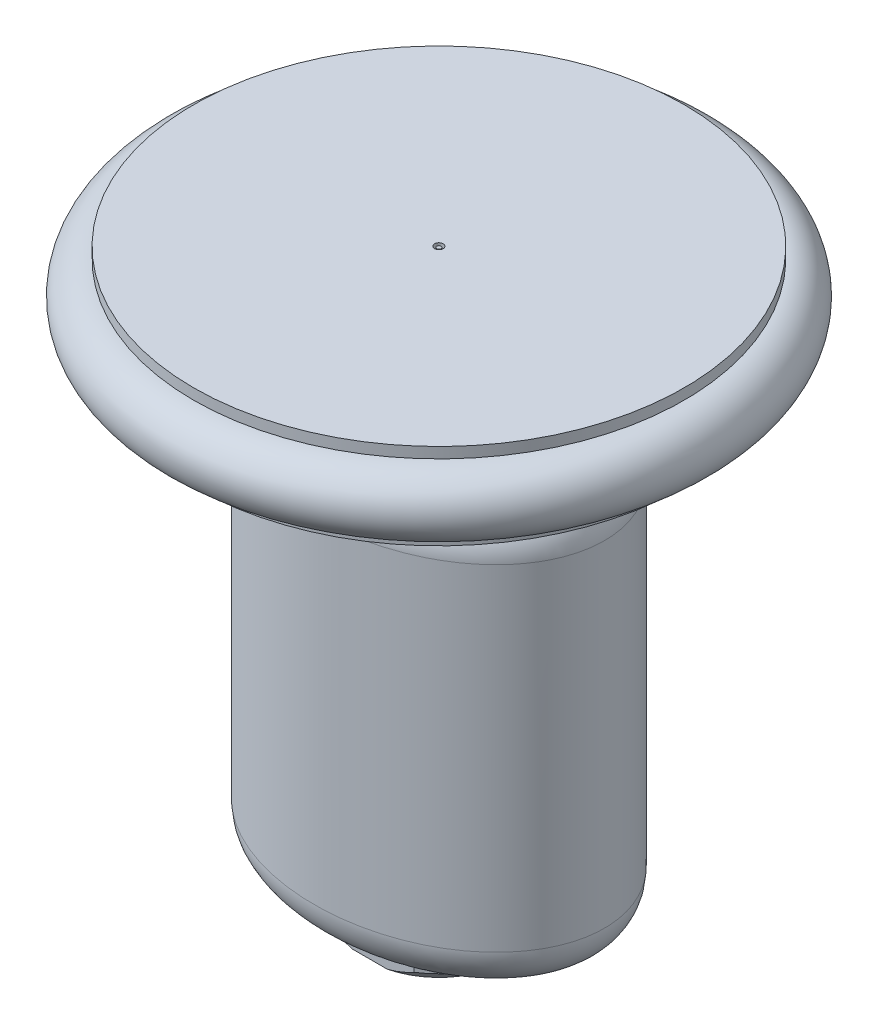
ISO-10303-21;
HEADER;
FILE_DESCRIPTION(('STEP AP214'),'2;1');
FILE_NAME('part.step','',(''),(''),'','','');
FILE_SCHEMA(('AUTOMOTIVE_DESIGN { 1 0 10303 214 1 1 1 1 }'));
ENDSEC;
DATA;
#1=APPLICATION_CONTEXT('core data for automotive mechanical design processes');
#2=APPLICATION_PROTOCOL_DEFINITION('international standard','automotive_design',2000,#1);
#3=PRODUCT_CONTEXT('',#1,'mechanical');
#4=PRODUCT('Part','Part','',(#3));
#5=PRODUCT_RELATED_PRODUCT_CATEGORY('part','',(#4));
#6=PRODUCT_DEFINITION_FORMATION('','',#4);
#7=PRODUCT_DEFINITION_CONTEXT('part definition',#1,'design');
#8=PRODUCT_DEFINITION('design','',#6,#7);
#9=PRODUCT_DEFINITION_SHAPE('','',#8);
#10=(LENGTH_UNIT() NAMED_UNIT(*) SI_UNIT(.MILLI.,.METRE.));
#11=(NAMED_UNIT(*) PLANE_ANGLE_UNIT() SI_UNIT($,.RADIAN.));
#12=(NAMED_UNIT(*) SI_UNIT($,.STERADIAN.) SOLID_ANGLE_UNIT());
#13=UNCERTAINTY_MEASURE_WITH_UNIT(LENGTH_MEASURE(1.E-05),#10,'distance_accuracy_value','');
#14=(GEOMETRIC_REPRESENTATION_CONTEXT(3) GLOBAL_UNCERTAINTY_ASSIGNED_CONTEXT((#13)) GLOBAL_UNIT_ASSIGNED_CONTEXT((#10,
#11,#12)) REPRESENTATION_CONTEXT('',''));
#15=CARTESIAN_POINT('',(0.,0.,0.));
#16=DIRECTION('',(0.,0.,1.));
#17=DIRECTION('',(1.,0.,0.));
#18=AXIS2_PLACEMENT_3D('',#15,#16,#17);
#19=CARTESIAN_POINT('',(0.,32.512,0.));
#20=DIRECTION('',(0.,-1.,0.));
#21=DIRECTION('',(0.,0.,-1.));
#22=AXIS2_PLACEMENT_3D('',#19,#20,#21);
#23=CYLINDRICAL_SURFACE('',#22,14.478);
#24=CARTESIAN_POINT('',(0.,32.512,0.));
#25=DIRECTION('',(0.,1.,0.));
#26=DIRECTION('',(0.,0.,1.));
#27=AXIS2_PLACEMENT_3D('',#24,#25,#26);
#28=CIRCLE('',#27,14.478);
#29=CARTESIAN_POINT('',(0.,32.512,14.478));
#30=VERTEX_POINT('',#29);
#31=EDGE_CURVE('E54',#30,#30,#28,.T.);
#32=ORIENTED_EDGE('',*,*,#31,.F.);
#33=EDGE_LOOP('',(#32));
#34=FACE_BOUND('',#33,.T.);
#35=CARTESIAN_POINT('',(0.,31.877,0.));
#36=DIRECTION('',(0.,-1.,0.));
#37=DIRECTION('',(0.,0.,-1.));
#38=AXIS2_PLACEMENT_3D('',#35,#36,#37);
#39=CIRCLE('',#38,14.478);
#40=CARTESIAN_POINT('',(0.,31.877,-14.478));
#41=VERTEX_POINT('',#40);
#42=EDGE_CURVE('E11',#41,#41,#39,.T.);
#43=ORIENTED_EDGE('',*,*,#42,.F.);
#44=EDGE_LOOP('',(#43));
#45=FACE_BOUND('',#44,.T.);
#46=ADVANCED_FACE('F43',(#34,#45),#23,.T.);
#47=CARTESIAN_POINT('',(0.,27.432,0.));
#48=DIRECTION('',(0.,1.,0.));
#49=DIRECTION('',(0.,0.,1.));
#50=AXIS2_PLACEMENT_3D('',#47,#48,#49);
#51=CIRCLE('',#50,14.478);
#52=CARTESIAN_POINT('',(0.,27.432,14.478));
#53=VERTEX_POINT('',#52);
#54=EDGE_CURVE('E59',#53,#53,#51,.T.);
#55=ORIENTED_EDGE('',*,*,#54,.T.);
#56=EDGE_LOOP('',(#55));
#57=FACE_BOUND('',#56,.T.);
#58=CARTESIAN_POINT('',(0.,28.067,0.));
#59=DIRECTION('',(0.,1.,0.));
#60=DIRECTION('',(0.,0.,1.));
#61=AXIS2_PLACEMENT_3D('',#58,#59,#60);
#62=CIRCLE('',#61,14.478);
#63=CARTESIAN_POINT('',(0.,28.067,14.478));
#64=VERTEX_POINT('',#63);
#65=EDGE_CURVE('E46',#64,#64,#62,.T.);
#66=ORIENTED_EDGE('',*,*,#65,.F.);
#67=EDGE_LOOP('',(#66));
#68=FACE_BOUND('',#67,.T.);
#69=ADVANCED_FACE('F67',(#57,#68),#23,.T.);
#70=CARTESIAN_POINT('',(0.,32.512,0.));
#71=DIRECTION('',(0.,1.,0.));
#72=DIRECTION('',(0.,0.,1.));
#73=AXIS2_PLACEMENT_3D('',#70,#71,#72);
#74=PLANE('',#73);
#75=ORIENTED_EDGE('',*,*,#31,.T.);
#76=EDGE_LOOP('',(#75));
#77=FACE_BOUND('',#76,.T.);
#78=CARTESIAN_POINT('',(0.,32.512,0.));
#79=DIRECTION('',(0.,1.,0.));
#80=DIRECTION('',(0.,0.,1.));
#81=AXIS2_PLACEMENT_3D('',#78,#79,#80);
#82=CIRCLE('',#81,0.254);
#83=CARTESIAN_POINT('',(0.,32.512,0.254));
#84=VERTEX_POINT('',#83);
#85=EDGE_CURVE('E56',#84,#84,#82,.T.);
#86=ORIENTED_EDGE('',*,*,#85,.F.);
#87=EDGE_LOOP('',(#86));
#88=FACE_BOUND('',#87,.T.);
#89=ADVANCED_FACE('F74',(#77,#88),#74,.T.);
#90=CARTESIAN_POINT('',(0.,27.432,0.));
#91=DIRECTION('',(0.,1.,0.));
#92=DIRECTION('',(0.,0.,1.));
#93=AXIS2_PLACEMENT_3D('',#90,#91,#92);
#94=PLANE('',#93);
#95=ORIENTED_EDGE('',*,*,#54,.F.);
#96=EDGE_LOOP('',(#95));
#97=FACE_BOUND('',#96,.T.);
#98=CARTESIAN_POINT('',(0.,27.432,0.));
#99=DIRECTION('',(0.,1.,0.));
#100=DIRECTION('',(0.,0.,1.));
#101=AXIS2_PLACEMENT_3D('',#98,#99,#100);
#102=CIRCLE('',#101,0.254);
#103=CARTESIAN_POINT('',(0.,27.432,0.254));
#104=VERTEX_POINT('',#103);
#105=EDGE_CURVE('E60',#104,#104,#102,.T.);
#106=ORIENTED_EDGE('',*,*,#105,.T.);
#107=EDGE_LOOP('',(#106));
#108=FACE_BOUND('',#107,.T.);
#109=ADVANCED_FACE('F70',(#97,#108),#94,.F.);
#110=CARTESIAN_POINT('',(0.,32.512,0.));
#111=DIRECTION('',(0.,-1.,0.));
#112=DIRECTION('',(0.,0.,-1.));
#113=AXIS2_PLACEMENT_3D('',#110,#111,#112);
#114=CYLINDRICAL_SURFACE('',#113,0.254);
#115=ORIENTED_EDGE('',*,*,#85,.T.);
#116=EDGE_LOOP('',(#115));
#117=FACE_BOUND('',#116,.T.);
#118=ORIENTED_EDGE('',*,*,#105,.F.);
#119=EDGE_LOOP('',(#118));
#120=FACE_BOUND('',#119,.T.);
#121=ADVANCED_FACE('F73',(#117,#120),#114,.F.);
#122=CARTESIAN_POINT('',(0.,29.972,0.));
#123=DIRECTION('',(0.,1.,0.));
#124=DIRECTION('',(0.,0.,1.));
#125=AXIS2_PLACEMENT_3D('',#122,#123,#124);
#126=TOROIDAL_SURFACE('',#125,14.478,1.905);
#127=ORIENTED_EDGE('',*,*,#42,.T.);
#128=EDGE_LOOP('',(#127));
#129=FACE_BOUND('',#128,.T.);
#130=ORIENTED_EDGE('',*,*,#65,.T.);
#131=EDGE_LOOP('',(#130));
#132=FACE_BOUND('',#131,.T.);
#133=ADVANCED_FACE('F78',(#129,#132),#126,.T.);
#134=CLOSED_SHELL('',(#46,#69,#89,#109,#121,#133));
#135=MANIFOLD_SOLID_BREP('B2',#134);
#136=CARTESIAN_POINT('',(0.,0.,0.));
#137=DIRECTION('',(0.,1.,0.));
#138=DIRECTION('',(0.,0.,1.));
#139=AXIS2_PLACEMENT_3D('',#136,#137,#138);
#140=PLANE('',#139);
#141=CARTESIAN_POINT('',(0.,0.,0.));
#142=DIRECTION('',(0.,-1.,0.));
#143=DIRECTION('',(0.,0.,-1.));
#144=AXIS2_PLACEMENT_3D('',#141,#142,#143);
#145=CIRCLE('',#144,4.826);
#146=CARTESIAN_POINT('',(-2.60272549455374,0.,4.064));
#147=VERTEX_POINT('',#146);
#148=CARTESIAN_POINT('',(0.,0.,-4.826));
#149=VERTEX_POINT('',#148);
#150=EDGE_CURVE('E180',#147,#149,#145,.T.);
#151=ORIENTED_EDGE('',*,*,#150,.F.);
#152=DIRECTION('',(1.,0.,0.));
#153=VECTOR('',#152,1.);
#154=CARTESIAN_POINT('',(0.,0.,4.064));
#155=LINE('',#154,#153);
#156=CARTESIAN_POINT('',(2.60272549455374,0.,4.064));
#157=VERTEX_POINT('',#156);
#158=EDGE_CURVE('E170',#147,#157,#155,.T.);
#159=ORIENTED_EDGE('',*,*,#158,.T.);
#160=EDGE_CURVE('E178',#149,#157,#145,.T.);
#161=ORIENTED_EDGE('',*,*,#160,.F.);
#162=CARTESIAN_POINT('',(-7.1438015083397,0.,-0.75556710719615));
#163=CARTESIAN_POINT('',(-9.60629000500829,0.,-1.37826318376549));
#164=CARTESIAN_POINT('',(-9.60629000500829,2.54,-1.37826318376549));
#165=CARTESIAN_POINT('',(-7.16821941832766,0.,-0.659002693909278));
#166=CARTESIAN_POINT('',(-9.6498958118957,0.,-1.20581049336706));
#167=CARTESIAN_POINT('',(-9.6498958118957,2.54,-1.20581049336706));
#168=CARTESIAN_POINT('',(-7.18816778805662,0.,-0.561299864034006));
#169=CARTESIAN_POINT('',(-9.68602017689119,0.,-1.02931037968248));
#170=CARTESIAN_POINT('',(-9.68602017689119,2.54,-1.02931037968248));
#171=CARTESIAN_POINT('',(-7.21853276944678,0.,-0.364415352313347));
#172=CARTESIAN_POINT('',(-9.7413164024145,0.,-0.670752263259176));
#173=CARTESIAN_POINT('',(-9.74131640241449,2.54,-0.670752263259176));
#174=CARTESIAN_POINT('',(-7.22894960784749,0.,-0.26523370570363));
#175=CARTESIAN_POINT('',(-9.76048866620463,0.,-0.488694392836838));
#176=CARTESIAN_POINT('',(-9.76048866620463,2.54,-0.488694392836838));
#177=CARTESIAN_POINT('',(-7.23991091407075,0.,-0.0663752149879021));
#178=CARTESIAN_POINT('',(-9.78066939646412,0.,-0.1225529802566));
#179=CARTESIAN_POINT('',(-9.78066939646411,2.54,-0.1225529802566));
#180=CARTESIAN_POINT('',(-7.2404605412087,0.,0.0333013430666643));
#181=CARTESIAN_POINT('',(-9.78168735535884,0.,0.0615294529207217));
#182=CARTESIAN_POINT('',(-9.78168735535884,2.54,0.0615294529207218));
#183=CARTESIAN_POINT('',(-7.23168054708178,0.,0.232211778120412));
#184=CARTESIAN_POINT('',(-9.76551281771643,0.,0.427982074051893));
#185=CARTESIAN_POINT('',(-9.76551281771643,2.54,0.427982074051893));
#186=CARTESIAN_POINT('',(-7.2223516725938,0.,0.331445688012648));
#187=CARTESIAN_POINT('',(-9.74832169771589,0.,0.610352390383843));
#188=CARTESIAN_POINT('',(-9.74832169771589,2.54,0.610352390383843));
#189=CARTESIAN_POINT('',(-7.19605474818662,0.,0.515065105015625));
#190=CARTESIAN_POINT('',(-9.70035389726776,0.,0.945321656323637));
#191=CARTESIAN_POINT('',(-9.70035389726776,2.54,0.945321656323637));
#192=CARTESIAN_POINT('',(-7.1803033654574,0.,0.59962834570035));
#193=CARTESIAN_POINT('',(-9.67175213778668,0.,1.09858622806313));
#194=CARTESIAN_POINT('',(-9.67175213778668,2.54,1.09858622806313));
#195=CARTESIAN_POINT('',(-7.14202745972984,0.,0.767191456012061));
#196=CARTESIAN_POINT('',(-9.60301830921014,0.,1.39949030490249));
#197=CARTESIAN_POINT('',(-9.60301830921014,2.54,1.39949030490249));
#198=CARTESIAN_POINT('',(-7.11950383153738,0.,0.850191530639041));
#199=CARTESIAN_POINT('',(-9.56288776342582,0.,1.54713055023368));
#200=CARTESIAN_POINT('',(-9.56288776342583,2.54,1.54713055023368));
#201=CARTESIAN_POINT('',(-7.06812169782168,0.,1.01424376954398));
#202=CARTESIAN_POINT('',(-9.47250623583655,0.,1.83570551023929));
#203=CARTESIAN_POINT('',(-9.47250623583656,2.54,1.83570551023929));
#204=CARTESIAN_POINT('',(-7.03926001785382,0.,1.09529493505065));
#205=CARTESIAN_POINT('',(-9.42225018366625,0.,1.97663682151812));
#206=CARTESIAN_POINT('',(-9.42225018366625,2.54,1.97663682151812));
#207=CARTESIAN_POINT('',(-6.97570950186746,0.,1.25508712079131));
#208=CARTESIAN_POINT('',(-9.3130894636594,0.,2.25111196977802));
#209=CARTESIAN_POINT('',(-9.3130894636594,2.54,2.25111196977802));
#210=CARTESIAN_POINT('',(-6.94101926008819,0.,1.33382757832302));
#211=CARTESIAN_POINT('',(-9.2541827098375,0.,2.38465401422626));
#212=CARTESIAN_POINT('',(-9.2541827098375,2.54,2.38465401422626));
#213=CARTESIAN_POINT('',(-6.85101066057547,0.,1.52051457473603));
#214=CARTESIAN_POINT('',(-9.10344065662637,0.,2.69731637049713));
#215=CARTESIAN_POINT('',(-9.10344065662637,2.54,2.69731637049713));
#216=CARTESIAN_POINT('',(-6.79306592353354,0.,1.6272006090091));
#217=CARTESIAN_POINT('',(-9.00800632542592,0.,2.87267765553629));
#218=CARTESIAN_POINT('',(-9.00800632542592,2.54,2.87267765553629));
#219=CARTESIAN_POINT('',(-6.66801045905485,0.,1.83505546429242));
#220=CARTESIAN_POINT('',(-8.80592669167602,0.,3.20855514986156));
#221=CARTESIAN_POINT('',(-8.80592669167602,2.54,3.20855514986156));
#222=CARTESIAN_POINT('',(-6.60089655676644,0.,1.93622235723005));
#223=CARTESIAN_POINT('',(-8.69927750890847,0.,3.36906618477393));
#224=CARTESIAN_POINT('',(-8.69927750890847,2.54,3.36906618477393));
#225=CARTESIAN_POINT('',(-6.45866477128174,0.,2.13297234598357));
#226=CARTESIAN_POINT('',(-8.47714019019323,0.,3.67634988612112));
#227=CARTESIAN_POINT('',(-8.47714019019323,2.54,3.67634988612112));
#228=CARTESIAN_POINT('',(-6.38353503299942,0.,2.22854683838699));
#229=CARTESIAN_POINT('',(-8.36163903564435,0.,3.82310158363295));
#230=CARTESIAN_POINT('',(-8.36163903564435,2.54,3.82310158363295));
#231=CARTESIAN_POINT('',(-6.22644190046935,0.,2.41391672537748));
#232=CARTESIAN_POINT('',(-8.12382914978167,0.,4.10371390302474));
#233=CARTESIAN_POINT('',(-8.12382914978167,2.54,4.10371390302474));
#234=CARTESIAN_POINT('',(-6.14447644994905,0.,2.50371036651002));
#235=CARTESIAN_POINT('',(-8.00151837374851,0.,4.23757061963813));
#236=CARTESIAN_POINT('',(-8.00151837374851,2.54,4.23757061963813));
#237=CARTESIAN_POINT('',(-5.93713481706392,0.,2.71596726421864));
#238=CARTESIAN_POINT('',(-7.69630028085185,0.,4.55003350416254));
#239=CARTESIAN_POINT('',(-7.69630028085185,2.54,4.55003350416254));
#240=CARTESIAN_POINT('',(-5.80858013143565,0.,2.83533457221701));
#241=CARTESIAN_POINT('',(-7.51049777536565,0.,4.72227842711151));
#242=CARTESIAN_POINT('',(-7.51049777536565,2.54,4.72227842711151));
#243=CARTESIAN_POINT('',(-5.5415696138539,0.,3.06243032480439));
#244=CARTESIAN_POINT('',(-7.13082245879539,0.,5.0451888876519));
#245=CARTESIAN_POINT('',(-7.13082245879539,2.54,5.0451888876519));
#246=CARTESIAN_POINT('',(-5.40310965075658,0.,3.17015386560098));
#247=CARTESIAN_POINT('',(-6.93694629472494,0.,5.19584534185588));
#248=CARTESIAN_POINT('',(-6.93694629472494,2.54,5.19584534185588));
#249=CARTESIAN_POINT('',(-5.11798135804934,0.,3.37446274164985));
#250=CARTESIAN_POINT('',(-6.54296998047,0.,5.47814809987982));
#251=CARTESIAN_POINT('',(-6.54296998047,2.54,5.47814809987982));
#252=CARTESIAN_POINT('',(-4.97130341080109,0.,3.47103460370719));
#253=CARTESIAN_POINT('',(-6.34286266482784,0.,5.60977145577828));
#254=CARTESIAN_POINT('',(-6.34286266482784,2.54,5.60977145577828));
#255=CARTESIAN_POINT('',(-4.6713437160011,0.,3.65333006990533));
#256=CARTESIAN_POINT('',(-5.9380534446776,0.,5.85578392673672));
#257=CARTESIAN_POINT('',(-5.9380534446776,2.54,5.85578392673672));
#258=CARTESIAN_POINT('',(-4.51806023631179,0.,3.73905080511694));
#259=CARTESIAN_POINT('',(-5.73335034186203,0.,5.97016848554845));
#260=CARTESIAN_POINT('',(-5.73335034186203,2.54,5.97016848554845));
#261=CARTESIAN_POINT('',(-4.14163927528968,0.,3.93330156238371));
#262=CARTESIAN_POINT('',(-5.23507908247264,0.,6.22730573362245));
#263=CARTESIAN_POINT('',(-5.23507908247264,2.54,6.22730573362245));
#264=CARTESIAN_POINT('',(-3.91580415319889,0.,4.03662489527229));
#265=CARTESIAN_POINT('',(-4.93973506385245,0.,6.3622562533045));
#266=CARTESIAN_POINT('',(-4.93973506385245,2.54,6.3622562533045));
#267=CARTESIAN_POINT('',(-3.45604119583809,0.,4.22339915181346));
#268=CARTESIAN_POINT('',(-4.344041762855,0.,6.60424397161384));
#269=CARTESIAN_POINT('',(-4.344041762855,2.54,6.60424397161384));
#270=CARTESIAN_POINT('',(-3.22211019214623,0.,4.30684219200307));
#271=CARTESIAN_POINT('',(-4.04369054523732,0.,6.71127009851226));
#272=CARTESIAN_POINT('',(-4.04369054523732,2.54,6.71127009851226));
#273=CARTESIAN_POINT('',(-2.74825834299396,0.,4.45465433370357));
#274=CARTESIAN_POINT('',(-3.43942412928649,0.,6.89976239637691));
#275=CARTESIAN_POINT('',(-3.43942412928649,2.54,6.89976239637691));
#276=CARTESIAN_POINT('',(-2.50833598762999,0.,4.51901857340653));
#277=CARTESIAN_POINT('',(-3.13550804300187,0.,6.98122205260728));
#278=CARTESIAN_POINT('',(-3.13550804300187,2.54,6.98122205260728));
#279=CARTESIAN_POINT('',(-2.02433372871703,0.,4.62925787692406));
#280=CARTESIAN_POINT('',(-2.52532832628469,0.,7.12019885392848));
#281=CARTESIAN_POINT('',(-2.52532832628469,2.54,7.12019885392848));
#282=CARTESIAN_POINT('',(-1.78025427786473,0.,4.67513494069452));
#283=CARTESIAN_POINT('',(-2.21906495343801,0.,7.17771858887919));
#284=CARTESIAN_POINT('',(-2.21906495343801,2.54,7.17771858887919));
#285=CARTESIAN_POINT('',(-1.28349635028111,0.,4.74973668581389));
#286=CARTESIAN_POINT('',(-1.597648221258,0.,7.27104093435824));
#287=CARTESIAN_POINT('',(-1.597648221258,2.54,7.27104093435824));
#288=CARTESIAN_POINT('',(-1.03075219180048,0.,4.77802263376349));
#289=CARTESIAN_POINT('',(-1.28245810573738,0.,7.30628837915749));
#290=CARTESIAN_POINT('',(-1.28245810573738,2.54,7.30628837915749));
#291=CARTESIAN_POINT('',(-0.523870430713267,0.,4.81595921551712));
#292=CARTESIAN_POINT('',(-0.651304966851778,0.,7.35352533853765));
#293=CARTESIAN_POINT('',(-0.651304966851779,2.54,7.35352533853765));
#294=CARTESIAN_POINT('',(-0.269732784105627,0.,4.82560925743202));
#295=CARTESIAN_POINT('',(-0.335341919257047,0.,7.36551411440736));
#296=CARTESIAN_POINT('',(-0.335341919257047,2.54,7.36551411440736));
#297=CARTESIAN_POINT('',(0.238931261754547,0.,4.82636803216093));
#298=CARTESIAN_POINT('',(0.29704830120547,0.,7.36645765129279));
#299=CARTESIAN_POINT('',(0.297048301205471,2.54,7.36645765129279));
#300=CARTESIAN_POINT('',(0.493457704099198,0.,4.81745061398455));
#301=CARTESIAN_POINT('',(0.613475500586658,0.,7.35537992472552));
#302=CARTESIAN_POINT('',(0.613475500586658,2.54,7.35537992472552));
#303=CARTESIAN_POINT('',(1.00116852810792,0.,4.78093397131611));
#304=CARTESIAN_POINT('',(1.24558636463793,0.,7.30991561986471));
#305=CARTESIAN_POINT('',(1.24558636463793,2.54,7.30991561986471));
#306=CARTESIAN_POINT('',(1.25435289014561,0.,4.75333447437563));
#307=CARTESIAN_POINT('',(1.56127001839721,0.,7.27552870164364));
#308=CARTESIAN_POINT('',(1.56127001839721,2.54,7.27552870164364));
#309=CARTESIAN_POINT('',(1.79545117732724,0.,4.6736574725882));
#310=CARTESIAN_POINT('',(2.23799423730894,0.,7.1758838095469));
#311=CARTESIAN_POINT('',(2.23799423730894,2.54,7.1758838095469));
#312=CARTESIAN_POINT('',(2.08292634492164,0.,4.61854847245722));
#313=CARTESIAN_POINT('',(2.59879344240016,0.,7.10679326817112));
#314=CARTESIAN_POINT('',(2.59879344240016,2.54,7.10679326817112));
#315=CARTESIAN_POINT('',(2.651877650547,0.,4.48255204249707));
#316=CARTESIAN_POINT('',(3.3170448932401,0.,6.93511263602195));
#317=CARTESIAN_POINT('',(3.3170448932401,2.54,6.93511263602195));
#318=CARTESIAN_POINT('',(2.93335135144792,0.,4.40165434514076));
#319=CARTESIAN_POINT('',(3.67449574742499,0.,6.83250920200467));
#320=CARTESIAN_POINT('',(3.67449574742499,2.54,6.83250920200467));
#321=CARTESIAN_POINT('',(3.48645434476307,0.,4.21326174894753));
#322=CARTESIAN_POINT('',(4.38302487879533,0.,6.59117906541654));
#323=CARTESIAN_POINT('',(4.38302487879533,2.54,6.59117906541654));
#324=CARTESIAN_POINT('',(3.75810824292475,0.,4.10583950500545));
#325=CARTESIAN_POINT('',(4.73411779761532,0.,6.45255098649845));
#326=CARTESIAN_POINT('',(4.73411779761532,2.54,6.45255098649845));
#327=CARTESIAN_POINT('',(4.28844638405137,0.,3.86289660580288));
#328=CARTESIAN_POINT('',(5.42802606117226,0.,6.13470026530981));
#329=CARTESIAN_POINT('',(5.42802606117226,2.54,6.13470026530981));
#330=CARTESIAN_POINT('',(4.54714359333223,0.,3.72740476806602));
#331=CARTESIAN_POINT('',(5.77084949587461,0.,5.95551923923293));
#332=CARTESIAN_POINT('',(5.77084949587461,2.54,5.95551923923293));
#333=CARTESIAN_POINT('',(4.92434612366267,0.,3.50019039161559));
#334=CARTESIAN_POINT('',(6.27931142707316,0.,5.64921852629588));
#335=CARTESIAN_POINT('',(6.27931142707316,2.54,5.64921852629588));
#336=CARTESIAN_POINT('',(5.04954595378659,0.,3.41946312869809));
#337=CARTESIAN_POINT('',(6.44961793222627,0.,5.53948612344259));
#338=CARTESIAN_POINT('',(6.44961793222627,2.54,5.53948612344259));
#339=CARTESIAN_POINT('',(5.29435622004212,0.,3.24995740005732));
#340=CARTESIAN_POINT('',(6.78611522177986,0.,5.30650160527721));
#341=CARTESIAN_POINT('',(6.78611522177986,2.54,5.30650160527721));
#342=CARTESIAN_POINT('',(5.4139683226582,0.,3.16118135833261));
#343=CARTESIAN_POINT('',(6.95230722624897,0.,5.1832535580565));
#344=CARTESIAN_POINT('',(6.95230722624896,2.54,5.1832535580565));
#345=CARTESIAN_POINT('',(5.6464611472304,0.,2.97539981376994));
#346=CARTESIAN_POINT('',(7.27931994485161,0.,4.92194262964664));
#347=CARTESIAN_POINT('',(7.27931994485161,2.54,4.92194262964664));
#348=CARTESIAN_POINT('',(5.75934791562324,0.,2.87840189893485));
#349=CARTESIAN_POINT('',(7.44014542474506,0.,4.78389337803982));
#350=CARTESIAN_POINT('',(7.44014542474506,2.54,4.78389337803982));
#351=CARTESIAN_POINT('',(5.97721616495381,0.,2.67588622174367));
#352=CARTESIAN_POINT('',(7.75501328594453,0.,4.49121765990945));
#353=CARTESIAN_POINT('',(7.75501328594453,2.54,4.49121765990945));
#354=CARTESIAN_POINT('',(6.08219929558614,0.,2.57037024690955));
#355=CARTESIAN_POINT('',(7.90905707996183,0.,4.33659466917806));
#356=CARTESIAN_POINT('',(7.90905707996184,2.54,4.33659466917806));
#357=CARTESIAN_POINT('',(6.26019424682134,0.,2.37533080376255));
#358=CARTESIAN_POINT('',(8.17458728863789,0.,4.04563308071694));
#359=CARTESIAN_POINT('',(8.17458728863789,2.54,4.04563308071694));
#360=CARTESIAN_POINT('',(6.33509502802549,0.,2.28752971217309));
#361=CARTESIAN_POINT('',(8.28786851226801,0.,3.91297397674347));
#362=CARTESIAN_POINT('',(8.28786851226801,2.54,3.91297397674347));
#363=CARTESIAN_POINT('',(6.47831656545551,0.,2.1067228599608));
#364=CARTESIAN_POINT('',(8.50759289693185,0.,3.63558981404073));
#365=CARTESIAN_POINT('',(8.50759289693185,2.54,3.63558981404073));
#366=CARTESIAN_POINT('',(6.54663893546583,0.,2.01371838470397));
#367=CARTESIAN_POINT('',(8.61403773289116,0.,3.49086773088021));
#368=CARTESIAN_POINT('',(8.61403773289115,2.54,3.49086773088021));
#369=CARTESIAN_POINT('',(6.67568409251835,0.,1.82262782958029));
#370=CARTESIAN_POINT('',(8.81821432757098,0.,3.18852219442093));
#371=CARTESIAN_POINT('',(8.81821432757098,2.54,3.18852219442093));
#372=CARTESIAN_POINT('',(6.73641075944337,0.,1.72454438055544));
#373=CARTESIAN_POINT('',(8.91595052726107,0.,3.03090539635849));
#374=CARTESIAN_POINT('',(8.91595052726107,2.54,3.03090539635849));
#375=CARTESIAN_POINT('',(6.84916369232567,0.,1.52349598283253));
#376=CARTESIAN_POINT('',(9.10036393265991,0.,2.7020782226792));
#377=CARTESIAN_POINT('',(9.10036393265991,2.54,2.7020782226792));
#378=CARTESIAN_POINT('',(6.90119247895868,0.,1.4205324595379));
#379=CARTESIAN_POINT('',(9.18704434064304,0.,2.53087180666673));
#380=CARTESIAN_POINT('',(9.18704434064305,2.54,2.53087180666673));
#381=CARTESIAN_POINT('',(6.98535773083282,0.,1.23245716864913));
#382=CARTESIAN_POINT('',(9.32948299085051,0.,2.21257239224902));
#383=CARTESIAN_POINT('',(9.32948299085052,2.54,2.21257239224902));
#384=CARTESIAN_POINT('',(7.01937330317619,0.,1.14818463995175));
#385=CARTESIAN_POINT('',(9.38790182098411,0.,2.06805494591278));
#386=CARTESIAN_POINT('',(9.38790182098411,2.54,2.06805494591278));
#387=CARTESIAN_POINT('',(7.08063510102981,0.,0.977221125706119));
#388=CARTESIAN_POINT('',(9.49433338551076,0.,1.77103305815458));
#389=CARTESIAN_POINT('',(9.49433338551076,2.54,1.77103305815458));
#390=CARTESIAN_POINT('',(7.10788306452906,0.,0.890530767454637));
#391=CARTESIAN_POINT('',(9.54234879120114,0.,1.61853067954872));
#392=CARTESIAN_POINT('',(9.54234879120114,2.54,1.61853067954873));
#393=CARTESIAN_POINT('',(7.15498710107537,0.,0.715391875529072));
#394=CARTESIAN_POINT('',(9.62614658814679,0.,1.3069529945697));
#395=CARTESIAN_POINT('',(9.62614658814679,2.54,1.3069529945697));
#396=CARTESIAN_POINT('',(7.17486154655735,0.,0.626948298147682));
#397=CARTESIAN_POINT('',(9.66195936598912,0.,1.14789513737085));
#398=CARTESIAN_POINT('',(9.66195936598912,2.54,1.14789513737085));
#399=CARTESIAN_POINT('',(7.20683085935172,0.,0.448698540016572));
#400=CARTESIAN_POINT('',(9.71993022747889,0.,0.824650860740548));
#401=CARTESIAN_POINT('',(9.71993022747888,2.54,0.824650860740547));
#402=CARTESIAN_POINT('',(7.21893038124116,0.,0.358893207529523));
#403=CARTESIAN_POINT('',(9.7420964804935,0.,0.660467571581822));
#404=CARTESIAN_POINT('',(9.74209648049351,2.54,0.660467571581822));
#405=CARTESIAN_POINT('',(7.23098578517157,0.,0.22407635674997));
#406=CARTESIAN_POINT('',(9.7642363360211,0.,0.412903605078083));
#407=CARTESIAN_POINT('',(9.7642363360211,2.54,0.412903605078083));
#408=CARTESIAN_POINT('',(7.23398856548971,0.,0.179319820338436));
#409=CARTESIAN_POINT('',(9.7697643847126,0.,0.330538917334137));
#410=CARTESIAN_POINT('',(9.7697643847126,2.54,0.330538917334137));
#411=CARTESIAN_POINT('',(7.237996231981,0.,0.0897110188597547));
#412=CARTESIAN_POINT('',(9.77714785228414,0.,0.165453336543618));
#413=CARTESIAN_POINT('',(9.77714785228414,2.54,0.165453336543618));
#414=CARTESIAN_POINT('',(7.23900082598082,0.,0.0448587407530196));
#415=CARTESIAN_POINT('',(9.77900273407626,0.,0.0827323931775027));
#416=CARTESIAN_POINT('',(9.77900273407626,2.54,0.0827323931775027));
#417=CARTESIAN_POINT('',(7.23899830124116,0.,-0.0922590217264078));
#418=CARTESIAN_POINT('',(9.77899437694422,0.,-0.170152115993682));
#419=CARTESIAN_POINT('',(9.77899437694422,2.54,-0.170152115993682));
#420=CARTESIAN_POINT('',(7.23474384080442,0.,-0.184545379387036));
#421=CARTESIAN_POINT('',(9.77113134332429,0.,-0.340352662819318));
#422=CARTESIAN_POINT('',(9.77113134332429,2.54,-0.340352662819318));
#423=CARTESIAN_POINT('',(7.21783884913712,0.,-0.368384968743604));
#424=CARTESIAN_POINT('',(9.74009914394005,0.,-0.677854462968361));
#425=CARTESIAN_POINT('',(9.74009914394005,2.54,-0.67785446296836));
#426=CARTESIAN_POINT('',(7.20518299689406,0.,-0.459937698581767));
#427=CARTESIAN_POINT('',(9.71692027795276,0.,-0.84515380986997));
#428=CARTESIAN_POINT('',(9.71692027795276,2.54,-0.845153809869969));
#429=CARTESIAN_POINT('',(7.17177742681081,0.,-0.641771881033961));
#430=CARTESIAN_POINT('',(9.65639160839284,0.,-1.17463643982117));
#431=CARTESIAN_POINT('',(9.65639160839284,2.54,-1.17463643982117));
#432=CARTESIAN_POINT('',(7.15100874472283,0.,-0.732049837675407));
#433=CARTESIAN_POINT('',(9.61900860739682,0.,-1.33680676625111));
#434=CARTESIAN_POINT('',(9.61900860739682,2.54,-1.33680676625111));
#435=CARTESIAN_POINT('',(7.10189607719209,0.,-0.91049542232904));
#436=CARTESIAN_POINT('',(9.53177186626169,0.,-1.65377933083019));
#437=CARTESIAN_POINT('',(9.53177186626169,2.54,-1.65377933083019));
#438=CARTESIAN_POINT('',(7.07355299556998,0.,-0.998663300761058));
#439=CARTESIAN_POINT('',(9.4819196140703,0.,-1.80858244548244));
#440=CARTESIAN_POINT('',(9.4819196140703,2.54,-1.80858244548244));
#441=CARTESIAN_POINT('',(7.01017654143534,0.,-1.17168006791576));
#442=CARTESIAN_POINT('',(9.37206544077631,0.,-2.1084900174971));
#443=CARTESIAN_POINT('',(9.37206544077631,2.54,-2.1084900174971));
#444=CARTESIAN_POINT('',(6.9752036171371,0.,-1.25655118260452));
#445=CARTESIAN_POINT('',(9.31215574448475,0.,-2.25366723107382));
#446=CARTESIAN_POINT('',(9.31215574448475,2.54,-2.25366723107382));
#447=CARTESIAN_POINT('',(6.89903366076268,0.,-1.42346579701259));
#448=CARTESIAN_POINT('',(9.18358291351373,0.,-2.53540759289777));
#449=CARTESIAN_POINT('',(9.18358291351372,2.54,-2.53540759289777));
#450=CARTESIAN_POINT('',(6.85783417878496,0.,-1.50550816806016));
#451=CARTESIAN_POINT('',(9.11491633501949,0.,-2.67196732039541));
#452=CARTESIAN_POINT('',(9.11491633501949,2.54,-2.67196732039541));
#453=CARTESIAN_POINT('',(6.72586777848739,0.,-1.7469465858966));
#454=CARTESIAN_POINT('',(8.89818324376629,0.,-3.06853071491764));
#455=CARTESIAN_POINT('',(8.89818324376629,2.54,-3.06853071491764));
#456=CARTESIAN_POINT('',(6.62667543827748,0.,-1.90180583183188));
#457=CARTESIAN_POINT('',(8.73928195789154,0.,-3.31568074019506));
#458=CARTESIAN_POINT('',(8.73928195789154,2.54,-3.31568074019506));
#459=CARTESIAN_POINT('',(6.43121106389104,0.,-2.16981913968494));
#460=CARTESIAN_POINT('',(8.43449817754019,0.,-3.73356339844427));
#461=CARTESIAN_POINT('',(8.43449817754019,2.54,-3.73356339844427));
#462=CARTESIAN_POINT('',(6.33802085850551,0.,-2.28527896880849));
#463=CARTESIAN_POINT('',(8.29195457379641,0.,-3.90986461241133));
#464=CARTESIAN_POINT('',(8.29195457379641,2.54,-3.90986461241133));
#465=CARTESIAN_POINT('',(6.14184508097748,0.,-2.50764328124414));
#466=CARTESIAN_POINT('',(7.99734044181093,0.,-4.24380905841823));
#467=CARTESIAN_POINT('',(7.99734044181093,2.54,-4.24380905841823));
#468=CARTESIAN_POINT('',(6.03885475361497,0.,-2.61454356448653));
#469=CARTESIAN_POINT('',(7.84526530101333,0.,-4.40144314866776));
#470=CARTESIAN_POINT('',(7.84526530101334,2.54,-4.40144314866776));
#471=CARTESIAN_POINT('',(5.8245289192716,0.,-2.82003172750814));
#472=CARTESIAN_POINT('',(7.53370435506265,0.,-4.70015480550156));
#473=CARTESIAN_POINT('',(7.53370435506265,2.54,-4.70015480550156));
#474=CARTESIAN_POINT('',(5.71317656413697,0.,-2.91860192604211));
#475=CARTESIAN_POINT('',(7.37420384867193,0.,-4.84119739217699));
#476=CARTESIAN_POINT('',(7.37420384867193,2.54,-4.84119739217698));
#477=CARTESIAN_POINT('',(5.4836146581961,0.,-3.10742937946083));
#478=CARTESIAN_POINT('',(7.04969795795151,0.,-5.10811790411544));
#479=CARTESIAN_POINT('',(7.0496979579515,2.54,-5.10811790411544));
#480=CARTESIAN_POINT('',(5.36540306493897,0.,-3.1976841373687));
#481=CARTESIAN_POINT('',(6.88469094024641,0.,-5.23399127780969));
#482=CARTESIAN_POINT('',(6.88469094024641,2.54,-5.23399127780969));
#483=CARTESIAN_POINT('',(5.06902442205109,0.,-3.40871156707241));
#484=CARTESIAN_POINT('',(6.47557419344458,0.,-5.5252983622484));
#485=CARTESIAN_POINT('',(6.47557419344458,2.54,-5.5252983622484));
#486=CARTESIAN_POINT('',(4.88770116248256,0.,-3.52506555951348));
#487=CARTESIAN_POINT('',(6.22911155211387,0.,-5.68322640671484));
#488=CARTESIAN_POINT('',(6.22911155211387,2.54,-5.68322640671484));
#489=CARTESIAN_POINT('',(4.51564711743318,0.,-3.74162944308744));
#490=CARTESIAN_POINT('',(5.7297557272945,0.,-5.97388117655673));
#491=CARTESIAN_POINT('',(5.7297557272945,2.54,-5.97388117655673));
#492=CARTESIAN_POINT('',(4.32491238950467,0.,-3.84183249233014));
#493=CARTESIAN_POINT('',(5.47685987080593,0.,-6.10659722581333));
#494=CARTESIAN_POINT('',(5.47685987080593,2.54,-6.10659722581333));
#495=CARTESIAN_POINT('',(3.93594977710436,0.,-4.02685971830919));
#496=CARTESIAN_POINT('',(4.96616849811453,0.,-6.34952898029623));
#497=CARTESIAN_POINT('',(4.96616849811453,2.54,-6.34952898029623));
#498=CARTESIAN_POINT('',(3.73771555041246,0.,-4.11167051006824));
#499=CARTESIAN_POINT('',(4.70836893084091,0.,-6.45972511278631));
#500=CARTESIAN_POINT('',(4.70836893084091,2.54,-6.45972511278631));
#501=CARTESIAN_POINT('',(3.33557121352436,0.,-4.26641920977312));
#502=CARTESIAN_POINT('',(4.18933338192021,0.,-6.65945181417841));
#503=CARTESIAN_POINT('',(4.18933338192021,2.54,-6.65945181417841));
#504=CARTESIAN_POINT('',(3.13166124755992,0.,-4.33635749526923));
#505=CARTESIAN_POINT('',(3.9280974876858,0.,-6.74898290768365));
#506=CARTESIAN_POINT('',(3.9280974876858,2.54,-6.74898290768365));
#507=CARTESIAN_POINT('',(2.65697430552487,0.,-4.48092584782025));
#508=CARTESIAN_POINT('',(3.32344146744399,0.,-6.93313734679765));
#509=CARTESIAN_POINT('',(3.32344146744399,2.54,-6.93313734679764));
#510=CARTESIAN_POINT('',(2.38466528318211,0.,-4.55055131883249));
#511=CARTESIAN_POINT('',(2.97911391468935,0.,-7.02107704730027));
#512=CARTESIAN_POINT('',(2.97911391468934,2.54,-7.02107704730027));
#513=CARTESIAN_POINT('',(1.83507282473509,0.,-4.6663087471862));
#514=CARTESIAN_POINT('',(2.28760309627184,0.,-7.16672208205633));
#515=CARTESIAN_POINT('',(2.28760309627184,2.54,-7.16672208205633));
#516=CARTESIAN_POINT('',(1.55778795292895,0.,-4.71243380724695));
#517=CARTESIAN_POINT('',(1.94041902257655,0.,-7.22441854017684));
#518=CARTESIAN_POINT('',(1.94041902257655,2.54,-7.22441854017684));
#519=CARTESIAN_POINT('',(1.0001111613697,0.,-4.78176370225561));
#520=CARTESIAN_POINT('',(1.24413812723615,0.,-7.310979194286));
#521=CARTESIAN_POINT('',(1.24413812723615,2.54,-7.310979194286));
#522=CARTESIAN_POINT('',(0.719716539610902,0.,-4.80494671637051));
#523=CARTESIAN_POINT('',(0.895039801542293,0.,-7.33981594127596));
#524=CARTESIAN_POINT('',(0.895039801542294,2.54,-7.33981594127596));
#525=CARTESIAN_POINT('',(0.158009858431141,0.,-4.82859338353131));
#526=CARTESIAN_POINT('',(0.196361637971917,0.,-7.36922836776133));
#527=CARTESIAN_POINT('',(0.196361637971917,2.54,-7.36922836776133));
#528=CARTESIAN_POINT('',(-0.123302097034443,0.,-4.82905952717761));
#529=CARTESIAN_POINT('',(-0.153218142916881,0.,-7.36980714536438));
#530=CARTESIAN_POINT('',(-0.153218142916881,2.54,-7.36980714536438));
#531=CARTESIAN_POINT('',(-0.687623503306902,0.,-4.8071856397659));
#532=CARTESIAN_POINT('',(-0.855096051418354,0.,-7.34260174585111));
#533=CARTESIAN_POINT('',(-0.855096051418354,2.54,-7.3426017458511));
#534=CARTESIAN_POINT('',(-0.970624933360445,0.,-4.78463688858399));
#535=CARTESIAN_POINT('',(-1.20738978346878,0.,-7.31455799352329));
#536=CARTESIAN_POINT('',(-1.20738978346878,2.54,-7.31455799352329));
#537=CARTESIAN_POINT('',(-1.5338506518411,0.,-4.71613015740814));
#538=CARTESIAN_POINT('',(-1.91047203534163,0.,-7.22904132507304));
#539=CARTESIAN_POINT('',(-1.91047203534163,2.54,-7.22904132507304));
#540=CARTESIAN_POINT('',(-1.81407445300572,0.,-4.67016814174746));
#541=CARTESIAN_POINT('',(-2.26126028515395,0.,-7.17156333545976));
#542=CARTESIAN_POINT('',(-2.26126028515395,2.54,-7.17156333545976));
#543=CARTESIAN_POINT('',(-2.3691557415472,0.,-4.55434509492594));
#544=CARTESIAN_POINT('',(-2.95952654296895,0.,-7.02586416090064));
#545=CARTESIAN_POINT('',(-2.95952654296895,2.54,-7.02586416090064));
#546=CARTESIAN_POINT('',(-2.64402012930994,0.,-4.48451728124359));
#547=CARTESIAN_POINT('',(-3.30700846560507,0.,-6.9376857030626));
#548=CARTESIAN_POINT('',(-3.30700846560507,2.54,-6.9376857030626));
#549=CARTESIAN_POINT('',(-3.18619135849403,0.,-4.32009039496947));
#550=CARTESIAN_POINT('',(-3.99749254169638,0.,-6.72828704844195));
#551=CARTESIAN_POINT('',(-3.99749254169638,2.54,-6.72828704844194));
#552=CARTESIAN_POINT('',(-3.45350190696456,0.,-4.22550371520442));
#553=CARTESIAN_POINT('',(-4.34049684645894,0.,-6.60708338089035));
#554=CARTESIAN_POINT('',(-4.34049684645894,2.54,-6.60708338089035));
#555=CARTESIAN_POINT('',(-3.8859472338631,0.,-4.04795026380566));
#556=CARTESIAN_POINT('',(-4.90124169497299,0.,-6.37684528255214));
#557=CARTESIAN_POINT('',(-4.90124169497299,2.54,-6.37684528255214));
#558=CARTESIAN_POINT('',(-4.05417387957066,0.,-3.97245455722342));
#559=CARTESIAN_POINT('',(-5.12090914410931,0.,-6.27833405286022));
#560=CARTESIAN_POINT('',(-5.12090914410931,2.54,-6.27833405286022));
#561=CARTESIAN_POINT('',(-4.38502110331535,0.,-3.81006399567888));
#562=CARTESIAN_POINT('',(-5.55661425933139,0.,-6.0644789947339));
#563=CARTESIAN_POINT('',(-5.55661425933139,2.54,-6.0644789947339));
#564=CARTESIAN_POINT('',(-4.54764304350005,0.,-3.72317193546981));
#565=CARTESIAN_POINT('',(-5.77265280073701,0.,-5.94913929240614));
#566=CARTESIAN_POINT('',(-5.77265280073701,2.54,-5.94913929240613));
#567=CARTESIAN_POINT('',(-4.8658267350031,0.,-3.53762631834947));
#568=CARTESIAN_POINT('',(-6.19980056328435,0.,-5.70005308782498));
#569=CARTESIAN_POINT('',(-6.19980056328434,2.54,-5.70005308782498));
#570=CARTESIAN_POINT('',(-5.02139571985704,0.,-3.43898520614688));
#571=CARTESIAN_POINT('',(-6.41091472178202,0.,-5.56632603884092));
#572=CARTESIAN_POINT('',(-6.41091472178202,2.54,-5.56632603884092));
#573=CARTESIAN_POINT('',(-5.32401071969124,0.,-3.22939362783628));
#574=CARTESIAN_POINT('',(-6.82688611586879,0.,-5.27822983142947));
#575=CARTESIAN_POINT('',(-6.82688611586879,2.54,-5.27822983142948));
#576=CARTESIAN_POINT('',(-5.47105938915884,0.,-3.11844702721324));
#577=CARTESIAN_POINT('',(-7.0317452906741,0.,-5.12386715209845));
#578=CARTESIAN_POINT('',(-7.0317452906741,2.54,-5.12386715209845));
#579=CARTESIAN_POINT('',(-5.71424008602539,0.,-2.91717003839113));
#580=CARTESIAN_POINT('',(-7.37587246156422,0.,-4.83903217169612));
#581=CARTESIAN_POINT('',(-7.37587246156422,2.54,-4.83903217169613));
#582=CARTESIAN_POINT('',(-5.81295613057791,0.,-2.82995387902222));
#583=CARTESIAN_POINT('',(-7.51722039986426,0.,-4.71425645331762));
#584=CARTESIAN_POINT('',(-7.51722039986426,2.54,-4.71425645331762));
#585=CARTESIAN_POINT('',(-6.00404231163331,0.,-2.64883764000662));
#586=CARTESIAN_POINT('',(-7.79439456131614,0.,-4.45154678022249));
#587=CARTESIAN_POINT('',(-7.79439456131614,2.54,-4.45154678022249));
#588=CARTESIAN_POINT('',(-6.09641405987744,0.,-2.55493927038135));
#589=CARTESIAN_POINT('',(-7.93022218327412,0.,-4.31361618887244));
#590=CARTESIAN_POINT('',(-7.93022218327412,2.54,-4.31361618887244));
#591=CARTESIAN_POINT('',(-6.2736527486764,0.,-2.36043433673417));
#592=CARTESIAN_POINT('',(-8.19470594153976,0.,-4.02336763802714));
#593=CARTESIAN_POINT('',(-8.19470594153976,2.54,-4.02336763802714));
#594=CARTESIAN_POINT('',(-6.35852615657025,0.,-2.2598336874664));
#595=CARTESIAN_POINT('',(-8.32336822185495,0.,-3.87106231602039));
#596=CARTESIAN_POINT('',(-8.32336822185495,2.54,-3.87106231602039));
#597=CARTESIAN_POINT('',(-6.51953994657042,0.,-2.0518630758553));
#598=CARTESIAN_POINT('',(-8.571504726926,0.,-3.55056415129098));
#599=CARTESIAN_POINT('',(-8.571504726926,2.54,-3.55056415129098));
#600=CARTESIAN_POINT('',(-6.59568278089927,0.,-1.94449502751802));
#601=CARTESIAN_POINT('',(-8.69098152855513,0.,-3.38237579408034));
#602=CARTESIAN_POINT('',(-8.69098152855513,2.54,-3.38237579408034));
#603=CARTESIAN_POINT('',(-6.72002040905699,0.,-1.75073510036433));
#604=CARTESIAN_POINT('',(-8.88957850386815,0.,-3.0728876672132));
#605=CARTESIAN_POINT('',(-8.88957850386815,2.54,-3.0728876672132));
#606=CARTESIAN_POINT('',(-6.7704534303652,0.,-1.66577676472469));
#607=CARTESIAN_POINT('',(-8.97133998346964,0.,-2.93531993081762));
#608=CARTESIAN_POINT('',(-8.97133998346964,2.54,-2.93531993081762));
#609=CARTESIAN_POINT('',(-6.86480216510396,0.,-1.49232451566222));
#610=CARTESIAN_POINT('',(-9.12643437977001,0.,-2.65019277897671));
#611=CARTESIAN_POINT('',(-9.12643437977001,2.54,-2.65019277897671));
#612=CARTESIAN_POINT('',(-6.90871965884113,0.,-1.40383157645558));
#613=CARTESIAN_POINT('',(-9.19976959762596,0.,-2.50263610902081));
#614=CARTESIAN_POINT('',(-9.19976959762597,2.54,-2.50263610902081));
#615=CARTESIAN_POINT('',(-6.98924719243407,0.,-1.22364436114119));
#616=CARTESIAN_POINT('',(-9.33607918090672,0.,-2.19762810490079));
#617=CARTESIAN_POINT('',(-9.33607918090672,2.54,-2.19762810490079));
#618=CARTESIAN_POINT('',(-7.02586260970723,0.,-1.13195249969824));
#619=CARTESIAN_POINT('',(-9.3990611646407,0.,-2.04018416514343));
#620=CARTESIAN_POINT('',(-9.3990611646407,2.54,-2.04018416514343));
#621=CARTESIAN_POINT('',(-7.09104740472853,0.,-0.945735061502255));
#622=CARTESIAN_POINT('',(-9.51257188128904,0.,-1.71590473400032));
#623=CARTESIAN_POINT('',(-9.51257188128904,2.54,-1.71590473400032));
#624=CARTESIAN_POINT('',(-7.11961675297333,0.,-0.851209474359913));
#625=CARTESIAN_POINT('',(-9.56310056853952,0.,-1.54906920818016));
#626=CARTESIAN_POINT('',(-9.56310056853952,2.54,-1.54906920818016));
#627=CARTESIAN_POINT('',(-7.1438015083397,0.,-0.75556710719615));
#628=CARTESIAN_POINT('',(-9.60629000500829,0.,-1.37826318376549));
#629=CARTESIAN_POINT('',(-9.60629000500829,2.54,-1.37826318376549));
#630=(BOUNDED_SURFACE() B_SPLINE_SURFACE(3,2,((#162,#163,#164),(#165,#166,#167),(#168,#169,
#170),(#171,#172,#173),(#174,#175,#176),(#177,#178,#179),(#180,#181,#182),(#183,#184,#185),
(#186,#187,#188),(#189,#190,#191),(#192,#193,#194),(#195,#196,#197),(#198,#199,#200),(#201,#202,
#203),(#204,#205,#206),(#207,#208,#209),(#210,#211,#212),(#213,#214,#215),(#216,#217,#218),
(#219,#220,#221),(#222,#223,#224),(#225,#226,#227),(#228,#229,#230),(#231,#232,#233),(#234,#235,
#236),(#237,#238,#239),(#240,#241,#242),(#243,#244,#245),(#246,#247,#248),(#249,#250,#251),
(#252,#253,#254),(#255,#256,#257),(#258,#259,#260),(#261,#262,#263),(#264,#265,#266),(#267,#268,
#269),(#270,#271,#272),(#273,#274,#275),(#276,#277,#278),(#279,#280,#281),(#282,#283,#284),
(#285,#286,#287),(#288,#289,#290),(#291,#292,#293),(#294,#295,#296),(#297,#298,#299),(#300,#301,
#302),(#303,#304,#305),(#306,#307,#308),(#309,#310,#311),(#312,#313,#314),(#315,#316,#317),
(#318,#319,#320),(#321,#322,#323),(#324,#325,#326),(#327,#328,#329),(#330,#331,#332),(#333,#334,
#335),(#336,#337,#338),(#339,#340,#341),(#342,#343,#344),(#345,#346,#347),(#348,#349,#350),
(#351,#352,#353),(#354,#355,#356),(#357,#358,#359),(#360,#361,#362),(#363,#364,#365),(#366,#367,
#368),(#369,#370,#371),(#372,#373,#374),(#375,#376,#377),(#378,#379,#380),(#381,#382,#383),
(#384,#385,#386),(#387,#388,#389),(#390,#391,#392),(#393,#394,#395),(#396,#397,#398),(#399,#400,
#401),(#402,#403,#404),(#405,#406,#407),(#408,#409,#410),(#411,#412,#413),(#414,#415,#416),
(#417,#418,#419),(#420,#421,#422),(#423,#424,#425),(#426,#427,#428),(#429,#430,#431),(#432,#433,
#434),(#435,#436,#437),(#438,#439,#440),(#441,#442,#443),(#444,#445,#446),(#447,#448,#449),
(#450,#451,#452),(#453,#454,#455),(#456,#457,#458),(#459,#460,#461),(#462,#463,#464),(#465,#466,
#467),(#468,#469,#470),(#471,#472,#473),(#474,#475,#476),(#477,#478,#479),(#480,#481,#482),
(#483,#484,#485),(#486,#487,#488),(#489,#490,#491),(#492,#493,#494),(#495,#496,#497),(#498,#499,
#500),(#501,#502,#503),(#504,#505,#506),(#507,#508,#509),(#510,#511,#512),(#513,#514,#515),
(#516,#517,#518),(#519,#520,#521),(#522,#523,#524),(#525,#526,#527),(#528,#529,#530),(#531,#532,
#533),(#534,#535,#536),(#537,#538,#539),(#540,#541,#542),(#543,#544,#545),(#546,#547,#548),
(#549,#550,#551),(#552,#553,#554),(#555,#556,#557),(#558,#559,#560),(#561,#562,#563),(#564,#565,
#566),(#567,#568,#569),(#570,#571,#572),(#573,#574,#575),(#576,#577,#578),(#579,#580,#581),
(#582,#583,#584),(#585,#586,#587),(#588,#589,#590),(#591,#592,#593),(#594,#595,#596),(#597,#598,
#599),(#600,#601,#602),(#603,#604,#605),(#606,#607,#608),(#609,#610,#611),(#612,#613,#614),
(#615,#616,#617),(#618,#619,#620),(#621,#622,#623),(#624,#625,#626),(#627,#628,#629)),
.UNSPECIFIED.,.T.,.F.,.F.) B_SPLINE_SURFACE_WITH_KNOTS((4,2,2,2,2,2,2,2,2,2,2,2,2,2,2,2,2,2,2,2,
2,2,2,2,2,2,2,2,2,2,2,2,2,2,2,2,2,2,2,2,2,2,2,2,2,2,2,2,2,2,2,2,2,2,2,2,2,2,2,2,2,2,2,2,2,2,2,2,
2,2,2,2,2,2,2,2,2,4),(3,3),(0.,0.298706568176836,0.597406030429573,0.895949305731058,
1.19447001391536,1.45223966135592,1.70997526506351,1.96784025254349,2.22576752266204,
2.58943568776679,2.95323009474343,3.31757019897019,3.68202029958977,4.20750640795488,
4.73321297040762,5.25954817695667,5.78602225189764,6.52999180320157,7.27425588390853,
8.01870946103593,8.76308248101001,9.52534549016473,10.2876327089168,11.0509942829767,
11.8143669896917,12.6913417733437,13.5686661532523,14.443613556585,15.3176671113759,
15.7643132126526,16.210825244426,16.6569295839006,17.1029405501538,17.448897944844,
17.7947702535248,18.1404651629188,18.4860597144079,18.7584388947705,19.0307480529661,
19.302374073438,19.5738373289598,19.7083699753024,19.8429222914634,20.1196501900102,
20.3965535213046,20.674108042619,20.9516294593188,21.2267326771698,21.5019444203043,
22.0518851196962,22.4964579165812,22.9412475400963,23.386958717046,23.8328032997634,
24.4781754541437,25.1238202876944,25.7700239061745,26.416211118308,27.2582829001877,
28.100601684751,28.9437208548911,29.7867475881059,30.637488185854,31.4883754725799,
32.3380832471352,33.1873665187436,33.7401615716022,34.2928213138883,34.8449007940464,
35.3968073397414,35.7917030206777,36.1864980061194,36.5809490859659,36.9752891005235,
37.2714422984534,37.567514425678,37.8633677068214,38.1592220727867),(0.,1.),
.UNSPECIFIED.) GEOMETRIC_REPRESENTATION_ITEM() RATIONAL_B_SPLINE_SURFACE(((1.,0.707106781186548,
1.),(1.,0.707106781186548,1.),(1.,0.707106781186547,1.),(1.,0.707106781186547,1.),(1.,
0.707106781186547,1.),(1.,0.707106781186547,1.),(1.,0.707106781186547,1.),(1.,0.707106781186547,
1.),(1.,0.707106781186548,1.),(1.,0.707106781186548,1.),(1.,0.707106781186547,1.),(1.,
0.707106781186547,1.),(1.,0.707106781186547,1.),(1.,0.707106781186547,1.),(1.,0.707106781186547,
1.),(1.,0.707106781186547,1.),(1.,0.707106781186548,1.),(1.,0.707106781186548,1.),(1.,
0.707106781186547,1.),(1.,0.707106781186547,1.),(1.,0.707106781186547,1.),(1.,0.707106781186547,
1.),(1.,0.707106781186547,1.),(1.,0.707106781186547,1.),(1.,0.707106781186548,1.),(1.,
0.707106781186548,1.),(1.,0.707106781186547,1.),(1.,0.707106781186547,1.),(1.,0.707106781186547,
1.),(1.,0.707106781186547,1.),(1.,0.707106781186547,1.),(1.,0.707106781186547,1.),(1.,
0.707106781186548,1.),(1.,0.707106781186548,1.),(1.,0.707106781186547,1.),(1.,0.707106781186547,
1.),(1.,0.707106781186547,1.),(1.,0.707106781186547,1.),(1.,0.707106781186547,1.),(1.,
0.707106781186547,1.),(1.,0.707106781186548,1.),(1.,0.707106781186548,1.),(1.,0.707106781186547,
1.),(1.,0.707106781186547,1.),(1.,0.707106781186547,1.),(1.,0.707106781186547,1.),(1.,
0.707106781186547,1.),(1.,0.707106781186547,1.),(1.,0.707106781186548,1.),(1.,0.707106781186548,
1.),(1.,0.707106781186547,1.),(1.,0.707106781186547,1.),(1.,0.707106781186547,1.),(1.,
0.707106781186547,1.),(1.,0.707106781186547,1.),(1.,0.707106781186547,1.),(1.,0.707106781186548,
1.),(1.,0.707106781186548,1.),(1.,0.707106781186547,1.),(1.,0.707106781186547,1.),(1.,
0.707106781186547,1.),(1.,0.707106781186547,1.),(1.,0.707106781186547,1.),(1.,0.707106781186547,
1.),(1.,0.707106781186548,1.),(1.,0.707106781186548,1.),(1.,0.707106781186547,1.),(1.,
0.707106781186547,1.),(1.,0.707106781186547,1.),(1.,0.707106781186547,1.),(1.,0.707106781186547,
1.),(1.,0.707106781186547,1.),(1.,0.707106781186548,1.),(1.,0.707106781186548,1.),(1.,
0.707106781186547,1.),(1.,0.707106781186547,1.),(1.,0.707106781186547,1.),(1.,0.707106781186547,
1.),(1.,0.707106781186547,1.),(1.,0.707106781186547,1.),(1.,0.707106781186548,1.),(1.,
0.707106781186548,1.),(1.,0.707106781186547,1.),(1.,0.707106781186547,1.),(1.,0.707106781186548,
1.),(1.,0.707106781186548,1.),(1.,0.707106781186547,1.),(1.,0.707106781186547,1.),(1.,
0.707106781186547,1.),(1.,0.707106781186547,1.),(1.,0.707106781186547,1.),(1.,0.707106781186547,
1.),(1.,0.707106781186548,1.),(1.,0.707106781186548,1.),(1.,0.707106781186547,1.),(1.,
0.707106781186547,1.),(1.,0.707106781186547,1.),(1.,0.707106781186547,1.),(1.,0.707106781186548,
1.),(1.,0.707106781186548,1.),(1.,0.707106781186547,1.),(1.,0.707106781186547,1.),(1.,
0.707106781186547,1.),(1.,0.707106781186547,1.),(1.,0.707106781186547,1.),(1.,0.707106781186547,
1.),(1.,0.707106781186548,1.),(1.,0.707106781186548,1.),(1.,0.707106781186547,1.),(1.,
0.707106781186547,1.),(1.,0.707106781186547,1.),(1.,0.707106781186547,1.),(1.,0.707106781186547,
1.),(1.,0.707106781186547,1.),(1.,0.707106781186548,1.),(1.,0.707106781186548,1.),(1.,
0.707106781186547,1.),(1.,0.707106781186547,1.),(1.,0.707106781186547,1.),(1.,0.707106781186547,
1.),(1.,0.707106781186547,1.),(1.,0.707106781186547,1.),(1.,0.707106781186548,1.),(1.,
0.707106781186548,1.),(1.,0.707106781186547,1.),(1.,0.707106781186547,1.),(1.,0.707106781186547,
1.),(1.,0.707106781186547,1.),(1.,0.707106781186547,1.),(1.,0.707106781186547,1.),(1.,
0.707106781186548,1.),(1.,0.707106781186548,1.),(1.,0.707106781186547,1.),(1.,0.707106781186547,
1.),(1.,0.707106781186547,1.),(1.,0.707106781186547,1.),(1.,0.707106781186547,1.),(1.,
0.707106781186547,1.),(1.,0.707106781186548,1.),(1.,0.707106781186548,1.),(1.,0.707106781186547,
1.),(1.,0.707106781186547,1.),(1.,0.707106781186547,1.),(1.,0.707106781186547,1.),(1.,
0.707106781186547,1.),(1.,0.707106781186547,1.),(1.,0.707106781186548,1.),(1.,0.707106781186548,
1.),(1.,0.707106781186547,1.),(1.,0.707106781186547,1.),(1.,0.707106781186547,1.),(1.,
0.707106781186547,1.),(1.,0.707106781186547,1.),(1.,0.707106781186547,1.),(1.,0.707106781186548,
1.),(1.,0.707106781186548,1.))) REPRESENTATION_ITEM('') SURFACE());
#631=CARTESIAN_POINT('',(-7.1438015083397,0.,-0.75556710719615));
#632=CARTESIAN_POINT('',(-7.11961675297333,0.,-0.851209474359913));
#633=CARTESIAN_POINT('',(-7.09104740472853,0.,-0.945735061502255));
#634=CARTESIAN_POINT('',(-7.02586260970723,0.,-1.13195249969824));
#635=CARTESIAN_POINT('',(-6.98924719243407,0.,-1.22364436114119));
#636=CARTESIAN_POINT('',(-6.90871965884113,0.,-1.40383157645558));
#637=CARTESIAN_POINT('',(-6.86480216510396,0.,-1.49232451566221));
#638=CARTESIAN_POINT('',(-6.7704534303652,0.,-1.66577676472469));
#639=CARTESIAN_POINT('',(-6.72002040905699,0.,-1.75073510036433));
#640=CARTESIAN_POINT('',(-6.59568278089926,0.,-1.94449502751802));
#641=CARTESIAN_POINT('',(-6.51953994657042,0.,-2.0518630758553));
#642=CARTESIAN_POINT('',(-6.35852615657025,0.,-2.2598336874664));
#643=CARTESIAN_POINT('',(-6.2736527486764,0.,-2.36043433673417));
#644=CARTESIAN_POINT('',(-6.09641405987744,0.,-2.55493927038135));
#645=CARTESIAN_POINT('',(-6.00404231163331,0.,-2.64883764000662));
#646=CARTESIAN_POINT('',(-5.81295613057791,0.,-2.82995387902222));
#647=CARTESIAN_POINT('',(-5.71424008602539,0.,-2.91717003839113));
#648=CARTESIAN_POINT('',(-5.47105938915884,0.,-3.11844702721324));
#649=CARTESIAN_POINT('',(-5.32401071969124,0.,-3.22939362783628));
#650=CARTESIAN_POINT('',(-5.02139571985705,0.,-3.43898520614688));
#651=CARTESIAN_POINT('',(-4.8658267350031,0.,-3.53762631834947));
#652=CARTESIAN_POINT('',(-4.54764304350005,0.,-3.72317193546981));
#653=CARTESIAN_POINT('',(-4.38502110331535,0.,-3.81006399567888));
#654=CARTESIAN_POINT('',(-4.05417387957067,0.,-3.97245455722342));
#655=CARTESIAN_POINT('',(-3.8859472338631,0.,-4.04795026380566));
#656=CARTESIAN_POINT('',(-3.45350190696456,0.,-4.22550371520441));
#657=CARTESIAN_POINT('',(-3.18619135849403,0.,-4.32009039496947));
#658=CARTESIAN_POINT('',(-2.64402012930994,0.,-4.4845172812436));
#659=CARTESIAN_POINT('',(-2.3691557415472,0.,-4.55434509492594));
#660=CARTESIAN_POINT('',(-1.81407445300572,0.,-4.67016814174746));
#661=CARTESIAN_POINT('',(-1.5338506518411,0.,-4.71613015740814));
#662=CARTESIAN_POINT('',(-0.970624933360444,0.,-4.78463688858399));
#663=CARTESIAN_POINT('',(-0.687623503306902,0.,-4.8071856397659));
#664=CARTESIAN_POINT('',(-0.123302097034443,0.,-4.82905952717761));
#665=CARTESIAN_POINT('',(0.158009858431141,0.,-4.82859338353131));
#666=CARTESIAN_POINT('',(0.719716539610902,0.,-4.80494671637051));
#667=CARTESIAN_POINT('',(1.0001111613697,0.,-4.78176370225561));
#668=CARTESIAN_POINT('',(1.55778795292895,0.,-4.71243380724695));
#669=CARTESIAN_POINT('',(1.83507282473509,0.,-4.6663087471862));
#670=CARTESIAN_POINT('',(2.38466528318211,0.,-4.55055131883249));
#671=CARTESIAN_POINT('',(2.65697430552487,0.,-4.48092584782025));
#672=CARTESIAN_POINT('',(3.13166124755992,0.,-4.33635749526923));
#673=CARTESIAN_POINT('',(3.33557121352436,0.,-4.26641920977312));
#674=CARTESIAN_POINT('',(3.73771555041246,0.,-4.11167051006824));
#675=CARTESIAN_POINT('',(3.93594977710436,0.,-4.02685971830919));
#676=CARTESIAN_POINT('',(4.32491238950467,0.,-3.84183249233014));
#677=CARTESIAN_POINT('',(4.51564711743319,0.,-3.74162944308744));
#678=CARTESIAN_POINT('',(4.88770116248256,0.,-3.52506555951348));
#679=CARTESIAN_POINT('',(5.06902442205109,0.,-3.40871156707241));
#680=CARTESIAN_POINT('',(5.36540306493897,0.,-3.1976841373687));
#681=CARTESIAN_POINT('',(5.4836146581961,0.,-3.10742937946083));
#682=CARTESIAN_POINT('',(5.71317656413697,0.,-2.91860192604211));
#683=CARTESIAN_POINT('',(5.8245289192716,0.,-2.82003172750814));
#684=CARTESIAN_POINT('',(6.03885475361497,0.,-2.61454356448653));
#685=CARTESIAN_POINT('',(6.14184508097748,0.,-2.50764328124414));
#686=CARTESIAN_POINT('',(6.33802085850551,0.,-2.28527896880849));
#687=CARTESIAN_POINT('',(6.43121106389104,0.,-2.16981913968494));
#688=CARTESIAN_POINT('',(6.62667543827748,0.,-1.90180583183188));
#689=CARTESIAN_POINT('',(6.72586777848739,0.,-1.7469465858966));
#690=CARTESIAN_POINT('',(6.85783417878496,0.,-1.50550816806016));
#691=CARTESIAN_POINT('',(6.89903366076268,0.,-1.42346579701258));
#692=CARTESIAN_POINT('',(6.9752036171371,0.,-1.25655118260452));
#693=CARTESIAN_POINT('',(7.01017654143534,0.,-1.17168006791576));
#694=CARTESIAN_POINT('',(7.07355299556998,0.,-0.998663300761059));
#695=CARTESIAN_POINT('',(7.10189607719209,0.,-0.910495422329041));
#696=CARTESIAN_POINT('',(7.15100874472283,0.,-0.732049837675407));
#697=CARTESIAN_POINT('',(7.17177742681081,0.,-0.641771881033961));
#698=CARTESIAN_POINT('',(7.20518299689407,0.,-0.459937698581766));
#699=CARTESIAN_POINT('',(7.21783884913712,0.,-0.368384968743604));
#700=CARTESIAN_POINT('',(7.23474384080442,0.,-0.184545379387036));
#701=CARTESIAN_POINT('',(7.23899830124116,0.,-0.0922590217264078));
#702=CARTESIAN_POINT('',(7.23900082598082,0.,0.0448587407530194));
#703=CARTESIAN_POINT('',(7.237996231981,0.,0.0897110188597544));
#704=CARTESIAN_POINT('',(7.23398856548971,0.,0.179319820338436));
#705=CARTESIAN_POINT('',(7.23098578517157,0.,0.22407635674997));
#706=CARTESIAN_POINT('',(7.21893038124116,0.,0.358893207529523));
#707=CARTESIAN_POINT('',(7.20683085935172,0.,0.448698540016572));
#708=CARTESIAN_POINT('',(7.17486154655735,0.,0.626948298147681));
#709=CARTESIAN_POINT('',(7.15498710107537,0.,0.715391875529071));
#710=CARTESIAN_POINT('',(7.10788306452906,0.,0.890530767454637));
#711=CARTESIAN_POINT('',(7.08063510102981,0.,0.977221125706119));
#712=CARTESIAN_POINT('',(7.01937330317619,0.,1.14818463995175));
#713=CARTESIAN_POINT('',(6.98535773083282,0.,1.23245716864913));
#714=CARTESIAN_POINT('',(6.90119247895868,0.,1.4205324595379));
#715=CARTESIAN_POINT('',(6.84916369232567,0.,1.52349598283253));
#716=CARTESIAN_POINT('',(6.73641075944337,0.,1.72454438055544));
#717=CARTESIAN_POINT('',(6.67568409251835,0.,1.82262782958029));
#718=CARTESIAN_POINT('',(6.54663893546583,0.,2.01371838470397));
#719=CARTESIAN_POINT('',(6.47831656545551,0.,2.1067228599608));
#720=CARTESIAN_POINT('',(6.33509502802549,0.,2.28752971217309));
#721=CARTESIAN_POINT('',(6.26019424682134,0.,2.37533080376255));
#722=CARTESIAN_POINT('',(6.08219929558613,0.,2.57037024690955));
#723=CARTESIAN_POINT('',(5.97721616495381,0.,2.67588622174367));
#724=CARTESIAN_POINT('',(5.75934791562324,0.,2.87840189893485));
#725=CARTESIAN_POINT('',(5.6464611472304,0.,2.97539981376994));
#726=CARTESIAN_POINT('',(5.4139683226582,0.,3.16118135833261));
#727=CARTESIAN_POINT('',(5.29435622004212,0.,3.24995740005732));
#728=CARTESIAN_POINT('',(5.04954595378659,0.,3.41946312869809));
#729=CARTESIAN_POINT('',(4.92434612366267,0.,3.50019039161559));
#730=CARTESIAN_POINT('',(4.54714359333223,0.,3.72740476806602));
#731=CARTESIAN_POINT('',(4.28844638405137,0.,3.86289660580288));
#732=CARTESIAN_POINT('',(3.75810824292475,0.,4.10583950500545));
#733=CARTESIAN_POINT('',(3.48645434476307,0.,4.21326174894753));
#734=CARTESIAN_POINT('',(2.93335135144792,0.,4.40165434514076));
#735=CARTESIAN_POINT('',(2.651877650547,0.,4.48255204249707));
#736=CARTESIAN_POINT('',(2.08292634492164,0.,4.61854847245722));
#737=CARTESIAN_POINT('',(1.79545117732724,0.,4.6736574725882));
#738=CARTESIAN_POINT('',(1.25435289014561,0.,4.75333447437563));
#739=CARTESIAN_POINT('',(1.00116852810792,0.,4.78093397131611));
#740=CARTESIAN_POINT('',(0.493457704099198,0.,4.81745061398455));
#741=CARTESIAN_POINT('',(0.238931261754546,0.,4.82636803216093));
#742=CARTESIAN_POINT('',(-0.269732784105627,0.,4.82560925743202));
#743=CARTESIAN_POINT('',(-0.523870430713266,0.,4.81595921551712));
#744=CARTESIAN_POINT('',(-1.03075219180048,0.,4.77802263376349));
#745=CARTESIAN_POINT('',(-1.28349635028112,0.,4.74973668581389));
#746=CARTESIAN_POINT('',(-1.78025427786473,0.,4.67513494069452));
#747=CARTESIAN_POINT('',(-2.02433372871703,0.,4.62925787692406));
#748=CARTESIAN_POINT('',(-2.50833598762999,0.,4.51901857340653));
#749=CARTESIAN_POINT('',(-2.74825834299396,0.,4.45465433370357));
#750=CARTESIAN_POINT('',(-3.22211019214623,0.,4.30684219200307));
#751=CARTESIAN_POINT('',(-3.4560411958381,0.,4.22339915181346));
#752=CARTESIAN_POINT('',(-3.91580415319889,0.,4.03662489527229));
#753=CARTESIAN_POINT('',(-4.14163927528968,0.,3.93330156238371));
#754=CARTESIAN_POINT('',(-4.51806023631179,0.,3.73905080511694));
#755=CARTESIAN_POINT('',(-4.6713437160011,0.,3.65333006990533));
#756=CARTESIAN_POINT('',(-4.97130341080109,0.,3.47103460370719));
#757=CARTESIAN_POINT('',(-5.11798135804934,0.,3.37446274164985));
#758=CARTESIAN_POINT('',(-5.40310965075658,0.,3.17015386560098));
#759=CARTESIAN_POINT('',(-5.5415696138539,0.,3.06243032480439));
#760=CARTESIAN_POINT('',(-5.80858013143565,0.,2.83533457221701));
#761=CARTESIAN_POINT('',(-5.93713481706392,0.,2.71596726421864));
#762=CARTESIAN_POINT('',(-6.14447644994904,0.,2.50371036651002));
#763=CARTESIAN_POINT('',(-6.22644190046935,0.,2.41391672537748));
#764=CARTESIAN_POINT('',(-6.38353503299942,0.,2.22854683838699));
#765=CARTESIAN_POINT('',(-6.45866477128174,0.,2.13297234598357));
#766=CARTESIAN_POINT('',(-6.60089655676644,0.,1.93622235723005));
#767=CARTESIAN_POINT('',(-6.66801045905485,0.,1.83505546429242));
#768=CARTESIAN_POINT('',(-6.79306592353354,0.,1.6272006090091));
#769=CARTESIAN_POINT('',(-6.85101066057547,0.,1.52051457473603));
#770=CARTESIAN_POINT('',(-6.94101926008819,0.,1.33382757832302));
#771=CARTESIAN_POINT('',(-6.97570950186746,0.,1.25508712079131));
#772=CARTESIAN_POINT('',(-7.03926001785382,0.,1.09529493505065));
#773=CARTESIAN_POINT('',(-7.06812169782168,0.,1.01424376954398));
#774=CARTESIAN_POINT('',(-7.11950383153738,0.,0.850191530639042));
#775=CARTESIAN_POINT('',(-7.14202745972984,0.,0.767191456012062));
#776=CARTESIAN_POINT('',(-7.1803033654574,0.,0.599628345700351));
#777=CARTESIAN_POINT('',(-7.19605474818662,0.,0.515065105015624));
#778=CARTESIAN_POINT('',(-7.2223516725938,0.,0.331445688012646));
#779=CARTESIAN_POINT('',(-7.23168054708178,0.,0.232211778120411));
#780=CARTESIAN_POINT('',(-7.2404605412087,0.,0.0333013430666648));
#781=CARTESIAN_POINT('',(-7.23991091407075,0.,-0.066375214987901));
#782=CARTESIAN_POINT('',(-7.22894960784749,0.,-0.265233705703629));
#783=CARTESIAN_POINT('',(-7.21853276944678,0.,-0.364415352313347));
#784=CARTESIAN_POINT('',(-7.18816778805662,0.,-0.561299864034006));
#785=CARTESIAN_POINT('',(-7.16821941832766,0.,-0.659002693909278));
#786=CARTESIAN_POINT('',(-7.1438015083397,0.,-0.75556710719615));
#787=B_SPLINE_CURVE_WITH_KNOTS('',3,(#631,#632,#633,#634,#635,#636,#637,#638,#639,#640,#641,
#642,#643,#644,#645,#646,#647,#648,#649,#650,#651,#652,#653,#654,#655,#656,#657,#658,#659,#660,
#661,#662,#663,#664,#665,#666,#667,#668,#669,#670,#671,#672,#673,#674,#675,#676,#677,#678,#679,
#680,#681,#682,#683,#684,#685,#686,#687,#688,#689,#690,#691,#692,#693,#694,#695,#696,#697,#698,
#699,#700,#701,#702,#703,#704,#705,#706,#707,#708,#709,#710,#711,#712,#713,#714,#715,#716,#717,
#718,#719,#720,#721,#722,#723,#724,#725,#726,#727,#728,#729,#730,#731,#732,#733,#734,#735,#736,
#737,#738,#739,#740,#741,#742,#743,#744,#745,#746,#747,#748,#749,#750,#751,#752,#753,#754,#755,
#756,#757,#758,#759,#760,#761,#762,#763,#764,#765,#766,#767,#768,#769,#770,#771,#772,#773,#774,
#775,#776,#777,#778,#779,#780,#781,#782,#783,#784,#785,#786),.UNSPECIFIED.,.T.,.F.,(4,2,2,2,2,2,
2,2,2,2,2,2,2,2,2,2,2,2,2,2,2,2,2,2,2,2,2,2,2,2,2,2,2,2,2,2,2,2,2,2,2,2,2,2,2,2,2,2,2,2,2,2,2,2,
2,2,2,2,2,2,2,2,2,2,2,2,2,2,2,2,2,2,2,2,2,2,2,4),(0.,0.295854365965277,0.591707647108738,
0.887779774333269,1.18393297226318,1.5782729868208,1.97272406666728,2.36751905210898,
2.76241473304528,3.3143212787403,3.86640075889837,4.41906050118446,4.97185555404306,
5.82113882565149,6.67084660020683,7.5217338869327,8.37247448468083,9.2155012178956,
10.0586203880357,10.900939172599,11.7430109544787,12.3891981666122,13.0354017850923,
13.681046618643,14.3264187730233,14.7722633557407,15.2179745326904,15.6627641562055,
16.1073369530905,16.6572776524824,16.9324893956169,17.2075926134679,17.4851140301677,
17.7626685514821,18.0395718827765,18.3162997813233,18.4508520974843,18.5853847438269,
18.8568479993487,19.1284740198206,19.4007831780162,19.6731623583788,20.0187569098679,
20.3644518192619,20.7103241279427,21.0562815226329,21.5022924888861,21.9483968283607,
22.3949088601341,22.8415549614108,23.7156085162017,24.5905559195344,25.467880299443,
26.344855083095,27.10822778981,27.8715893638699,28.633876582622,29.3961395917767,
30.1405126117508,30.8849661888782,31.6292302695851,32.3731998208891,32.89967389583,
33.4260091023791,33.9517156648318,34.4772017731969,34.8416518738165,35.2059919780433,
35.5697863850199,35.9334545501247,36.1913818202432,36.4492468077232,36.7069824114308,
36.9647520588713,37.2632727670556,37.5618160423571,37.8605155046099,38.1592220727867),.UNSPECIFIED.);
#788=EDGE_CURVE('E300',#149,#149,#787,.T.);
#789=ORIENTED_EDGE('',*,*,#788,.T.);
#790=EDGE_LOOP('',(#151,#159,#161,#789));
#791=FACE_BOUND('',#790,.T.);
#792=ADVANCED_FACE('F133',(#791),#140,.F.);
#793=CARTESIAN_POINT('',(0.,24.892,0.));
#794=DIRECTION('',(0.,1.,0.));
#795=DIRECTION('',(-1.,0.,0.));
#796=AXIS2_PLACEMENT_3D('',#793,#794,#795);
#797=ELLIPSE('',#796,9.779,7.366);
#798=DIRECTION('',(0.,-1.,0.));
#799=VECTOR('',#798,1.);
#800=SURFACE_OF_LINEAR_EXTRUSION('',#797,#799);
#801=CARTESIAN_POINT('',(-9.60629000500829,2.54,-1.37826318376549));
#802=CARTESIAN_POINT('',(-9.6498958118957,2.54,-1.20581049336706));
#803=CARTESIAN_POINT('',(-9.68602017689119,2.54,-1.02931037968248));
#804=CARTESIAN_POINT('',(-9.7413164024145,2.54,-0.670752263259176));
#805=CARTESIAN_POINT('',(-9.76048866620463,2.54,-0.488694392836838));
#806=CARTESIAN_POINT('',(-9.78066939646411,2.54,-0.1225529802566));
#807=CARTESIAN_POINT('',(-9.78168735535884,2.54,0.0615294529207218));
#808=CARTESIAN_POINT('',(-9.76551281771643,2.54,0.427982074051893));
#809=CARTESIAN_POINT('',(-9.74832169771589,2.54,0.610352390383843));
#810=CARTESIAN_POINT('',(-9.70035389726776,2.54,0.945321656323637));
#811=CARTESIAN_POINT('',(-9.67175213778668,2.54,1.09858622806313));
#812=CARTESIAN_POINT('',(-9.60301830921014,2.54,1.39949030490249));
#813=CARTESIAN_POINT('',(-9.56288776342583,2.54,1.54713055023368));
#814=CARTESIAN_POINT('',(-9.47250623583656,2.54,1.83570551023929));
#815=CARTESIAN_POINT('',(-9.42225018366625,2.54,1.97663682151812));
#816=CARTESIAN_POINT('',(-9.3130894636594,2.54,2.25111196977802));
#817=CARTESIAN_POINT('',(-9.2541827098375,2.54,2.38465401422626));
#818=CARTESIAN_POINT('',(-9.10344065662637,2.54,2.69731637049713));
#819=CARTESIAN_POINT('',(-9.00800632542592,2.54,2.87267765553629));
#820=CARTESIAN_POINT('',(-8.80592669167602,2.54,3.20855514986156));
#821=CARTESIAN_POINT('',(-8.69927750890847,2.54,3.36906618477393));
#822=CARTESIAN_POINT('',(-8.47714019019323,2.54,3.67634988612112));
#823=CARTESIAN_POINT('',(-8.36163903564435,2.54,3.82310158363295));
#824=CARTESIAN_POINT('',(-8.12382914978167,2.54,4.10371390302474));
#825=CARTESIAN_POINT('',(-8.00151837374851,2.54,4.23757061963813));
#826=CARTESIAN_POINT('',(-7.69630028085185,2.54,4.55003350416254));
#827=CARTESIAN_POINT('',(-7.51049777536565,2.54,4.72227842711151));
#828=CARTESIAN_POINT('',(-7.13082245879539,2.54,5.0451888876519));
#829=CARTESIAN_POINT('',(-6.93694629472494,2.54,5.19584534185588));
#830=CARTESIAN_POINT('',(-6.54296998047,2.54,5.47814809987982));
#831=CARTESIAN_POINT('',(-6.34286266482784,2.54,5.60977145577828));
#832=CARTESIAN_POINT('',(-5.9380534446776,2.54,5.85578392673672));
#833=CARTESIAN_POINT('',(-5.73335034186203,2.54,5.97016848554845));
#834=CARTESIAN_POINT('',(-5.23507908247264,2.54,6.22730573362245));
#835=CARTESIAN_POINT('',(-4.93973506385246,2.54,6.3622562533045));
#836=CARTESIAN_POINT('',(-4.344041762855,2.54,6.60424397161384));
#837=CARTESIAN_POINT('',(-4.04369054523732,2.54,6.71127009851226));
#838=CARTESIAN_POINT('',(-3.43942412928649,2.54,6.89976239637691));
#839=CARTESIAN_POINT('',(-3.13550804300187,2.54,6.98122205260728));
#840=CARTESIAN_POINT('',(-2.52532832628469,2.54,7.12019885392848));
#841=CARTESIAN_POINT('',(-2.21906495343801,2.54,7.17771858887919));
#842=CARTESIAN_POINT('',(-1.597648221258,2.54,7.27104093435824));
#843=CARTESIAN_POINT('',(-1.28245810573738,2.54,7.30628837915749));
#844=CARTESIAN_POINT('',(-0.651304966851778,2.54,7.35352533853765));
#845=CARTESIAN_POINT('',(-0.335341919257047,2.54,7.36551411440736));
#846=CARTESIAN_POINT('',(0.29704830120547,2.54,7.36645765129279));
#847=CARTESIAN_POINT('',(0.613475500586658,2.54,7.35537992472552));
#848=CARTESIAN_POINT('',(1.24558636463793,2.54,7.30991561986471));
#849=CARTESIAN_POINT('',(1.56127001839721,2.54,7.27552870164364));
#850=CARTESIAN_POINT('',(2.23799423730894,2.54,7.1758838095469));
#851=CARTESIAN_POINT('',(2.59879344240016,2.54,7.10679326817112));
#852=CARTESIAN_POINT('',(3.3170448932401,2.54,6.93511263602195));
#853=CARTESIAN_POINT('',(3.67449574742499,2.54,6.83250920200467));
#854=CARTESIAN_POINT('',(4.38302487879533,2.54,6.59117906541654));
#855=CARTESIAN_POINT('',(4.73411779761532,2.54,6.45255098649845));
#856=CARTESIAN_POINT('',(5.42802606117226,2.54,6.13470026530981));
#857=CARTESIAN_POINT('',(5.77084949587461,2.54,5.95551923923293));
#858=CARTESIAN_POINT('',(6.27931142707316,2.54,5.64921852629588));
#859=CARTESIAN_POINT('',(6.44961793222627,2.54,5.53948612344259));
#860=CARTESIAN_POINT('',(6.78611522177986,2.54,5.30650160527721));
#861=CARTESIAN_POINT('',(6.95230722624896,2.54,5.1832535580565));
#862=CARTESIAN_POINT('',(7.27931994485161,2.54,4.92194262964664));
#863=CARTESIAN_POINT('',(7.44014542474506,2.54,4.78389337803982));
#864=CARTESIAN_POINT('',(7.75501328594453,2.54,4.49121765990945));
#865=CARTESIAN_POINT('',(7.90905707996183,2.54,4.33659466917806));
#866=CARTESIAN_POINT('',(8.17458728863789,2.54,4.04563308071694));
#867=CARTESIAN_POINT('',(8.28786851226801,2.54,3.91297397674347));
#868=CARTESIAN_POINT('',(8.50759289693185,2.54,3.63558981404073));
#869=CARTESIAN_POINT('',(8.61403773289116,2.54,3.49086773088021));
#870=CARTESIAN_POINT('',(8.81821432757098,2.54,3.18852219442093));
#871=CARTESIAN_POINT('',(8.91595052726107,2.54,3.03090539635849));
#872=CARTESIAN_POINT('',(9.10036393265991,2.54,2.7020782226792));
#873=CARTESIAN_POINT('',(9.18704434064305,2.54,2.53087180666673));
#874=CARTESIAN_POINT('',(9.32948299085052,2.54,2.21257239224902));
#875=CARTESIAN_POINT('',(9.38790182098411,2.54,2.06805494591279));
#876=CARTESIAN_POINT('',(9.49433338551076,2.54,1.77103305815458));
#877=CARTESIAN_POINT('',(9.54234879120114,2.54,1.61853067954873));
#878=CARTESIAN_POINT('',(9.62614658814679,2.54,1.3069529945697));
#879=CARTESIAN_POINT('',(9.66195936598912,2.54,1.14789513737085));
#880=CARTESIAN_POINT('',(9.71993022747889,2.54,0.824650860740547));
#881=CARTESIAN_POINT('',(9.74209648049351,2.54,0.660467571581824));
#882=CARTESIAN_POINT('',(9.7642363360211,2.54,0.412903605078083));
#883=CARTESIAN_POINT('',(9.7697643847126,2.54,0.330538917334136));
#884=CARTESIAN_POINT('',(9.77714785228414,2.54,0.165453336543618));
#885=CARTESIAN_POINT('',(9.77900273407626,2.54,0.0827323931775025));
#886=CARTESIAN_POINT('',(9.77899437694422,2.54,-0.170152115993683));
#887=CARTESIAN_POINT('',(9.77113134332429,2.54,-0.340352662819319));
#888=CARTESIAN_POINT('',(9.74009914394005,2.54,-0.67785446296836));
#889=CARTESIAN_POINT('',(9.71692027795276,2.54,-0.845153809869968));
#890=CARTESIAN_POINT('',(9.65639160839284,2.54,-1.17463643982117));
#891=CARTESIAN_POINT('',(9.61900860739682,2.54,-1.33680676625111));
#892=CARTESIAN_POINT('',(9.53177186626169,2.54,-1.65377933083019));
#893=CARTESIAN_POINT('',(9.4819196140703,2.54,-1.80858244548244));
#894=CARTESIAN_POINT('',(9.37206544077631,2.54,-2.1084900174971));
#895=CARTESIAN_POINT('',(9.31215574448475,2.54,-2.25366723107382));
#896=CARTESIAN_POINT('',(9.18358291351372,2.54,-2.53540759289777));
#897=CARTESIAN_POINT('',(9.11491633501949,2.54,-2.67196732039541));
#898=CARTESIAN_POINT('',(8.89818324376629,2.54,-3.06853071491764));
#899=CARTESIAN_POINT('',(8.73928195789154,2.54,-3.31568074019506));
#900=CARTESIAN_POINT('',(8.43449817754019,2.54,-3.73356339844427));
#901=CARTESIAN_POINT('',(8.29195457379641,2.54,-3.90986461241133));
#902=CARTESIAN_POINT('',(7.99734044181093,2.54,-4.24380905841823));
#903=CARTESIAN_POINT('',(7.84526530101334,2.54,-4.40144314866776));
#904=CARTESIAN_POINT('',(7.53370435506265,2.54,-4.70015480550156));
#905=CARTESIAN_POINT('',(7.37420384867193,2.54,-4.84119739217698));
#906=CARTESIAN_POINT('',(7.0496979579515,2.54,-5.10811790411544));
#907=CARTESIAN_POINT('',(6.88469094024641,2.54,-5.23399127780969));
#908=CARTESIAN_POINT('',(6.47557419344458,2.54,-5.5252983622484));
#909=CARTESIAN_POINT('',(6.22911155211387,2.54,-5.68322640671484));
#910=CARTESIAN_POINT('',(5.7297557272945,2.54,-5.97388117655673));
#911=CARTESIAN_POINT('',(5.47685987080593,2.54,-6.10659722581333));
#912=CARTESIAN_POINT('',(4.96616849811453,2.54,-6.34952898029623));
#913=CARTESIAN_POINT('',(4.70836893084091,2.54,-6.45972511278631));
#914=CARTESIAN_POINT('',(4.18933338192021,2.54,-6.65945181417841));
#915=CARTESIAN_POINT('',(3.9280974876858,2.54,-6.74898290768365));
#916=CARTESIAN_POINT('',(3.32344146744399,2.54,-6.93313734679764));
#917=CARTESIAN_POINT('',(2.97911391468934,2.54,-7.02107704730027));
#918=CARTESIAN_POINT('',(2.28760309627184,2.54,-7.16672208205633));
#919=CARTESIAN_POINT('',(1.94041902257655,2.54,-7.22441854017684));
#920=CARTESIAN_POINT('',(1.24413812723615,2.54,-7.310979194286));
#921=CARTESIAN_POINT('',(0.895039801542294,2.54,-7.33981594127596));
#922=CARTESIAN_POINT('',(0.196361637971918,2.54,-7.36922836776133));
#923=CARTESIAN_POINT('',(-0.153218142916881,2.54,-7.36980714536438));
#924=CARTESIAN_POINT('',(-0.855096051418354,2.54,-7.3426017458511));
#925=CARTESIAN_POINT('',(-1.20738978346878,2.54,-7.31455799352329));
#926=CARTESIAN_POINT('',(-1.91047203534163,2.54,-7.22904132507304));
#927=CARTESIAN_POINT('',(-2.26126028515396,2.54,-7.17156333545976));
#928=CARTESIAN_POINT('',(-2.95952654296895,2.54,-7.02586416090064));
#929=CARTESIAN_POINT('',(-3.30700846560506,2.54,-6.9376857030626));
#930=CARTESIAN_POINT('',(-3.99749254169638,2.54,-6.72828704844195));
#931=CARTESIAN_POINT('',(-4.34049684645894,2.54,-6.60708338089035));
#932=CARTESIAN_POINT('',(-4.90124169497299,2.54,-6.37684528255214));
#933=CARTESIAN_POINT('',(-5.12090914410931,2.54,-6.27833405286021));
#934=CARTESIAN_POINT('',(-5.55661425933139,2.54,-6.0644789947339));
#935=CARTESIAN_POINT('',(-5.77265280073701,2.54,-5.94913929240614));
#936=CARTESIAN_POINT('',(-6.19980056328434,2.54,-5.70005308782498));
#937=CARTESIAN_POINT('',(-6.41091472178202,2.54,-5.56632603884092));
#938=CARTESIAN_POINT('',(-6.82688611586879,2.54,-5.27822983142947));
#939=CARTESIAN_POINT('',(-7.0317452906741,2.54,-5.12386715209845));
#940=CARTESIAN_POINT('',(-7.37587246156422,2.54,-4.83903217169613));
#941=CARTESIAN_POINT('',(-7.51722039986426,2.54,-4.71425645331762));
#942=CARTESIAN_POINT('',(-7.79439456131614,2.54,-4.45154678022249));
#943=CARTESIAN_POINT('',(-7.93022218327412,2.54,-4.31361618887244));
#944=CARTESIAN_POINT('',(-8.19470594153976,2.54,-4.02336763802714));
#945=CARTESIAN_POINT('',(-8.32336822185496,2.54,-3.87106231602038));
#946=CARTESIAN_POINT('',(-8.571504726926,2.54,-3.55056415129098));
#947=CARTESIAN_POINT('',(-8.69098152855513,2.54,-3.38237579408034));
#948=CARTESIAN_POINT('',(-8.88957850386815,2.54,-3.0728876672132));
#949=CARTESIAN_POINT('',(-8.97133998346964,2.54,-2.93531993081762));
#950=CARTESIAN_POINT('',(-9.12643437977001,2.54,-2.65019277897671));
#951=CARTESIAN_POINT('',(-9.19976959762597,2.54,-2.50263610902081));
#952=CARTESIAN_POINT('',(-9.33607918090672,2.54,-2.19762810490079));
#953=CARTESIAN_POINT('',(-9.3990611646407,2.54,-2.04018416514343));
#954=CARTESIAN_POINT('',(-9.51257188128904,2.54,-1.71590473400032));
#955=CARTESIAN_POINT('',(-9.56310056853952,2.54,-1.54906920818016));
#956=CARTESIAN_POINT('',(-9.60629000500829,2.54,-1.37826318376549));
#957=B_SPLINE_CURVE_WITH_KNOTS('',3,(#801,#802,#803,#804,#805,#806,#807,#808,#809,#810,#811,
#812,#813,#814,#815,#816,#817,#818,#819,#820,#821,#822,#823,#824,#825,#826,#827,#828,#829,#830,
#831,#832,#833,#834,#835,#836,#837,#838,#839,#840,#841,#842,#843,#844,#845,#846,#847,#848,#849,
#850,#851,#852,#853,#854,#855,#856,#857,#858,#859,#860,#861,#862,#863,#864,#865,#866,#867,#868,
#869,#870,#871,#872,#873,#874,#875,#876,#877,#878,#879,#880,#881,#882,#883,#884,#885,#886,#887,
#888,#889,#890,#891,#892,#893,#894,#895,#896,#897,#898,#899,#900,#901,#902,#903,#904,#905,#906,
#907,#908,#909,#910,#911,#912,#913,#914,#915,#916,#917,#918,#919,#920,#921,#922,#923,#924,#925,
#926,#927,#928,#929,#930,#931,#932,#933,#934,#935,#936,#937,#938,#939,#940,#941,#942,#943,#944,
#945,#946,#947,#948,#949,#950,#951,#952,#953,#954,#955,#956),.UNSPECIFIED.,.T.,.F.,(4,2,2,2,2,2,
2,2,2,2,2,2,2,2,2,2,2,2,2,2,2,2,2,2,2,2,2,2,2,2,2,2,2,2,2,2,2,2,2,2,2,2,2,2,2,2,2,2,2,2,2,2,2,2,
2,2,2,2,2,2,2,2,2,2,2,2,2,2,2,2,2,2,2,2,2,2,2,4),(0.,0.298706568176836,0.597406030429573,
0.895949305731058,1.19447001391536,1.45223966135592,1.70997526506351,1.96784025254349,
2.22576752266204,2.58943568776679,2.95323009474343,3.31757019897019,3.68202029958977,
4.20750640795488,4.73321297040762,5.25954817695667,5.78602225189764,6.52999180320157,
7.27425588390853,8.01870946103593,8.76308248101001,9.52534549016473,10.2876327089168,
11.0509942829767,11.8143669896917,12.6913417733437,13.5686661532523,14.443613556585,
15.3176671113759,15.7643132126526,16.210825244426,16.6569295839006,17.1029405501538,
17.448897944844,17.7947702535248,18.1404651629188,18.4860597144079,18.7584388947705,
19.0307480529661,19.302374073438,19.5738373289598,19.7083699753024,19.8429222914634,
20.1196501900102,20.3965535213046,20.674108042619,20.9516294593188,21.2267326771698,
21.5019444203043,22.0518851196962,22.4964579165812,22.9412475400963,23.386958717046,
23.8328032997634,24.4781754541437,25.1238202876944,25.7700239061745,26.416211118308,
27.2582829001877,28.100601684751,28.9437208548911,29.7867475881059,30.637488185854,
31.4883754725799,32.3380832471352,33.1873665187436,33.7401615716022,34.2928213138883,
34.8449007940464,35.3968073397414,35.7917030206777,36.1864980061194,36.5809490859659,
36.9752891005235,37.2714422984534,37.567514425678,37.8633677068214,38.1592220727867),.UNSPECIFIED.);
#958=CARTESIAN_POINT('',(-9.60629000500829,2.54,-1.37826318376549));
#959=VERTEX_POINT('',#958);
#960=EDGE_CURVE('E307',#959,#959,#957,.T.);
#961=ORIENTED_EDGE('',*,*,#960,.T.);
#962=EDGE_LOOP('',(#961));
#963=FACE_BOUND('',#962,.T.);
#964=CARTESIAN_POINT('',(-7.1438015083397,24.892,0.755567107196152));
#965=CARTESIAN_POINT('',(-9.60629001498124,24.892,1.37826314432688));
#966=CARTESIAN_POINT('',(-9.60629001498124,22.352,1.37826314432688));
#967=CARTESIAN_POINT('',(-7.16821941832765,24.892,0.65900269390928));
#968=CARTESIAN_POINT('',(-9.64989582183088,24.892,1.20581045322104));
#969=CARTESIAN_POINT('',(-9.64989582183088,22.352,1.20581045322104));
#970=CARTESIAN_POINT('',(-7.18816778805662,24.892,0.561299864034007));
#971=CARTESIAN_POINT('',(-9.68602017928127,24.892,1.02931036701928));
#972=CARTESIAN_POINT('',(-9.68602017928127,22.352,1.02931036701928));
#973=CARTESIAN_POINT('',(-7.21853276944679,24.892,0.364415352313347));
#974=CARTESIAN_POINT('',(-9.74131640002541,24.892,0.670752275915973));
#975=CARTESIAN_POINT('',(-9.74131640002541,22.352,0.670752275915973));
#976=CARTESIAN_POINT('',(-7.22894960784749,24.892,0.265233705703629));
#977=CARTESIAN_POINT('',(-9.76048866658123,24.892,0.488694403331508));
#978=CARTESIAN_POINT('',(-9.76048866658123,22.352,0.488694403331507));
#979=CARTESIAN_POINT('',(-7.23991091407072,24.892,0.0663752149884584));
#980=CARTESIAN_POINT('',(-9.78066939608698,24.892,0.122552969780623));
#981=CARTESIAN_POINT('',(-9.78066939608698,22.352,0.122552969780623));
#982=CARTESIAN_POINT('',(-7.24046054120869,24.892,-0.0333013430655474));
#983=CARTESIAN_POINT('',(-9.78168735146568,24.892,-0.0615294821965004));
#984=CARTESIAN_POINT('',(-9.78168735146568,22.352,-0.0615294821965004));
#985=CARTESIAN_POINT('',(-7.23168054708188,24.892,-0.232211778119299));
#986=CARTESIAN_POINT('',(-9.76551282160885,24.892,-0.42798204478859));
#987=CARTESIAN_POINT('',(-9.76551282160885,22.352,-0.42798204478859));
#988=CARTESIAN_POINT('',(-7.22235167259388,24.892,-0.331445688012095));
#989=CARTESIAN_POINT('',(-9.7483217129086,24.892,-0.610352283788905));
#990=CARTESIAN_POINT('',(-9.7483217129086,22.352,-0.610352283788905));
#991=CARTESIAN_POINT('',(-7.19605474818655,24.892,-0.515065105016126));
#992=CARTESIAN_POINT('',(-9.70035391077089,24.892,-0.945321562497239));
#993=CARTESIAN_POINT('',(-9.70035391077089,22.352,-0.945321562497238));
#994=CARTESIAN_POINT('',(-7.18030336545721,24.892,-0.599628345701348));
#995=CARTESIAN_POINT('',(-9.6717521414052,24.892,-1.09858620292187));
#996=CARTESIAN_POINT('',(-9.6717521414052,22.352,-1.09858620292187));
#997=CARTESIAN_POINT('',(-7.14202745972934,24.892,-0.767191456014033));
#998=CARTESIAN_POINT('',(-9.60301830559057,24.892,-1.39949033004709));
#999=CARTESIAN_POINT('',(-9.60301830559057,22.352,-1.39949033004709));
#1000=CARTESIAN_POINT('',(-7.1195038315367,24.892,-0.85019153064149));
#1001=CARTESIAN_POINT('',(-9.56288776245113,24.892,-1.54713055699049));
#1002=CARTESIAN_POINT('',(-9.56288776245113,22.352,-1.54713055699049));
#1003=CARTESIAN_POINT('',(-7.06812169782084,24.892,-1.01424376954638));
#1004=CARTESIAN_POINT('',(-9.47250623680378,24.892,-1.8357055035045));
#1005=CARTESIAN_POINT('',(-9.47250623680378,22.352,-1.8357055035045));
#1006=CARTESIAN_POINT('',(-7.0392600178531,24.892,-1.09529493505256));
#1007=CARTESIAN_POINT('',(-9.42225018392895,24.892,-1.97663681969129));
#1008=CARTESIAN_POINT('',(-9.42225018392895,22.352,-1.97663681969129));
#1009=CARTESIAN_POINT('',(-6.97570950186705,24.892,-1.25508712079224));
#1010=CARTESIAN_POINT('',(-9.31308946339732,24.892,-2.25111197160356));
#1011=CARTESIAN_POINT('',(-9.31308946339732,22.352,-2.25111197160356));
#1012=CARTESIAN_POINT('',(-6.94101926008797,24.892,-1.33382757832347));
#1013=CARTESIAN_POINT('',(-9.25418270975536,24.892,-2.38465401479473));
#1014=CARTESIAN_POINT('',(-9.25418270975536,22.352,-2.38465401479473));
#1015=CARTESIAN_POINT('',(-6.85101066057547,24.892,-1.52051457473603));
#1016=CARTESIAN_POINT('',(-9.10344065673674,24.892,-2.69731636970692));
#1017=CARTESIAN_POINT('',(-9.10344065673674,22.352,-2.69731636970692));
#1018=CARTESIAN_POINT('',(-6.79306592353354,24.892,-1.6272006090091));
#1019=CARTESIAN_POINT('',(-9.00800632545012,24.892,-2.87267765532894));
#1020=CARTESIAN_POINT('',(-9.00800632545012,22.352,-2.87267765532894));
#1021=CARTESIAN_POINT('',(-6.66801045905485,24.892,-1.83505546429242));
#1022=CARTESIAN_POINT('',(-8.80592669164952,24.892,-3.2085551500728));
#1023=CARTESIAN_POINT('',(-8.80592669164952,22.352,-3.2085551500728));
#1024=CARTESIAN_POINT('',(-6.60089655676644,24.892,-1.93622235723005));
#1025=CARTESIAN_POINT('',(-8.69927750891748,24.892,-3.36906618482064));
#1026=CARTESIAN_POINT('',(-8.69927750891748,22.352,-3.36906618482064));
#1027=CARTESIAN_POINT('',(-6.45866477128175,24.892,-2.13297234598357));
#1028=CARTESIAN_POINT('',(-8.4771401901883,24.892,-3.67634988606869));
#1029=CARTESIAN_POINT('',(-8.47714019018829,22.352,-3.67634988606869));
#1030=CARTESIAN_POINT('',(-6.38353503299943,24.892,-2.22854683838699));
#1031=CARTESIAN_POINT('',(-8.36163903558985,24.892,-3.82310158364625));
#1032=CARTESIAN_POINT('',(-8.36163903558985,22.352,-3.82310158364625));
#1033=CARTESIAN_POINT('',(-6.22644190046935,24.892,-2.41391672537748));
#1034=CARTESIAN_POINT('',(-8.12382914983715,24.892,-4.10371390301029));
#1035=CARTESIAN_POINT('',(-8.12382914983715,22.352,-4.10371390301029));
#1036=CARTESIAN_POINT('',(-6.14447644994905,24.892,-2.50371036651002));
#1037=CARTESIAN_POINT('',(-8.0015183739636,24.892,-4.23757061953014));
#1038=CARTESIAN_POINT('',(-8.0015183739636,22.352,-4.23757061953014));
#1039=CARTESIAN_POINT('',(-5.93713481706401,24.892,-2.71596726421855));
#1040=CARTESIAN_POINT('',(-7.69630028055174,24.892,-4.550033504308));
#1041=CARTESIAN_POINT('',(-7.69630028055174,22.352,-4.550033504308));
#1042=CARTESIAN_POINT('',(-5.80858013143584,24.892,-2.83533457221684));
#1043=CARTESIAN_POINT('',(-7.51049777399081,24.892,-4.72227842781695));
#1044=CARTESIAN_POINT('',(-7.51049777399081,22.352,-4.72227842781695));
#1045=CARTESIAN_POINT('',(-5.54156961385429,24.892,-3.06243032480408));
#1046=CARTESIAN_POINT('',(-7.13082246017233,24.892,-5.04518888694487));
#1047=CARTESIAN_POINT('',(-7.13082246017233,22.352,-5.04518888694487));
#1048=CARTESIAN_POINT('',(-5.40310965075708,24.892,-3.1701538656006));
#1049=CARTESIAN_POINT('',(-6.93694629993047,24.892,-5.19584533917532));
#1050=CARTESIAN_POINT('',(-6.93694629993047,22.352,-5.19584533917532));
#1051=CARTESIAN_POINT('',(-5.11798135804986,24.892,-3.3744627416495));
#1052=CARTESIAN_POINT('',(-6.54296997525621,24.892,-5.47814810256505));
#1053=CARTESIAN_POINT('',(-6.54296997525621,22.352,-5.47814810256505));
#1054=CARTESIAN_POINT('',(-4.97130341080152,24.892,-3.47103460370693));
#1055=CARTESIAN_POINT('',(-6.34286264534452,24.892,-5.60977146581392));
#1056=CARTESIAN_POINT('',(-6.34286264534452,22.352,-5.60977146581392));
#1057=CARTESIAN_POINT('',(-4.67134371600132,24.892,-3.65333006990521));
#1058=CARTESIAN_POINT('',(-5.93805346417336,24.892,-5.85578391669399));
#1059=CARTESIAN_POINT('',(-5.93805346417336,22.352,-5.85578391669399));
#1060=CARTESIAN_POINT('',(-4.5180602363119,24.892,-3.73905080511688));
#1061=CARTESIAN_POINT('',(-5.73335041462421,24.892,-5.97016844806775));
#1062=CARTESIAN_POINT('',(-5.73335041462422,22.352,-5.97016844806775));
#1063=CARTESIAN_POINT('',(-4.14163927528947,24.892,-3.93330156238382));
#1064=CARTESIAN_POINT('',(-5.23507917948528,24.892,-6.22730568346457));
#1065=CARTESIAN_POINT('',(-5.23507917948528,22.352,-6.22730568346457));
#1066=CARTESIAN_POINT('',(-3.91580415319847,24.892,-4.03662489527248));
#1067=CARTESIAN_POINT('',(-4.93973508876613,24.892,-6.36225624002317));
#1068=CARTESIAN_POINT('',(-4.93973508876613,22.352,-6.36225624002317));
#1069=CARTESIAN_POINT('',(-3.45604119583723,24.892,-4.22339915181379));
#1070=CARTESIAN_POINT('',(-4.34404173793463,24.892,-6.60424398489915));
#1071=CARTESIAN_POINT('',(-4.34404173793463,22.352,-6.60424398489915));
#1072=CARTESIAN_POINT('',(-3.22211019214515,24.892,-4.30684219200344));
#1073=CARTESIAN_POINT('',(-4.04369054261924,24.892,-6.711270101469));
#1074=CARTESIAN_POINT('',(-4.04369054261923,22.352,-6.711270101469));
#1075=CARTESIAN_POINT('',(-2.74825834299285,24.892,-4.45465433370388));
#1076=CARTESIAN_POINT('',(-3.43942413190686,24.892,-6.89976239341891));
#1077=CARTESIAN_POINT('',(-3.43942413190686,22.352,-6.89976239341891));
#1078=CARTESIAN_POINT('',(-2.5083359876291,24.892,-4.51901857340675));
#1079=CARTESIAN_POINT('',(-3.13550802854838,24.892,-6.9812220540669));
#1080=CARTESIAN_POINT('',(-3.13550802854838,22.352,-6.9812220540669));
#1081=CARTESIAN_POINT('',(-2.02433372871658,24.892,-4.62925787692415));
#1082=CARTESIAN_POINT('',(-2.52532834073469,24.892,-7.12019885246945));
#1083=CARTESIAN_POINT('',(-2.52532834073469,22.352,-7.12019885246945));
#1084=CARTESIAN_POINT('',(-1.7802542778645,24.892,-4.67513494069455));
#1085=CARTESIAN_POINT('',(-2.21906501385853,24.892,-7.17771858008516));
#1086=CARTESIAN_POINT('',(-2.21906501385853,22.352,-7.17771858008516));
#1087=CARTESIAN_POINT('',(-1.28349635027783,24.892,-4.74973668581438));
#1088=CARTESIAN_POINT('',(-1.59764828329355,24.892,-7.27104092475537));
#1089=CARTESIAN_POINT('',(-1.59764828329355,22.352,-7.27104092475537));
#1090=CARTESIAN_POINT('',(-1.03075219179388,24.892,-4.77802263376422));
#1091=CARTESIAN_POINT('',(-1.28245812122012,24.892,-7.30628837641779));
#1092=CARTESIAN_POINT('',(-1.28245812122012,22.352,-7.30628837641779));
#1093=CARTESIAN_POINT('',(-0.523870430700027,24.892,-4.81595921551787));
#1094=CARTESIAN_POINT('',(-0.651304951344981,24.892,-7.3535253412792));
#1095=CARTESIAN_POINT('',(-0.651304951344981,22.352,-7.3535253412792));
#1096=CARTESIAN_POINT('',(-0.269732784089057,24.892,-4.82560925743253));
#1097=CARTESIAN_POINT('',(-0.335341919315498,24.892,-7.36551411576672));
#1098=CARTESIAN_POINT('',(-0.335341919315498,22.352,-7.36551411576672));
#1099=CARTESIAN_POINT('',(0.238931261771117,24.892,-4.82636803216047));
#1100=CARTESIAN_POINT('',(0.297048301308,24.892,-7.36645764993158));
#1101=CARTESIAN_POINT('',(0.297048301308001,22.352,-7.36645764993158));
#1102=CARTESIAN_POINT('',(0.493457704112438,24.892,-4.81745061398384));
#1103=CARTESIAN_POINT('',(0.613475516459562,24.892,-7.35537992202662));
#1104=CARTESIAN_POINT('',(0.613475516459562,22.352,-7.35537992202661));
#1105=CARTESIAN_POINT('',(1.00116852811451,24.892,-4.78093397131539));
#1106=CARTESIAN_POINT('',(1.24558634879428,24.892,-7.30991562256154));
#1107=CARTESIAN_POINT('',(1.24558634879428,22.352,-7.30991562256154));
#1108=CARTESIAN_POINT('',(1.25435289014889,24.892,-4.75333447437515));
#1109=CARTESIAN_POINT('',(1.5612699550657,24.892,-7.27552871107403));
#1110=CARTESIAN_POINT('',(1.5612699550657,22.352,-7.27552871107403));
#1111=CARTESIAN_POINT('',(1.79545117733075,24.892,-4.67365747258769));
#1112=CARTESIAN_POINT('',(2.23799416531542,24.892,-7.17588382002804));
#1113=CARTESIAN_POINT('',(2.23799416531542,22.352,-7.17588382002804));
#1114=CARTESIAN_POINT('',(2.08292634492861,24.892,-4.61854847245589));
#1115=CARTESIAN_POINT('',(2.59879342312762,24.892,-7.106793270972));
#1116=CARTESIAN_POINT('',(2.59879342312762,22.352,-7.106793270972));
#1117=CARTESIAN_POINT('',(2.6518776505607,24.892,-4.48255204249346));
#1118=CARTESIAN_POINT('',(3.31704491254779,24.892,-6.93511263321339));
#1119=CARTESIAN_POINT('',(3.31704491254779,22.352,-6.93511263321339));
#1120=CARTESIAN_POINT('',(2.93335135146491,24.892,-4.4016543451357));
#1121=CARTESIAN_POINT('',(3.67449575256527,24.892,-6.83250920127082));
#1122=CARTESIAN_POINT('',(3.67449575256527,22.352,-6.83250920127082));
#1123=CARTESIAN_POINT('',(3.48645434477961,24.892,-4.21326174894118));
#1124=CARTESIAN_POINT('',(4.38302487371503,24.892,-6.59117906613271));
#1125=CARTESIAN_POINT('',(4.38302487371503,22.352,-6.59117906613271));
#1126=CARTESIAN_POINT('',(3.75810824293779,24.892,-4.1058395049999));
#1127=CARTESIAN_POINT('',(4.73411779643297,24.892,-6.4525509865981));
#1128=CARTESIAN_POINT('',(4.73411779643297,22.352,-6.4525509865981));
#1129=CARTESIAN_POINT('',(4.28844638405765,24.892,-3.86289660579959));
#1130=CARTESIAN_POINT('',(5.42802606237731,24.892,-6.13470026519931));
#1131=CARTESIAN_POINT('',(5.42802606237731,22.352,-6.13470026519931));
#1132=CARTESIAN_POINT('',(4.54714359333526,24.892,-3.7274047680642));
#1133=CARTESIAN_POINT('',(5.77084949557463,24.892,-5.95551923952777));
#1134=CARTESIAN_POINT('',(5.77084949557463,22.352,-5.95551923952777));
#1135=CARTESIAN_POINT('',(4.92434612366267,24.892,-3.50019039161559));
#1136=CARTESIAN_POINT('',(6.2793114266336,24.892,-5.64921852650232));
#1137=CARTESIAN_POINT('',(6.2793114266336,22.352,-5.64921852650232));
#1138=CARTESIAN_POINT('',(5.04954595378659,24.892,-3.4194631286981));
#1139=CARTESIAN_POINT('',(6.44961793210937,24.892,-5.53948612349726));
#1140=CARTESIAN_POINT('',(6.44961793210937,22.352,-5.53948612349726));
#1141=CARTESIAN_POINT('',(5.29435622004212,24.892,-3.24995740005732));
#1142=CARTESIAN_POINT('',(6.78611522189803,24.892,-5.30650160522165));
#1143=CARTESIAN_POINT('',(6.78611522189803,22.352,-5.30650160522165));
#1144=CARTESIAN_POINT('',(5.4139683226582,24.892,-3.16118135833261));
#1145=CARTESIAN_POINT('',(6.95230722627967,24.892,-5.18325355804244));
#1146=CARTESIAN_POINT('',(6.95230722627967,22.352,-5.18325355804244));
#1147=CARTESIAN_POINT('',(5.6464611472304,24.892,-2.97539981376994));
#1148=CARTESIAN_POINT('',(7.27931994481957,24.892,-4.92194262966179));
#1149=CARTESIAN_POINT('',(7.27931994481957,22.352,-4.92194262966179));
#1150=CARTESIAN_POINT('',(5.75934791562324,24.892,-2.87840189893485));
#1151=CARTESIAN_POINT('',(7.44014542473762,24.892,-4.78389337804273));
#1152=CARTESIAN_POINT('',(7.44014542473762,22.352,-4.78389337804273));
#1153=CARTESIAN_POINT('',(5.97721616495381,24.892,-2.67588622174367));
#1154=CARTESIAN_POINT('',(7.75501328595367,24.892,-4.49121765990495));
#1155=CARTESIAN_POINT('',(7.75501328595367,22.352,-4.49121765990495));
#1156=CARTESIAN_POINT('',(6.08219929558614,24.892,-2.57037024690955));
#1157=CARTESIAN_POINT('',(7.90905707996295,24.892,-4.33659466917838));
#1158=CARTESIAN_POINT('',(7.90905707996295,22.352,-4.33659466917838));
#1159=CARTESIAN_POINT('',(6.26019424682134,24.892,-2.37533080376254));
#1160=CARTESIAN_POINT('',(8.17458728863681,24.892,-4.04563308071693));
#1161=CARTESIAN_POINT('',(8.17458728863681,22.352,-4.04563308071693));
#1162=CARTESIAN_POINT('',(6.33509502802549,24.892,-2.28752971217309));
#1163=CARTESIAN_POINT('',(8.28786851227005,24.892,-3.91297397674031));
#1164=CARTESIAN_POINT('',(8.28786851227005,22.352,-3.91297397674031));
#1165=CARTESIAN_POINT('',(6.47831656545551,24.892,-2.1067228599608));
#1166=CARTESIAN_POINT('',(8.50759289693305,24.892,-3.63558981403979));
#1167=CARTESIAN_POINT('',(8.50759289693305,22.352,-3.63558981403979));
#1168=CARTESIAN_POINT('',(6.54663893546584,24.892,-2.01371838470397));
#1169=CARTESIAN_POINT('',(8.61403773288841,24.892,-3.49086773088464));
#1170=CARTESIAN_POINT('',(8.61403773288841,22.352,-3.49086773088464));
#1171=CARTESIAN_POINT('',(6.67568409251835,24.892,-1.82262782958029));
#1172=CARTESIAN_POINT('',(8.81821432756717,24.892,-3.18852219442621));
#1173=CARTESIAN_POINT('',(8.81821432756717,22.352,-3.18852219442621));
#1174=CARTESIAN_POINT('',(6.73641075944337,24.892,-1.72454438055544));
#1175=CARTESIAN_POINT('',(8.91595052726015,24.892,-3.03090539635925));
#1176=CARTESIAN_POINT('',(8.91595052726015,22.352,-3.03090539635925));
#1177=CARTESIAN_POINT('',(6.84916369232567,24.892,-1.52349598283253));
#1178=CARTESIAN_POINT('',(9.10036393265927,24.892,-2.70207822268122));
#1179=CARTESIAN_POINT('',(9.10036393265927,22.352,-2.70207822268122));
#1180=CARTESIAN_POINT('',(6.90119247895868,24.892,-1.4205324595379));
#1181=CARTESIAN_POINT('',(9.1870443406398,24.892,-2.53087180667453));
#1182=CARTESIAN_POINT('',(9.1870443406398,22.352,-2.53087180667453));
#1183=CARTESIAN_POINT('',(6.98535773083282,24.892,-1.23245716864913));
#1184=CARTESIAN_POINT('',(9.32948299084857,24.892,-2.21257239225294));
#1185=CARTESIAN_POINT('',(9.32948299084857,22.352,-2.21257239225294));
#1186=CARTESIAN_POINT('',(7.01937330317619,24.892,-1.14818463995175));
#1187=CARTESIAN_POINT('',(9.3879018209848,24.892,-2.06805494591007));
#1188=CARTESIAN_POINT('',(9.3879018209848,22.352,-2.06805494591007));
#1189=CARTESIAN_POINT('',(7.08063510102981,24.892,-0.977221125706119));
#1190=CARTESIAN_POINT('',(9.49433338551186,24.892,-1.7710330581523));
#1191=CARTESIAN_POINT('',(9.49433338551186,22.352,-1.7710330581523));
#1192=CARTESIAN_POINT('',(7.10788306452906,24.892,-0.890530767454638));
#1193=CARTESIAN_POINT('',(9.5423487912,24.892,-1.61853067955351));
#1194=CARTESIAN_POINT('',(9.54234879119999,22.352,-1.61853067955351));
#1195=CARTESIAN_POINT('',(7.15498710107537,24.892,-0.715391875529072));
#1196=CARTESIAN_POINT('',(9.62614658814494,24.892,-1.30695299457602));
#1197=CARTESIAN_POINT('',(9.62614658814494,22.352,-1.30695299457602));
#1198=CARTESIAN_POINT('',(7.17486154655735,24.892,-0.626948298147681));
#1199=CARTESIAN_POINT('',(9.6619593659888,24.892,-1.14789513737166));
#1200=CARTESIAN_POINT('',(9.6619593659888,22.352,-1.14789513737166));
#1201=CARTESIAN_POINT('',(7.20683085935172,24.892,-0.448698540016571));
#1202=CARTESIAN_POINT('',(9.71993022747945,24.892,-0.824650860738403));
#1203=CARTESIAN_POINT('',(9.71993022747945,22.352,-0.824650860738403));
#1204=CARTESIAN_POINT('',(7.21893038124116,24.892,-0.358893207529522));
#1205=CARTESIAN_POINT('',(9.74209648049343,24.892,-0.66046757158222));
#1206=CARTESIAN_POINT('',(9.74209648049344,22.352,-0.66046757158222));
#1207=CARTESIAN_POINT('',(7.23098578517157,24.892,-0.22407635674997));
#1208=CARTESIAN_POINT('',(9.76423633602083,24.892,-0.41290360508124));
#1209=CARTESIAN_POINT('',(9.76423633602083,22.352,-0.41290360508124));
#1210=CARTESIAN_POINT('',(7.23398856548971,24.892,-0.179319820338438));
#1211=CARTESIAN_POINT('',(9.76976438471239,24.892,-0.330538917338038));
#1212=CARTESIAN_POINT('',(9.7697643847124,22.352,-0.330538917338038));
#1213=CARTESIAN_POINT('',(7.237996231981,24.892,-0.0897110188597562));
#1214=CARTESIAN_POINT('',(9.77714785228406,24.892,-0.165453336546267));
#1215=CARTESIAN_POINT('',(9.77714785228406,22.352,-0.165453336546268));
#1216=CARTESIAN_POINT('',(7.23900082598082,24.892,-0.04485874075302));
#1217=CARTESIAN_POINT('',(9.77900273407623,24.892,-0.0827323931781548));
#1218=CARTESIAN_POINT('',(9.77900273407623,22.352,-0.0827323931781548));
#1219=CARTESIAN_POINT('',(7.23899830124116,24.892,0.092259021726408));
#1220=CARTESIAN_POINT('',(9.77899437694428,24.892,0.170152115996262));
#1221=CARTESIAN_POINT('',(9.77899437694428,22.352,0.170152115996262));
#1222=CARTESIAN_POINT('',(7.23474384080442,24.892,0.184545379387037));
#1223=CARTESIAN_POINT('',(9.7711313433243,24.892,0.340352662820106));
#1224=CARTESIAN_POINT('',(9.7711313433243,22.352,0.340352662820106));
#1225=CARTESIAN_POINT('',(7.21783884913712,24.892,0.368384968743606));
#1226=CARTESIAN_POINT('',(9.74009914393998,24.892,0.677854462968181));
#1227=CARTESIAN_POINT('',(9.74009914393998,22.352,0.677854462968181));
#1228=CARTESIAN_POINT('',(7.20518299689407,24.892,0.459937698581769));
#1229=CARTESIAN_POINT('',(9.71692027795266,24.892,0.845153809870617));
#1230=CARTESIAN_POINT('',(9.71692027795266,22.352,0.845153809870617));
#1231=CARTESIAN_POINT('',(7.17177742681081,24.892,0.641771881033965));
#1232=CARTESIAN_POINT('',(9.65639160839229,24.892,1.17463643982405));
#1233=CARTESIAN_POINT('',(9.65639160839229,22.352,1.17463643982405));
#1234=CARTESIAN_POINT('',(7.15100874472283,24.892,0.732049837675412));
#1235=CARTESIAN_POINT('',(9.61900860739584,24.892,1.33680676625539));
#1236=CARTESIAN_POINT('',(9.61900860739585,22.352,1.33680676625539));
#1237=CARTESIAN_POINT('',(7.10189607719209,24.892,0.910495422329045));
#1238=CARTESIAN_POINT('',(9.53177186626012,24.892,1.65377933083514));
#1239=CARTESIAN_POINT('',(9.53177186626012,22.352,1.65377933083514));
#1240=CARTESIAN_POINT('',(7.07355299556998,24.892,0.998663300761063));
#1241=CARTESIAN_POINT('',(9.48191961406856,24.892,1.80858244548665));
#1242=CARTESIAN_POINT('',(9.48191961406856,22.352,1.80858244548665));
#1243=CARTESIAN_POINT('',(7.01017654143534,24.892,1.17168006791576));
#1244=CARTESIAN_POINT('',(9.37206544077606,24.892,2.10849001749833));
#1245=CARTESIAN_POINT('',(9.37206544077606,22.352,2.10849001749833));
#1246=CARTESIAN_POINT('',(6.97520361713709,24.892,1.25655118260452));
#1247=CARTESIAN_POINT('',(9.31215574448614,24.892,2.25366723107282));
#1248=CARTESIAN_POINT('',(9.31215574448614,22.352,2.25366723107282));
#1249=CARTESIAN_POINT('',(6.89903366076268,24.892,1.42346579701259));
#1250=CARTESIAN_POINT('',(9.18358291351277,24.892,2.53540759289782));
#1251=CARTESIAN_POINT('',(9.18358291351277,22.352,2.53540759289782));
#1252=CARTESIAN_POINT('',(6.85783417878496,24.892,1.50550816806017));
#1253=CARTESIAN_POINT('',(9.11491633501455,24.892,2.67196732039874));
#1254=CARTESIAN_POINT('',(9.11491633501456,22.352,2.67196732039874));
#1255=CARTESIAN_POINT('',(6.72586777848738,24.892,1.7469465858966));
#1256=CARTESIAN_POINT('',(8.89818324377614,24.892,3.06853071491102));
#1257=CARTESIAN_POINT('',(8.89818324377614,22.352,3.06853071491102));
#1258=CARTESIAN_POINT('',(6.62667543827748,24.892,1.90180583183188));
#1259=CARTESIAN_POINT('',(8.73928195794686,24.892,3.31568074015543));
#1260=CARTESIAN_POINT('',(8.73928195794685,22.352,3.31568074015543));
#1261=CARTESIAN_POINT('',(6.43121106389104,24.892,2.16981913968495));
#1262=CARTESIAN_POINT('',(8.43449817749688,24.892,3.73356339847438));
#1263=CARTESIAN_POINT('',(8.43449817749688,22.352,3.73356339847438));
#1264=CARTESIAN_POINT('',(6.33802085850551,24.892,2.2852789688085));
#1265=CARTESIAN_POINT('',(8.29195457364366,24.892,3.9098646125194));
#1266=CARTESIAN_POINT('',(8.29195457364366,22.352,3.9098646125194));
#1267=CARTESIAN_POINT('',(6.14184508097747,24.892,2.50764328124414));
#1268=CARTESIAN_POINT('',(7.9973404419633,24.892,4.24380905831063));
#1269=CARTESIAN_POINT('',(7.9973404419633,22.352,4.24380905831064));
#1270=CARTESIAN_POINT('',(6.03885475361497,24.892,2.61454356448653));
#1271=CARTESIAN_POINT('',(7.84526530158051,24.892,4.40144314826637));
#1272=CARTESIAN_POINT('',(7.84526530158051,22.352,4.40144314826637));
#1273=CARTESIAN_POINT('',(5.8245289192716,24.892,2.82003172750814));
#1274=CARTESIAN_POINT('',(7.53370435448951,24.892,4.70015480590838));
#1275=CARTESIAN_POINT('',(7.53370435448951,22.352,4.70015480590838));
#1276=CARTESIAN_POINT('',(5.71317656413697,24.892,2.91860192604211));
#1277=CARTESIAN_POINT('',(7.37420384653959,24.892,4.84119739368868));
#1278=CARTESIAN_POINT('',(7.37420384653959,22.352,4.84119739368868));
#1279=CARTESIAN_POINT('',(5.4836146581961,24.892,3.10742937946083));
#1280=CARTESIAN_POINT('',(7.04969796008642,24.892,5.1081179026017));
#1281=CARTESIAN_POINT('',(7.04969796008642,22.352,5.1081179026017));
#1282=CARTESIAN_POINT('',(5.36540306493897,24.892,3.19768413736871));
#1283=CARTESIAN_POINT('',(6.88469094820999,24.892,5.23399127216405));
#1284=CARTESIAN_POINT('',(6.88469094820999,22.352,5.23399127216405));
#1285=CARTESIAN_POINT('',(5.06902442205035,24.892,3.40871156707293));
#1286=CARTESIAN_POINT('',(6.47557420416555,24.892,5.52529835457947));
#1287=CARTESIAN_POINT('',(6.47557420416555,22.352,5.52529835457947));
#1288=CARTESIAN_POINT('',(4.88770116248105,24.892,3.52506555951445));
#1289=CARTESIAN_POINT('',(6.22911155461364,24.892,5.6832264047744));
#1290=CARTESIAN_POINT('',(6.22911155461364,22.352,5.6832264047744));
#1291=CARTESIAN_POINT('',(4.51564711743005,24.892,3.74162944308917));
#1292=CARTESIAN_POINT('',(5.7297557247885,24.892,5.973881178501));
#1293=CARTESIAN_POINT('',(5.7297557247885,22.352,5.973881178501));
#1294=CARTESIAN_POINT('',(4.3249123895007,24.892,3.84183249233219));
#1295=CARTESIAN_POINT('',(5.4768598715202,24.892,6.10659722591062));
#1296=CARTESIAN_POINT('',(5.4768598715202,22.352,6.10659722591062));
#1297=CARTESIAN_POINT('',(3.93594977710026,24.892,4.02685971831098));
#1298=CARTESIAN_POINT('',(4.96616849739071,24.892,6.3495289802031));
#1299=CARTESIAN_POINT('',(4.96616849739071,22.352,6.3495289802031));
#1300=CARTESIAN_POINT('',(3.73771555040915,24.892,4.11167051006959));
#1301=CARTESIAN_POINT('',(4.70836892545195,24.892,6.45972511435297));
#1302=CARTESIAN_POINT('',(4.70836892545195,22.352,6.45972511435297));
#1303=CARTESIAN_POINT('',(3.33557121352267,24.892,4.2664192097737));
#1304=CARTESIAN_POINT('',(4.18933338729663,24.892,6.65945181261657));
#1305=CARTESIAN_POINT('',(4.18933338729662,22.352,6.65945181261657));
#1306=CARTESIAN_POINT('',(3.13166124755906,24.892,4.33635749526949));
#1307=CARTESIAN_POINT('',(3.92809750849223,24.892,6.7489829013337));
#1308=CARTESIAN_POINT('',(3.92809750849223,22.352,6.7489829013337));
#1309=CARTESIAN_POINT('',(2.65697430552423,24.892,4.48092584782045));
#1310=CARTESIAN_POINT('',(3.32344149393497,24.892,6.9331373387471));
#1311=CARTESIAN_POINT('',(3.32344149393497,22.352,6.9331373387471));
#1312=CARTESIAN_POINT('',(2.38466528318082,24.892,4.55055131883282));
#1313=CARTESIAN_POINT('',(2.97911392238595,24.892,7.02107704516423));
#1314=CARTESIAN_POINT('',(2.97911392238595,22.352,7.02107704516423));
#1315=CARTESIAN_POINT('',(1.83507282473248,24.892,4.66630874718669));
#1316=CARTESIAN_POINT('',(2.28760308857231,24.892,7.16672208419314));
#1317=CARTESIAN_POINT('',(2.28760308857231,22.352,7.16672208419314));
#1318=CARTESIAN_POINT('',(1.55778795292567,24.892,4.71243380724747));
#1319=CARTESIAN_POINT('',(1.94041901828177,24.892,7.22441854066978));
#1320=CARTESIAN_POINT('',(1.94041901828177,22.352,7.22441854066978));
#1321=CARTESIAN_POINT('',(1.00011116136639,24.892,4.78176370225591));
#1322=CARTESIAN_POINT('',(1.24413813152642,24.892,7.31097919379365));
#1323=CARTESIAN_POINT('',(1.24413813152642,22.352,7.31097919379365));
#1324=CARTESIAN_POINT('',(0.719716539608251,24.892,4.80494671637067));
#1325=CARTESIAN_POINT('',(0.895039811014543,24.892,7.33981594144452));
#1326=CARTESIAN_POINT('',(0.895039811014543,22.352,7.33981594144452));
#1327=CARTESIAN_POINT('',(0.158009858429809,24.892,4.82859338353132));
#1328=CARTESIAN_POINT('',(0.196361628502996,24.892,7.36922836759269));
#1329=CARTESIAN_POINT('',(0.196361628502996,22.352,7.36922836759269));
#1330=CARTESIAN_POINT('',(-0.123302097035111,24.892,4.82905952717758));
#1331=CARTESIAN_POINT('',(-0.153218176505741,24.892,7.36980714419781));
#1332=CARTESIAN_POINT('',(-0.153218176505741,22.352,7.36980714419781));
#1333=CARTESIAN_POINT('',(-0.687623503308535,24.892,4.80718563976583));
#1334=CARTESIAN_POINT('',(-0.855096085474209,24.892,7.34260174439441));
#1335=CARTESIAN_POINT('',(-0.855096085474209,22.352,7.34260174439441));
#1336=CARTESIAN_POINT('',(-0.970624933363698,24.892,4.78463688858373));
#1337=CARTESIAN_POINT('',(-1.20738979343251,24.892,7.31455799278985));
#1338=CARTESIAN_POINT('',(-1.20738979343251,22.352,7.31455799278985));
#1339=CARTESIAN_POINT('',(-1.53385065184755,24.892,4.71613015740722));
#1340=CARTESIAN_POINT('',(-1.91047202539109,24.892,7.22904132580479));
#1341=CARTESIAN_POINT('',(-1.91047202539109,22.352,7.22904132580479));
#1342=CARTESIAN_POINT('',(-1.81407445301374,24.892,4.67016814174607));
#1343=CARTESIAN_POINT('',(-2.26126027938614,24.892,7.17156333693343));
#1344=CARTESIAN_POINT('',(-2.26126027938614,22.352,7.17156333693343));
#1345=CARTESIAN_POINT('',(-2.36915574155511,24.892,4.554345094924));
#1346=CARTESIAN_POINT('',(-2.95952654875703,24.892,7.02586415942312));
#1347=CARTESIAN_POINT('',(-2.95952654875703,22.352,7.02586415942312));
#1348=CARTESIAN_POINT('',(-2.64402012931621,24.892,4.48451728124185));
#1349=CARTESIAN_POINT('',(-3.30700847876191,24.892,6.93768569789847));
#1350=CARTESIAN_POINT('',(-3.30700847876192,22.352,6.93768569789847));
#1351=CARTESIAN_POINT('',(-3.1861913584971,24.892,4.32009039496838));
#1352=CARTESIAN_POINT('',(-3.99749252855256,24.892,6.72828705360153));
#1353=CARTESIAN_POINT('',(-3.99749252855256,22.352,6.72828705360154));
#1354=CARTESIAN_POINT('',(-3.45350190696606,24.892,4.2255037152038));
#1355=CARTESIAN_POINT('',(-4.34049679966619,24.892,6.60708340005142));
#1356=CARTESIAN_POINT('',(-4.34049679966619,22.352,6.60708340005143));
#1357=CARTESIAN_POINT('',(-3.8859472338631,24.892,4.04795026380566));
#1358=CARTESIAN_POINT('',(-4.90124166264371,24.892,6.37684529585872));
#1359=CARTESIAN_POINT('',(-4.90124166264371,22.352,6.37684529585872));
#1360=CARTESIAN_POINT('',(-4.05417387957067,24.892,3.97245455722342));
#1361=CARTESIAN_POINT('',(-5.12090913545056,24.892,6.2783340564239));
#1362=CARTESIAN_POINT('',(-5.12090913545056,22.352,6.2783340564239));
#1363=CARTESIAN_POINT('',(-4.38502110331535,24.892,3.81006399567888));
#1364=CARTESIAN_POINT('',(-5.55661426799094,24.892,6.06447899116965));
#1365=CARTESIAN_POINT('',(-5.55661426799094,22.352,6.06447899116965));
#1366=CARTESIAN_POINT('',(-4.54764304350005,24.892,3.72317193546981));
#1367=CARTESIAN_POINT('',(-5.77265280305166,24.892,5.94913929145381));
#1368=CARTESIAN_POINT('',(-5.77265280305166,22.352,5.94913929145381));
#1369=CARTESIAN_POINT('',(-4.8658267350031,24.892,3.53762631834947));
#1370=CARTESIAN_POINT('',(-6.19980056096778,24.892,5.70005308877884));
#1371=CARTESIAN_POINT('',(-6.19980056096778,22.352,5.70005308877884));
#1372=CARTESIAN_POINT('',(-5.02139571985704,24.892,3.43898520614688));
#1373=CARTESIAN_POINT('',(-6.41091472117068,24.892,5.5663260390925));
#1374=CARTESIAN_POINT('',(-6.41091472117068,22.352,5.56632603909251));
#1375=CARTESIAN_POINT('',(-5.32401071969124,24.892,3.22939362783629));
#1376=CARTESIAN_POINT('',(-6.82688611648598,24.892,5.27822983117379));
#1377=CARTESIAN_POINT('',(-6.82688611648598,22.352,5.27822983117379));
#1378=CARTESIAN_POINT('',(-5.47105938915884,24.892,3.11844702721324));
#1379=CARTESIAN_POINT('',(-7.03174529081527,24.892,5.12386715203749));
#1380=CARTESIAN_POINT('',(-7.03174529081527,22.352,5.12386715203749));
#1381=CARTESIAN_POINT('',(-5.71424008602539,24.892,2.91717003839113));
#1382=CARTESIAN_POINT('',(-7.37587246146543,24.892,4.83903217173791));
#1383=CARTESIAN_POINT('',(-7.37587246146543,22.352,4.83903217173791));
#1384=CARTESIAN_POINT('',(-5.81295613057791,24.892,2.82995387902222));
#1385=CARTESIAN_POINT('',(-7.51722039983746,24.892,4.71425645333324));
#1386=CARTESIAN_POINT('',(-7.51722039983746,22.352,4.71425645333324));
#1387=CARTESIAN_POINT('',(-6.00404231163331,24.892,2.64883764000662));
#1388=CARTESIAN_POINT('',(-7.79439456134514,24.892,4.4515467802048));
#1389=CARTESIAN_POINT('',(-7.79439456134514,22.352,4.4515467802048));
#1390=CARTESIAN_POINT('',(-6.09641405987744,24.892,2.55493927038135));
#1391=CARTESIAN_POINT('',(-7.93022218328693,24.892,4.3136161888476));
#1392=CARTESIAN_POINT('',(-7.93022218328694,22.352,4.3136161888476));
#1393=CARTESIAN_POINT('',(-6.2736527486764,24.892,2.36043433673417));
#1394=CARTESIAN_POINT('',(-8.19470594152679,24.892,4.02336763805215));
#1395=CARTESIAN_POINT('',(-8.19470594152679,22.352,4.02336763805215));
#1396=CARTESIAN_POINT('',(-6.35852615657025,24.892,2.2598336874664));
#1397=CARTESIAN_POINT('',(-8.32336822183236,24.892,3.87106231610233));
#1398=CARTESIAN_POINT('',(-8.32336822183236,22.352,3.87106231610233));
#1399=CARTESIAN_POINT('',(-6.51953994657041,24.892,2.0518630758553));
#1400=CARTESIAN_POINT('',(-8.57150472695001,24.892,3.55056415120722));
#1401=CARTESIAN_POINT('',(-8.57150472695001,22.352,3.55056415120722));
#1402=CARTESIAN_POINT('',(-6.59568278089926,24.892,1.94449502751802));
#1403=CARTESIAN_POINT('',(-8.69098152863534,24.892,3.38237579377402));
#1404=CARTESIAN_POINT('',(-8.69098152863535,22.352,3.38237579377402));
#1405=CARTESIAN_POINT('',(-6.72002040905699,24.892,1.75073510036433));
#1406=CARTESIAN_POINT('',(-8.88957850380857,24.892,3.07288766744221));
#1407=CARTESIAN_POINT('',(-8.88957850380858,22.352,3.07288766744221));
#1408=CARTESIAN_POINT('',(-6.7704534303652,24.892,1.6657767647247));
#1409=CARTESIAN_POINT('',(-8.97133998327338,24.892,2.9353199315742));
#1410=CARTESIAN_POINT('',(-8.97133998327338,22.352,2.9353199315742));
#1411=CARTESIAN_POINT('',(-6.86480216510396,24.892,1.49232451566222));
#1412=CARTESIAN_POINT('',(-9.12643437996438,24.892,2.6501927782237));
#1413=CARTESIAN_POINT('',(-9.12643437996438,22.352,2.6501927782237));
#1414=CARTESIAN_POINT('',(-6.90871965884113,24.892,1.40383157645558));
#1415=CARTESIAN_POINT('',(-9.19976959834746,24.892,2.50263610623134));
#1416=CARTESIAN_POINT('',(-9.19976959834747,22.352,2.50263610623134));
#1417=CARTESIAN_POINT('',(-6.98924719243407,24.892,1.22364436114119));
#1418=CARTESIAN_POINT('',(-9.33607918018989,24.892,2.19762810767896));
#1419=CARTESIAN_POINT('',(-9.33607918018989,22.352,2.19762810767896));
#1420=CARTESIAN_POINT('',(-7.02586260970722,24.892,1.13195249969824));
#1421=CARTESIAN_POINT('',(-9.39906116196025,24.892,2.04018417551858));
#1422=CARTESIAN_POINT('',(-9.39906116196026,22.352,2.04018417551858));
#1423=CARTESIAN_POINT('',(-7.09104740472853,24.892,0.945735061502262));
#1424=CARTESIAN_POINT('',(-9.51257188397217,24.892,1.71590472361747));
#1425=CARTESIAN_POINT('',(-9.51257188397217,22.352,1.71590472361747));
#1426=CARTESIAN_POINT('',(-7.11961675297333,24.892,0.851209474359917));
#1427=CARTESIAN_POINT('',(-9.56310057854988,24.892,1.5490691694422));
#1428=CARTESIAN_POINT('',(-9.56310057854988,22.352,1.5490691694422));
#1429=CARTESIAN_POINT('',(-7.1438015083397,24.892,0.755567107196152));
#1430=CARTESIAN_POINT('',(-9.60629001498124,24.892,1.37826314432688));
#1431=CARTESIAN_POINT('',(-9.60629001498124,22.352,1.37826314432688));
#1432=(BOUNDED_SURFACE() B_SPLINE_SURFACE(3,2,((#964,#965,#966),(#967,#968,#969),(#970,#971,
#972),(#973,#974,#975),(#976,#977,#978),(#979,#980,#981),(#982,#983,#984),(#985,#986,#987),
(#988,#989,#990),(#991,#992,#993),(#994,#995,#996),(#997,#998,#999),(#1000,#1001,#1002),(#1003,
#1004,#1005),(#1006,#1007,#1008),(#1009,#1010,#1011),(#1012,#1013,#1014),(#1015,#1016,#1017),
(#1018,#1019,#1020),(#1021,#1022,#1023),(#1024,#1025,#1026),(#1027,#1028,#1029),(#1030,#1031,
#1032),(#1033,#1034,#1035),(#1036,#1037,#1038),(#1039,#1040,#1041),(#1042,#1043,#1044),(#1045,
#1046,#1047),(#1048,#1049,#1050),(#1051,#1052,#1053),(#1054,#1055,#1056),(#1057,#1058,#1059),
(#1060,#1061,#1062),(#1063,#1064,#1065),(#1066,#1067,#1068),(#1069,#1070,#1071),(#1072,#1073,
#1074),(#1075,#1076,#1077),(#1078,#1079,#1080),(#1081,#1082,#1083),(#1084,#1085,#1086),(#1087,
#1088,#1089),(#1090,#1091,#1092),(#1093,#1094,#1095),(#1096,#1097,#1098),(#1099,#1100,#1101),
(#1102,#1103,#1104),(#1105,#1106,#1107),(#1108,#1109,#1110),(#1111,#1112,#1113),(#1114,#1115,
#1116),(#1117,#1118,#1119),(#1120,#1121,#1122),(#1123,#1124,#1125),(#1126,#1127,#1128),(#1129,
#1130,#1131),(#1132,#1133,#1134),(#1135,#1136,#1137),(#1138,#1139,#1140),(#1141,#1142,#1143),
(#1144,#1145,#1146),(#1147,#1148,#1149),(#1150,#1151,#1152),(#1153,#1154,#1155),(#1156,#1157,
#1158),(#1159,#1160,#1161),(#1162,#1163,#1164),(#1165,#1166,#1167),(#1168,#1169,#1170),(#1171,
#1172,#1173),(#1174,#1175,#1176),(#1177,#1178,#1179),(#1180,#1181,#1182),(#1183,#1184,#1185),
(#1186,#1187,#1188),(#1189,#1190,#1191),(#1192,#1193,#1194),(#1195,#1196,#1197),(#1198,#1199,
#1200),(#1201,#1202,#1203),(#1204,#1205,#1206),(#1207,#1208,#1209),(#1210,#1211,#1212),(#1213,
#1214,#1215),(#1216,#1217,#1218),(#1219,#1220,#1221),(#1222,#1223,#1224),(#1225,#1226,#1227),
(#1228,#1229,#1230),(#1231,#1232,#1233),(#1234,#1235,#1236),(#1237,#1238,#1239),(#1240,#1241,
#1242),(#1243,#1244,#1245),(#1246,#1247,#1248),(#1249,#1250,#1251),(#1252,#1253,#1254),(#1255,
#1256,#1257),(#1258,#1259,#1260),(#1261,#1262,#1263),(#1264,#1265,#1266),(#1267,#1268,#1269),
(#1270,#1271,#1272),(#1273,#1274,#1275),(#1276,#1277,#1278),(#1279,#1280,#1281),(#1282,#1283,
#1284),(#1285,#1286,#1287),(#1288,#1289,#1290),(#1291,#1292,#1293),(#1294,#1295,#1296),(#1297,
#1298,#1299),(#1300,#1301,#1302),(#1303,#1304,#1305),(#1306,#1307,#1308),(#1309,#1310,#1311),
(#1312,#1313,#1314),(#1315,#1316,#1317),(#1318,#1319,#1320),(#1321,#1322,#1323),(#1324,#1325,
#1326),(#1327,#1328,#1329),(#1330,#1331,#1332),(#1333,#1334,#1335),(#1336,#1337,#1338),(#1339,
#1340,#1341),(#1342,#1343,#1344),(#1345,#1346,#1347),(#1348,#1349,#1350),(#1351,#1352,#1353),
(#1354,#1355,#1356),(#1357,#1358,#1359),(#1360,#1361,#1362),(#1363,#1364,#1365),(#1366,#1367,
#1368),(#1369,#1370,#1371),(#1372,#1373,#1374),(#1375,#1376,#1377),(#1378,#1379,#1380),(#1381,
#1382,#1383),(#1384,#1385,#1386),(#1387,#1388,#1389),(#1390,#1391,#1392),(#1393,#1394,#1395),
(#1396,#1397,#1398),(#1399,#1400,#1401),(#1402,#1403,#1404),(#1405,#1406,#1407),(#1408,#1409,
#1410),(#1411,#1412,#1413),(#1414,#1415,#1416),(#1417,#1418,#1419),(#1420,#1421,#1422),(#1423,
#1424,#1425),(#1426,#1427,#1428),(#1429,#1430,#1431)),.UNSPECIFIED.,.T.,.F.,
.F.) B_SPLINE_SURFACE_WITH_KNOTS((4,2,2,2,2,2,2,2,2,2,2,2,2,2,2,2,2,2,2,2,2,2,2,2,2,2,2,2,2,2,2,
2,2,2,2,2,2,2,2,2,2,2,2,2,2,2,2,2,2,2,2,2,2,2,2,2,2,2,2,2,2,2,2,2,2,2,2,2,2,2,2,2,2,2,2,2,2,4),
(3,3),(0.,0.298706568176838,0.597406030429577,0.89594930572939,1.19447001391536,
1.45223966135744,1.70997526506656,1.96784025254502,2.22576752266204,2.58943568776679,
2.95323009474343,3.31757019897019,3.68202029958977,4.20750640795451,4.73321297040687,
5.2595481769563,5.78602225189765,6.52999180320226,7.27425588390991,8.01870946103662,
8.76308248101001,9.52534549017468,10.2876327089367,11.0509942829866,11.8143669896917,
12.6913417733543,13.5686661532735,14.4436135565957,15.3176671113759,15.7643132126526,
16.210825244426,16.6569295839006,17.1029405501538,17.448897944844,17.7947702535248,
18.1404651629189,18.4860597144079,18.7584388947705,19.0307480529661,19.302374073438,
19.5738373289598,19.7083699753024,19.8429222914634,20.1196501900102,20.3965535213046,
20.674108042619,20.9516294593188,21.2267326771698,21.5019444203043,22.0518851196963,
22.4964579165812,22.9412475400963,23.386958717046,23.8328032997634,24.4781754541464,
25.1238202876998,25.7700239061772,26.416211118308,27.2582829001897,28.100601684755,
28.9437208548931,29.7867475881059,30.6374881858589,31.4883754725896,32.3380832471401,
33.1873665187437,33.7401615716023,34.2928213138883,34.8449007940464,35.3968073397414,
35.7917030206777,36.1864980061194,36.5809490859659,36.9752891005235,37.2714422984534,
37.567514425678,37.8633677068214,38.1592220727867),(0.,1.),
.UNSPECIFIED.) GEOMETRIC_REPRESENTATION_ITEM() RATIONAL_B_SPLINE_SURFACE(((1.,0.707106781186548,
1.),(1.,0.707106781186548,1.),(1.,0.707106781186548,1.),(1.,0.707106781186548,1.),(1.,
0.707106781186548,1.),(1.,0.707106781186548,1.),(1.,0.707106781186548,1.),(1.,0.707106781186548,
1.),(1.,0.707106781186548,1.),(1.,0.707106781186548,1.),(1.,0.707106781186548,1.),(1.,
0.707106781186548,1.),(1.,0.707106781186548,1.),(1.,0.707106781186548,1.),(1.,0.707106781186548,
1.),(1.,0.707106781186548,1.),(1.,0.707106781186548,1.),(1.,0.707106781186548,1.),(1.,
0.707106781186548,1.),(1.,0.707106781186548,1.),(1.,0.707106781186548,1.),(1.,0.707106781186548,
1.),(1.,0.707106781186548,1.),(1.,0.707106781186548,1.),(1.,0.707106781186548,1.),(1.,
0.707106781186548,1.),(1.,0.707106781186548,1.),(1.,0.707106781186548,1.),(1.,0.707106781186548,
1.),(1.,0.707106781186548,1.),(1.,0.707106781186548,1.),(1.,0.707106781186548,1.),(1.,
0.707106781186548,1.),(1.,0.707106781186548,1.),(1.,0.707106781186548,1.),(1.,0.707106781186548,
1.),(1.,0.707106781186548,1.),(1.,0.707106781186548,1.),(1.,0.707106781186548,1.),(1.,
0.707106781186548,1.),(1.,0.707106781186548,1.),(1.,0.707106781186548,1.),(1.,0.707106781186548,
1.),(1.,0.707106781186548,1.),(1.,0.707106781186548,1.),(1.,0.707106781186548,1.),(1.,
0.707106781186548,1.),(1.,0.707106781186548,1.),(1.,0.707106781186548,1.),(1.,0.707106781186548,
1.),(1.,0.707106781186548,1.),(1.,0.707106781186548,1.),(1.,0.707106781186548,1.),(1.,
0.707106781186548,1.),(1.,0.707106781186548,1.),(1.,0.707106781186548,1.),(1.,0.707106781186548,
1.),(1.,0.707106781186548,1.),(1.,0.707106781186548,1.),(1.,0.707106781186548,1.),(1.,
0.707106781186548,1.),(1.,0.707106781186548,1.),(1.,0.707106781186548,1.),(1.,0.707106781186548,
1.),(1.,0.707106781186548,1.),(1.,0.707106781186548,1.),(1.,0.707106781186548,1.),(1.,
0.707106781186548,1.),(1.,0.707106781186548,1.),(1.,0.707106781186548,1.),(1.,0.707106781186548,
1.),(1.,0.707106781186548,1.),(1.,0.707106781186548,1.),(1.,0.707106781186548,1.),(1.,
0.707106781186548,1.),(1.,0.707106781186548,1.),(1.,0.707106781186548,1.),(1.,0.707106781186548,
1.),(1.,0.707106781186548,1.),(1.,0.707106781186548,1.),(1.,0.707106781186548,1.),(1.,
0.707106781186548,1.),(1.,0.707106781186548,1.),(1.,0.707106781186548,1.),(1.,0.707106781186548,
1.),(1.,0.707106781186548,1.),(1.,0.707106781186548,1.),(1.,0.707106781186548,1.),(1.,
0.707106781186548,1.),(1.,0.707106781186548,1.),(1.,0.707106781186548,1.),(1.,0.707106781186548,
1.),(1.,0.707106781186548,1.),(1.,0.707106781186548,1.),(1.,0.707106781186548,1.),(1.,
0.707106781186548,1.),(1.,0.707106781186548,1.),(1.,0.707106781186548,1.),(1.,0.707106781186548,
1.),(1.,0.707106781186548,1.),(1.,0.707106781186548,1.),(1.,0.707106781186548,1.),(1.,
0.707106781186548,1.),(1.,0.707106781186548,1.),(1.,0.707106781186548,1.),(1.,0.707106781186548,
1.),(1.,0.707106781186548,1.),(1.,0.707106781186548,1.),(1.,0.707106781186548,1.),(1.,
0.707106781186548,1.),(1.,0.707106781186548,1.),(1.,0.707106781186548,1.),(1.,0.707106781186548,
1.),(1.,0.707106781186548,1.),(1.,0.707106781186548,1.),(1.,0.707106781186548,1.),(1.,
0.707106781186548,1.),(1.,0.707106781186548,1.),(1.,0.707106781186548,1.),(1.,0.707106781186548,
1.),(1.,0.707106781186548,1.),(1.,0.707106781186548,1.),(1.,0.707106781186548,1.),(1.,
0.707106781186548,1.),(1.,0.707106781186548,1.),(1.,0.707106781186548,1.),(1.,0.707106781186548,
1.),(1.,0.707106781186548,1.),(1.,0.707106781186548,1.),(1.,0.707106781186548,1.),(1.,
0.707106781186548,1.),(1.,0.707106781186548,1.),(1.,0.707106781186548,1.),(1.,0.707106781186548,
1.),(1.,0.707106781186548,1.),(1.,0.707106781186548,1.),(1.,0.707106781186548,1.),(1.,
0.707106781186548,1.),(1.,0.707106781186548,1.),(1.,0.707106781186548,1.),(1.,0.707106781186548,
1.),(1.,0.707106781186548,1.),(1.,0.707106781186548,1.),(1.,0.707106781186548,1.),(1.,
0.707106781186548,1.),(1.,0.707106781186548,1.),(1.,0.707106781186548,1.),(1.,0.707106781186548,
1.),(1.,0.707106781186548,1.),(1.,0.707106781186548,1.),(1.,0.707106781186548,1.),(1.,
0.707106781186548,1.),(1.,0.707106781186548,1.),(1.,0.707106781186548,1.),(1.,0.707106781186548,
1.),(1.,0.707106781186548,1.))) REPRESENTATION_ITEM('') SURFACE());
#1433=CARTESIAN_POINT('',(-9.60629001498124,22.352,1.37826314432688));
#1434=CARTESIAN_POINT('',(-9.64989582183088,22.352,1.20581045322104));
#1435=CARTESIAN_POINT('',(-9.68602017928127,22.352,1.02931036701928));
#1436=CARTESIAN_POINT('',(-9.74131640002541,22.352,0.670752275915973));
#1437=CARTESIAN_POINT('',(-9.76048866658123,22.352,0.488694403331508));
#1438=CARTESIAN_POINT('',(-9.78066939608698,22.352,0.122552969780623));
#1439=CARTESIAN_POINT('',(-9.78168735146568,22.352,-0.0615294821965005));
#1440=CARTESIAN_POINT('',(-9.76551282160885,22.352,-0.42798204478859));
#1441=CARTESIAN_POINT('',(-9.7483217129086,22.352,-0.610352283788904));
#1442=CARTESIAN_POINT('',(-9.70035391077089,22.352,-0.945321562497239));
#1443=CARTESIAN_POINT('',(-9.6717521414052,22.352,-1.09858620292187));
#1444=CARTESIAN_POINT('',(-9.60301830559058,22.352,-1.39949033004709));
#1445=CARTESIAN_POINT('',(-9.56288776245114,22.352,-1.54713055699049));
#1446=CARTESIAN_POINT('',(-9.47250623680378,22.352,-1.8357055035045));
#1447=CARTESIAN_POINT('',(-9.42225018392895,22.352,-1.97663681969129));
#1448=CARTESIAN_POINT('',(-9.31308946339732,22.352,-2.25111197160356));
#1449=CARTESIAN_POINT('',(-9.25418270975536,22.352,-2.38465401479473));
#1450=CARTESIAN_POINT('',(-9.10344065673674,22.352,-2.69731636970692));
#1451=CARTESIAN_POINT('',(-9.00800632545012,22.352,-2.87267765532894));
#1452=CARTESIAN_POINT('',(-8.80592669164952,22.352,-3.2085551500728));
#1453=CARTESIAN_POINT('',(-8.69927750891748,22.352,-3.36906618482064));
#1454=CARTESIAN_POINT('',(-8.47714019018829,22.352,-3.67634988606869));
#1455=CARTESIAN_POINT('',(-8.36163903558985,22.352,-3.82310158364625));
#1456=CARTESIAN_POINT('',(-8.12382914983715,22.352,-4.10371390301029));
#1457=CARTESIAN_POINT('',(-8.0015183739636,22.352,-4.23757061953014));
#1458=CARTESIAN_POINT('',(-7.69630028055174,22.352,-4.550033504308));
#1459=CARTESIAN_POINT('',(-7.5104977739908,22.352,-4.72227842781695));
#1460=CARTESIAN_POINT('',(-7.13082246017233,22.352,-5.04518888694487));
#1461=CARTESIAN_POINT('',(-6.93694629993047,22.352,-5.19584533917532));
#1462=CARTESIAN_POINT('',(-6.54296997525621,22.352,-5.47814810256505));
#1463=CARTESIAN_POINT('',(-6.34286264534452,22.352,-5.60977146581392));
#1464=CARTESIAN_POINT('',(-5.93805346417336,22.352,-5.85578391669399));
#1465=CARTESIAN_POINT('',(-5.73335041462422,22.352,-5.97016844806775));
#1466=CARTESIAN_POINT('',(-5.23507917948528,22.352,-6.22730568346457));
#1467=CARTESIAN_POINT('',(-4.93973508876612,22.352,-6.36225624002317));
#1468=CARTESIAN_POINT('',(-4.34404173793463,22.352,-6.60424398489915));
#1469=CARTESIAN_POINT('',(-4.04369054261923,22.352,-6.711270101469));
#1470=CARTESIAN_POINT('',(-3.43942413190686,22.352,-6.89976239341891));
#1471=CARTESIAN_POINT('',(-3.13550802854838,22.352,-6.9812220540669));
#1472=CARTESIAN_POINT('',(-2.52532834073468,22.352,-7.12019885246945));
#1473=CARTESIAN_POINT('',(-2.21906501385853,22.352,-7.17771858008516));
#1474=CARTESIAN_POINT('',(-1.59764828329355,22.352,-7.27104092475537));
#1475=CARTESIAN_POINT('',(-1.28245812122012,22.352,-7.30628837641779));
#1476=CARTESIAN_POINT('',(-0.651304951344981,22.352,-7.3535253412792));
#1477=CARTESIAN_POINT('',(-0.335341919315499,22.352,-7.36551411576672));
#1478=CARTESIAN_POINT('',(0.297048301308,22.352,-7.36645764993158));
#1479=CARTESIAN_POINT('',(0.613475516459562,22.352,-7.35537992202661));
#1480=CARTESIAN_POINT('',(1.24558634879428,22.352,-7.30991562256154));
#1481=CARTESIAN_POINT('',(1.5612699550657,22.352,-7.27552871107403));
#1482=CARTESIAN_POINT('',(2.23799416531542,22.352,-7.17588382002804));
#1483=CARTESIAN_POINT('',(2.59879342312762,22.352,-7.106793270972));
#1484=CARTESIAN_POINT('',(3.31704491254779,22.352,-6.93511263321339));
#1485=CARTESIAN_POINT('',(3.67449575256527,22.352,-6.83250920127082));
#1486=CARTESIAN_POINT('',(4.38302487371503,22.352,-6.59117906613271));
#1487=CARTESIAN_POINT('',(4.73411779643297,22.352,-6.4525509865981));
#1488=CARTESIAN_POINT('',(5.42802606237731,22.352,-6.13470026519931));
#1489=CARTESIAN_POINT('',(5.77084949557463,22.352,-5.95551923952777));
#1490=CARTESIAN_POINT('',(6.2793114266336,22.352,-5.64921852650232));
#1491=CARTESIAN_POINT('',(6.44961793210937,22.352,-5.53948612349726));
#1492=CARTESIAN_POINT('',(6.78611522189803,22.352,-5.30650160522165));
#1493=CARTESIAN_POINT('',(6.95230722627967,22.352,-5.18325355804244));
#1494=CARTESIAN_POINT('',(7.27931994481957,22.352,-4.92194262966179));
#1495=CARTESIAN_POINT('',(7.44014542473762,22.352,-4.78389337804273));
#1496=CARTESIAN_POINT('',(7.75501328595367,22.352,-4.49121765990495));
#1497=CARTESIAN_POINT('',(7.90905707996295,22.352,-4.33659466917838));
#1498=CARTESIAN_POINT('',(8.17458728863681,22.352,-4.04563308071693));
#1499=CARTESIAN_POINT('',(8.28786851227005,22.352,-3.91297397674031));
#1500=CARTESIAN_POINT('',(8.50759289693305,22.352,-3.63558981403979));
#1501=CARTESIAN_POINT('',(8.61403773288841,22.352,-3.49086773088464));
#1502=CARTESIAN_POINT('',(8.81821432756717,22.352,-3.18852219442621));
#1503=CARTESIAN_POINT('',(8.91595052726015,22.352,-3.03090539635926));
#1504=CARTESIAN_POINT('',(9.10036393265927,22.352,-2.70207822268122));
#1505=CARTESIAN_POINT('',(9.1870443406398,22.352,-2.53087180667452));
#1506=CARTESIAN_POINT('',(9.32948299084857,22.352,-2.21257239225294));
#1507=CARTESIAN_POINT('',(9.3879018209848,22.352,-2.06805494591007));
#1508=CARTESIAN_POINT('',(9.49433338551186,22.352,-1.7710330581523));
#1509=CARTESIAN_POINT('',(9.54234879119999,22.352,-1.61853067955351));
#1510=CARTESIAN_POINT('',(9.62614658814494,22.352,-1.30695299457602));
#1511=CARTESIAN_POINT('',(9.6619593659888,22.352,-1.14789513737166));
#1512=CARTESIAN_POINT('',(9.71993022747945,22.352,-0.824650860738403));
#1513=CARTESIAN_POINT('',(9.74209648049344,22.352,-0.660467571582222));
#1514=CARTESIAN_POINT('',(9.76423633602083,22.352,-0.41290360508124));
#1515=CARTESIAN_POINT('',(9.76976438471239,22.352,-0.330538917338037));
#1516=CARTESIAN_POINT('',(9.77714785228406,22.352,-0.165453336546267));
#1517=CARTESIAN_POINT('',(9.77900273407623,22.352,-0.0827323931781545));
#1518=CARTESIAN_POINT('',(9.77899437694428,22.352,0.170152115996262));
#1519=CARTESIAN_POINT('',(9.7711313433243,22.352,0.340352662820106));
#1520=CARTESIAN_POINT('',(9.74009914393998,22.352,0.677854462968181));
#1521=CARTESIAN_POINT('',(9.71692027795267,22.352,0.845153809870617));
#1522=CARTESIAN_POINT('',(9.65639160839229,22.352,1.17463643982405));
#1523=CARTESIAN_POINT('',(9.61900860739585,22.352,1.33680676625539));
#1524=CARTESIAN_POINT('',(9.53177186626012,22.352,1.65377933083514));
#1525=CARTESIAN_POINT('',(9.48191961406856,22.352,1.80858244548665));
#1526=CARTESIAN_POINT('',(9.37206544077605,22.352,2.10849001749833));
#1527=CARTESIAN_POINT('',(9.31215574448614,22.352,2.25366723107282));
#1528=CARTESIAN_POINT('',(9.18358291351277,22.352,2.53540759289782));
#1529=CARTESIAN_POINT('',(9.11491633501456,22.352,2.67196732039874));
#1530=CARTESIAN_POINT('',(8.89818324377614,22.352,3.06853071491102));
#1531=CARTESIAN_POINT('',(8.73928195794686,22.352,3.31568074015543));
#1532=CARTESIAN_POINT('',(8.43449817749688,22.352,3.73356339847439));
#1533=CARTESIAN_POINT('',(8.29195457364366,22.352,3.9098646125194));
#1534=CARTESIAN_POINT('',(7.9973404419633,22.352,4.24380905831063));
#1535=CARTESIAN_POINT('',(7.84526530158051,22.352,4.40144314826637));
#1536=CARTESIAN_POINT('',(7.53370435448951,22.352,4.70015480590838));
#1537=CARTESIAN_POINT('',(7.37420384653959,22.352,4.84119739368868));
#1538=CARTESIAN_POINT('',(7.04969796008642,22.352,5.1081179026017));
#1539=CARTESIAN_POINT('',(6.88469094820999,22.352,5.23399127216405));
#1540=CARTESIAN_POINT('',(6.47557420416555,22.352,5.52529835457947));
#1541=CARTESIAN_POINT('',(6.22911155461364,22.352,5.6832264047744));
#1542=CARTESIAN_POINT('',(5.72975572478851,22.352,5.973881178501));
#1543=CARTESIAN_POINT('',(5.4768598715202,22.352,6.10659722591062));
#1544=CARTESIAN_POINT('',(4.96616849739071,22.352,6.3495289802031));
#1545=CARTESIAN_POINT('',(4.70836892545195,22.352,6.45972511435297));
#1546=CARTESIAN_POINT('',(4.18933338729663,22.352,6.65945181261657));
#1547=CARTESIAN_POINT('',(3.92809750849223,22.352,6.7489829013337));
#1548=CARTESIAN_POINT('',(3.32344149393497,22.352,6.9331373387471));
#1549=CARTESIAN_POINT('',(2.97911392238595,22.352,7.02107704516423));
#1550=CARTESIAN_POINT('',(2.28760308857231,22.352,7.16672208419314));
#1551=CARTESIAN_POINT('',(1.94041901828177,22.352,7.22441854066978));
#1552=CARTESIAN_POINT('',(1.24413813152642,22.352,7.31097919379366));
#1553=CARTESIAN_POINT('',(0.895039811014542,22.352,7.33981594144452));
#1554=CARTESIAN_POINT('',(0.196361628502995,22.352,7.36922836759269));
#1555=CARTESIAN_POINT('',(-0.153218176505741,22.352,7.36980714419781));
#1556=CARTESIAN_POINT('',(-0.855096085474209,22.352,7.34260174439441));
#1557=CARTESIAN_POINT('',(-1.20738979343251,22.352,7.31455799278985));
#1558=CARTESIAN_POINT('',(-1.91047202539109,22.352,7.22904132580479));
#1559=CARTESIAN_POINT('',(-2.26126027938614,22.352,7.17156333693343));
#1560=CARTESIAN_POINT('',(-2.95952654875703,22.352,7.02586415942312));
#1561=CARTESIAN_POINT('',(-3.30700847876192,22.352,6.93768569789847));
#1562=CARTESIAN_POINT('',(-3.99749252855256,22.352,6.72828705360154));
#1563=CARTESIAN_POINT('',(-4.34049679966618,22.352,6.60708340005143));
#1564=CARTESIAN_POINT('',(-4.9012416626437,22.352,6.37684529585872));
#1565=CARTESIAN_POINT('',(-5.12090913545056,22.352,6.2783340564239));
#1566=CARTESIAN_POINT('',(-5.55661426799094,22.352,6.06447899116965));
#1567=CARTESIAN_POINT('',(-5.77265280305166,22.352,5.94913929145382));
#1568=CARTESIAN_POINT('',(-6.19980056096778,22.352,5.70005308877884));
#1569=CARTESIAN_POINT('',(-6.41091472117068,22.352,5.5663260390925));
#1570=CARTESIAN_POINT('',(-6.82688611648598,22.352,5.27822983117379));
#1571=CARTESIAN_POINT('',(-7.03174529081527,22.352,5.12386715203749));
#1572=CARTESIAN_POINT('',(-7.37587246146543,22.352,4.83903217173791));
#1573=CARTESIAN_POINT('',(-7.51722039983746,22.352,4.71425645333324));
#1574=CARTESIAN_POINT('',(-7.79439456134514,22.352,4.4515467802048));
#1575=CARTESIAN_POINT('',(-7.93022218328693,22.352,4.3136161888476));
#1576=CARTESIAN_POINT('',(-8.19470594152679,22.352,4.02336763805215));
#1577=CARTESIAN_POINT('',(-8.32336822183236,22.352,3.87106231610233));
#1578=CARTESIAN_POINT('',(-8.57150472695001,22.352,3.55056415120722));
#1579=CARTESIAN_POINT('',(-8.69098152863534,22.352,3.38237579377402));
#1580=CARTESIAN_POINT('',(-8.88957850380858,22.352,3.07288766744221));
#1581=CARTESIAN_POINT('',(-8.97133998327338,22.352,2.9353199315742));
#1582=CARTESIAN_POINT('',(-9.12643437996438,22.352,2.6501927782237));
#1583=CARTESIAN_POINT('',(-9.19976959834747,22.352,2.50263610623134));
#1584=CARTESIAN_POINT('',(-9.33607918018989,22.352,2.19762810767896));
#1585=CARTESIAN_POINT('',(-9.39906116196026,22.352,2.04018417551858));
#1586=CARTESIAN_POINT('',(-9.51257188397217,22.352,1.71590472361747));
#1587=CARTESIAN_POINT('',(-9.56310057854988,22.352,1.5490691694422));
#1588=CARTESIAN_POINT('',(-9.60629001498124,22.352,1.37826314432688));
#1589=B_SPLINE_CURVE_WITH_KNOTS('',3,(#1433,#1434,#1435,#1436,#1437,#1438,#1439,#1440,#1441,
#1442,#1443,#1444,#1445,#1446,#1447,#1448,#1449,#1450,#1451,#1452,#1453,#1454,#1455,#1456,#1457,
#1458,#1459,#1460,#1461,#1462,#1463,#1464,#1465,#1466,#1467,#1468,#1469,#1470,#1471,#1472,#1473,
#1474,#1475,#1476,#1477,#1478,#1479,#1480,#1481,#1482,#1483,#1484,#1485,#1486,#1487,#1488,#1489,
#1490,#1491,#1492,#1493,#1494,#1495,#1496,#1497,#1498,#1499,#1500,#1501,#1502,#1503,#1504,#1505,
#1506,#1507,#1508,#1509,#1510,#1511,#1512,#1513,#1514,#1515,#1516,#1517,#1518,#1519,#1520,#1521,
#1522,#1523,#1524,#1525,#1526,#1527,#1528,#1529,#1530,#1531,#1532,#1533,#1534,#1535,#1536,#1537,
#1538,#1539,#1540,#1541,#1542,#1543,#1544,#1545,#1546,#1547,#1548,#1549,#1550,#1551,#1552,#1553,
#1554,#1555,#1556,#1557,#1558,#1559,#1560,#1561,#1562,#1563,#1564,#1565,#1566,#1567,#1568,#1569,
#1570,#1571,#1572,#1573,#1574,#1575,#1576,#1577,#1578,#1579,#1580,#1581,#1582,#1583,#1584,#1585,
#1586,#1587,#1588),.UNSPECIFIED.,.T.,.F.,(4,2,2,2,2,2,2,2,2,2,2,2,2,2,2,2,2,2,2,2,2,2,2,2,2,2,2,
2,2,2,2,2,2,2,2,2,2,2,2,2,2,2,2,2,2,2,2,2,2,2,2,2,2,2,2,2,2,2,2,2,2,2,2,2,2,2,2,2,2,2,2,2,2,2,2,
2,2,4),(0.,0.298706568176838,0.597406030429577,0.89594930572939,1.19447001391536,
1.45223966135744,1.70997526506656,1.96784025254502,2.22576752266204,2.58943568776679,
2.95323009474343,3.31757019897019,3.68202029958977,4.20750640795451,4.73321297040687,
5.2595481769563,5.78602225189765,6.52999180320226,7.27425588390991,8.01870946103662,
8.76308248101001,9.52534549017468,10.2876327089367,11.0509942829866,11.8143669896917,
12.6913417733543,13.5686661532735,14.4436135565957,15.3176671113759,15.7643132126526,
16.210825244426,16.6569295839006,17.1029405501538,17.448897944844,17.7947702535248,
18.1404651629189,18.4860597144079,18.7584388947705,19.0307480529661,19.302374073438,
19.5738373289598,19.7083699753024,19.8429222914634,20.1196501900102,20.3965535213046,
20.674108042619,20.9516294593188,21.2267326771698,21.5019444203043,22.0518851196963,
22.4964579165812,22.9412475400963,23.386958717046,23.8328032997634,24.4781754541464,
25.1238202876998,25.7700239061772,26.416211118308,27.2582829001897,28.100601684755,
28.9437208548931,29.7867475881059,30.6374881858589,31.4883754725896,32.3380832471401,
33.1873665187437,33.7401615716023,34.2928213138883,34.8449007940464,35.3968073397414,
35.7917030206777,36.1864980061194,36.5809490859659,36.9752891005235,37.2714422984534,
37.567514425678,37.8633677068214,38.1592220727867),.UNSPECIFIED.);
#1590=CARTESIAN_POINT('',(-9.60629001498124,22.352,1.37826314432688));
#1591=VERTEX_POINT('',#1590);
#1592=EDGE_CURVE('E203',#1591,#1591,#1589,.T.);
#1593=ORIENTED_EDGE('',*,*,#1592,.T.);
#1594=EDGE_LOOP('',(#1593));
#1595=FACE_BOUND('',#1594,.T.);
#1596=ADVANCED_FACE('F213',(#963,#1595),#800,.F.);
#1597=CARTESIAN_POINT('',(0.,24.892,0.));
#1598=DIRECTION('',(0.,1.,0.));
#1599=DIRECTION('',(0.,0.,1.));
#1600=AXIS2_PLACEMENT_3D('',#1597,#1598,#1599);
#1601=PLANE('',#1600);
#1602=CARTESIAN_POINT('',(0.,24.892,0.));
#1603=DIRECTION('',(0.,1.,0.));
#1604=DIRECTION('',(0.,0.,1.));
#1605=AXIS2_PLACEMENT_3D('',#1602,#1603,#1604);
#1606=CIRCLE('',#1605,2.921);
#1607=CARTESIAN_POINT('',(0.,24.892,2.921));
#1608=VERTEX_POINT('',#1607);
#1609=EDGE_CURVE('E197',#1608,#1608,#1606,.T.);
#1610=ORIENTED_EDGE('',*,*,#1609,.F.);
#1611=EDGE_LOOP('',(#1610));
#1612=FACE_BOUND('',#1611,.T.);
#1613=CARTESIAN_POINT('',(-7.1438015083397,24.892,0.755567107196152));
#1614=CARTESIAN_POINT('',(-7.11961675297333,24.892,0.851209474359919));
#1615=CARTESIAN_POINT('',(-7.09104740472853,24.892,0.945735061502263));
#1616=CARTESIAN_POINT('',(-7.02586260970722,24.892,1.13195249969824));
#1617=CARTESIAN_POINT('',(-6.98924719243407,24.892,1.22364436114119));
#1618=CARTESIAN_POINT('',(-6.90871965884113,24.892,1.40383157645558));
#1619=CARTESIAN_POINT('',(-6.86480216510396,24.892,1.49232451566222));
#1620=CARTESIAN_POINT('',(-6.7704534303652,24.892,1.6657767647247));
#1621=CARTESIAN_POINT('',(-6.72002040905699,24.892,1.75073510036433));
#1622=CARTESIAN_POINT('',(-6.59568278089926,24.892,1.94449502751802));
#1623=CARTESIAN_POINT('',(-6.51953994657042,24.892,2.0518630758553));
#1624=CARTESIAN_POINT('',(-6.35852615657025,24.892,2.2598336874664));
#1625=CARTESIAN_POINT('',(-6.2736527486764,24.892,2.36043433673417));
#1626=CARTESIAN_POINT('',(-6.09641405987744,24.892,2.55493927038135));
#1627=CARTESIAN_POINT('',(-6.00404231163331,24.892,2.64883764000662));
#1628=CARTESIAN_POINT('',(-5.81295613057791,24.892,2.82995387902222));
#1629=CARTESIAN_POINT('',(-5.71424008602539,24.892,2.91717003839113));
#1630=CARTESIAN_POINT('',(-5.47105938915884,24.892,3.11844702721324));
#1631=CARTESIAN_POINT('',(-5.32401071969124,24.892,3.22939362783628));
#1632=CARTESIAN_POINT('',(-5.02139571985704,24.892,3.43898520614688));
#1633=CARTESIAN_POINT('',(-4.8658267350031,24.892,3.53762631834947));
#1634=CARTESIAN_POINT('',(-4.54764304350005,24.892,3.72317193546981));
#1635=CARTESIAN_POINT('',(-4.38502110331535,24.892,3.81006399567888));
#1636=CARTESIAN_POINT('',(-4.05417387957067,24.892,3.97245455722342));
#1637=CARTESIAN_POINT('',(-3.8859472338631,24.892,4.04795026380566));
#1638=CARTESIAN_POINT('',(-3.45350190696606,24.892,4.2255037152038));
#1639=CARTESIAN_POINT('',(-3.1861913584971,24.892,4.32009039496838));
#1640=CARTESIAN_POINT('',(-2.64402012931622,24.892,4.48451728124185));
#1641=CARTESIAN_POINT('',(-2.36915574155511,24.892,4.554345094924));
#1642=CARTESIAN_POINT('',(-1.81407445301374,24.892,4.67016814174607));
#1643=CARTESIAN_POINT('',(-1.53385065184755,24.892,4.71613015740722));
#1644=CARTESIAN_POINT('',(-0.970624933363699,24.892,4.78463688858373));
#1645=CARTESIAN_POINT('',(-0.687623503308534,24.892,4.80718563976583));
#1646=CARTESIAN_POINT('',(-0.123302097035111,24.892,4.82905952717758));
#1647=CARTESIAN_POINT('',(0.158009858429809,24.892,4.82859338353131));
#1648=CARTESIAN_POINT('',(0.71971653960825,24.892,4.80494671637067));
#1649=CARTESIAN_POINT('',(1.00011116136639,24.892,4.78176370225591));
#1650=CARTESIAN_POINT('',(1.55778795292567,24.892,4.71243380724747));
#1651=CARTESIAN_POINT('',(1.83507282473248,24.892,4.6663087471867));
#1652=CARTESIAN_POINT('',(2.38466528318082,24.892,4.55055131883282));
#1653=CARTESIAN_POINT('',(2.65697430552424,24.892,4.48092584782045));
#1654=CARTESIAN_POINT('',(3.13166124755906,24.892,4.33635749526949));
#1655=CARTESIAN_POINT('',(3.33557121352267,24.892,4.26641920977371));
#1656=CARTESIAN_POINT('',(3.73771555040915,24.892,4.11167051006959));
#1657=CARTESIAN_POINT('',(3.93594977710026,24.892,4.02685971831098));
#1658=CARTESIAN_POINT('',(4.3249123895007,24.892,3.84183249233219));
#1659=CARTESIAN_POINT('',(4.51564711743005,24.892,3.74162944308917));
#1660=CARTESIAN_POINT('',(4.88770116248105,24.892,3.52506555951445));
#1661=CARTESIAN_POINT('',(5.06902442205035,24.892,3.40871156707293));
#1662=CARTESIAN_POINT('',(5.36540306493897,24.892,3.19768413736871));
#1663=CARTESIAN_POINT('',(5.4836146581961,24.892,3.10742937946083));
#1664=CARTESIAN_POINT('',(5.71317656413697,24.892,2.91860192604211));
#1665=CARTESIAN_POINT('',(5.8245289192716,24.892,2.82003172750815));
#1666=CARTESIAN_POINT('',(6.03885475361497,24.892,2.61454356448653));
#1667=CARTESIAN_POINT('',(6.14184508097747,24.892,2.50764328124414));
#1668=CARTESIAN_POINT('',(6.33802085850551,24.892,2.2852789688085));
#1669=CARTESIAN_POINT('',(6.43121106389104,24.892,2.16981913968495));
#1670=CARTESIAN_POINT('',(6.62667543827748,24.892,1.90180583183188));
#1671=CARTESIAN_POINT('',(6.72586777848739,24.892,1.7469465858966));
#1672=CARTESIAN_POINT('',(6.85783417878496,24.892,1.50550816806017));
#1673=CARTESIAN_POINT('',(6.89903366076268,24.892,1.42346579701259));
#1674=CARTESIAN_POINT('',(6.97520361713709,24.892,1.25655118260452));
#1675=CARTESIAN_POINT('',(7.01017654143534,24.892,1.17168006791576));
#1676=CARTESIAN_POINT('',(7.07355299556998,24.892,0.998663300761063));
#1677=CARTESIAN_POINT('',(7.10189607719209,24.892,0.910495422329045));
#1678=CARTESIAN_POINT('',(7.15100874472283,24.892,0.732049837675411));
#1679=CARTESIAN_POINT('',(7.17177742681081,24.892,0.641771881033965));
#1680=CARTESIAN_POINT('',(7.20518299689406,24.892,0.459937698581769));
#1681=CARTESIAN_POINT('',(7.21783884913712,24.892,0.368384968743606));
#1682=CARTESIAN_POINT('',(7.23474384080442,24.892,0.184545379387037));
#1683=CARTESIAN_POINT('',(7.23899830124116,24.892,0.0922590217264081));
#1684=CARTESIAN_POINT('',(7.23900082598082,24.892,-0.0448587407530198));
#1685=CARTESIAN_POINT('',(7.237996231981,24.892,-0.0897110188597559));
#1686=CARTESIAN_POINT('',(7.23398856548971,24.892,-0.179319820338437));
#1687=CARTESIAN_POINT('',(7.23098578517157,24.892,-0.22407635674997));
#1688=CARTESIAN_POINT('',(7.21893038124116,24.892,-0.358893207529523));
#1689=CARTESIAN_POINT('',(7.20683085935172,24.892,-0.448698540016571));
#1690=CARTESIAN_POINT('',(7.17486154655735,24.892,-0.62694829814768));
#1691=CARTESIAN_POINT('',(7.15498710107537,24.892,-0.715391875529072));
#1692=CARTESIAN_POINT('',(7.10788306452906,24.892,-0.890530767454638));
#1693=CARTESIAN_POINT('',(7.08063510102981,24.892,-0.977221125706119));
#1694=CARTESIAN_POINT('',(7.01937330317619,24.892,-1.14818463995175));
#1695=CARTESIAN_POINT('',(6.98535773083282,24.892,-1.23245716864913));
#1696=CARTESIAN_POINT('',(6.90119247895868,24.892,-1.4205324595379));
#1697=CARTESIAN_POINT('',(6.84916369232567,24.892,-1.52349598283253));
#1698=CARTESIAN_POINT('',(6.73641075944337,24.892,-1.72454438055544));
#1699=CARTESIAN_POINT('',(6.67568409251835,24.892,-1.82262782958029));
#1700=CARTESIAN_POINT('',(6.54663893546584,24.892,-2.01371838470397));
#1701=CARTESIAN_POINT('',(6.47831656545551,24.892,-2.1067228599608));
#1702=CARTESIAN_POINT('',(6.33509502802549,24.892,-2.28752971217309));
#1703=CARTESIAN_POINT('',(6.26019424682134,24.892,-2.37533080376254));
#1704=CARTESIAN_POINT('',(6.08219929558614,24.892,-2.57037024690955));
#1705=CARTESIAN_POINT('',(5.97721616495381,24.892,-2.67588622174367));
#1706=CARTESIAN_POINT('',(5.75934791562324,24.892,-2.87840189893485));
#1707=CARTESIAN_POINT('',(5.6464611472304,24.892,-2.97539981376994));
#1708=CARTESIAN_POINT('',(5.4139683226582,24.892,-3.16118135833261));
#1709=CARTESIAN_POINT('',(5.29435622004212,24.892,-3.24995740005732));
#1710=CARTESIAN_POINT('',(5.04954595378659,24.892,-3.41946312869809));
#1711=CARTESIAN_POINT('',(4.92434612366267,24.892,-3.50019039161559));
#1712=CARTESIAN_POINT('',(4.54714359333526,24.892,-3.7274047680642));
#1713=CARTESIAN_POINT('',(4.28844638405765,24.892,-3.86289660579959));
#1714=CARTESIAN_POINT('',(3.75810824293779,24.892,-4.10583950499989));
#1715=CARTESIAN_POINT('',(3.48645434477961,24.892,-4.21326174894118));
#1716=CARTESIAN_POINT('',(2.93335135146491,24.892,-4.4016543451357));
#1717=CARTESIAN_POINT('',(2.65187765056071,24.892,-4.48255204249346));
#1718=CARTESIAN_POINT('',(2.08292634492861,24.892,-4.61854847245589));
#1719=CARTESIAN_POINT('',(1.79545117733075,24.892,-4.67365747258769));
#1720=CARTESIAN_POINT('',(1.25435289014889,24.892,-4.75333447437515));
#1721=CARTESIAN_POINT('',(1.00116852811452,24.892,-4.78093397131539));
#1722=CARTESIAN_POINT('',(0.493457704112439,24.892,-4.81745061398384));
#1723=CARTESIAN_POINT('',(0.238931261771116,24.892,-4.82636803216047));
#1724=CARTESIAN_POINT('',(-0.269732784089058,24.892,-4.82560925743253));
#1725=CARTESIAN_POINT('',(-0.523870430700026,24.892,-4.81595921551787));
#1726=CARTESIAN_POINT('',(-1.03075219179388,24.892,-4.77802263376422));
#1727=CARTESIAN_POINT('',(-1.28349635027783,24.892,-4.74973668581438));
#1728=CARTESIAN_POINT('',(-1.7802542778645,24.892,-4.67513494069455));
#1729=CARTESIAN_POINT('',(-2.02433372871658,24.892,-4.62925787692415));
#1730=CARTESIAN_POINT('',(-2.5083359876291,24.892,-4.51901857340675));
#1731=CARTESIAN_POINT('',(-2.74825834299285,24.892,-4.45465433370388));
#1732=CARTESIAN_POINT('',(-3.22211019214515,24.892,-4.30684219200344));
#1733=CARTESIAN_POINT('',(-3.45604119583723,24.892,-4.22339915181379));
#1734=CARTESIAN_POINT('',(-3.91580415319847,24.892,-4.03662489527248));
#1735=CARTESIAN_POINT('',(-4.14163927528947,24.892,-3.93330156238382));
#1736=CARTESIAN_POINT('',(-4.5180602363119,24.892,-3.73905080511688));
#1737=CARTESIAN_POINT('',(-4.67134371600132,24.892,-3.65333006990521));
#1738=CARTESIAN_POINT('',(-4.97130341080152,24.892,-3.47103460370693));
#1739=CARTESIAN_POINT('',(-5.11798135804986,24.892,-3.3744627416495));
#1740=CARTESIAN_POINT('',(-5.40310965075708,24.892,-3.1701538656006));
#1741=CARTESIAN_POINT('',(-5.54156961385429,24.892,-3.06243032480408));
#1742=CARTESIAN_POINT('',(-5.80858013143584,24.892,-2.83533457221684));
#1743=CARTESIAN_POINT('',(-5.93713481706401,24.892,-2.71596726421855));
#1744=CARTESIAN_POINT('',(-6.14447644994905,24.892,-2.50371036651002));
#1745=CARTESIAN_POINT('',(-6.22644190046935,24.892,-2.41391672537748));
#1746=CARTESIAN_POINT('',(-6.38353503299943,24.892,-2.22854683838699));
#1747=CARTESIAN_POINT('',(-6.45866477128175,24.892,-2.13297234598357));
#1748=CARTESIAN_POINT('',(-6.60089655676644,24.892,-1.93622235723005));
#1749=CARTESIAN_POINT('',(-6.66801045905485,24.892,-1.83505546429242));
#1750=CARTESIAN_POINT('',(-6.79306592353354,24.892,-1.6272006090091));
#1751=CARTESIAN_POINT('',(-6.85101066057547,24.892,-1.52051457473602));
#1752=CARTESIAN_POINT('',(-6.94101926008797,24.892,-1.33382757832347));
#1753=CARTESIAN_POINT('',(-6.97570950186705,24.892,-1.25508712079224));
#1754=CARTESIAN_POINT('',(-7.0392600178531,24.892,-1.09529493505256));
#1755=CARTESIAN_POINT('',(-7.06812169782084,24.892,-1.01424376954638));
#1756=CARTESIAN_POINT('',(-7.1195038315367,24.892,-0.850191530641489));
#1757=CARTESIAN_POINT('',(-7.14202745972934,24.892,-0.767191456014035));
#1758=CARTESIAN_POINT('',(-7.18030336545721,24.892,-0.599628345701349));
#1759=CARTESIAN_POINT('',(-7.19605474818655,24.892,-0.515065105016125));
#1760=CARTESIAN_POINT('',(-7.22235167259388,24.892,-0.331445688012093));
#1761=CARTESIAN_POINT('',(-7.23168054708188,24.892,-0.2322117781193));
#1762=CARTESIAN_POINT('',(-7.24046054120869,24.892,-0.0333013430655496));
#1763=CARTESIAN_POINT('',(-7.23991091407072,24.892,0.0663752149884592));
#1764=CARTESIAN_POINT('',(-7.22894960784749,24.892,0.265233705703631));
#1765=CARTESIAN_POINT('',(-7.21853276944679,24.892,0.364415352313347));
#1766=CARTESIAN_POINT('',(-7.18816778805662,24.892,0.561299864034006));
#1767=CARTESIAN_POINT('',(-7.16821941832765,24.892,0.65900269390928));
#1768=CARTESIAN_POINT('',(-7.1438015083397,24.892,0.755567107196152));
#1769=B_SPLINE_CURVE_WITH_KNOTS('',3,(#1613,#1614,#1615,#1616,#1617,#1618,#1619,#1620,#1621,
#1622,#1623,#1624,#1625,#1626,#1627,#1628,#1629,#1630,#1631,#1632,#1633,#1634,#1635,#1636,#1637,
#1638,#1639,#1640,#1641,#1642,#1643,#1644,#1645,#1646,#1647,#1648,#1649,#1650,#1651,#1652,#1653,
#1654,#1655,#1656,#1657,#1658,#1659,#1660,#1661,#1662,#1663,#1664,#1665,#1666,#1667,#1668,#1669,
#1670,#1671,#1672,#1673,#1674,#1675,#1676,#1677,#1678,#1679,#1680,#1681,#1682,#1683,#1684,#1685,
#1686,#1687,#1688,#1689,#1690,#1691,#1692,#1693,#1694,#1695,#1696,#1697,#1698,#1699,#1700,#1701,
#1702,#1703,#1704,#1705,#1706,#1707,#1708,#1709,#1710,#1711,#1712,#1713,#1714,#1715,#1716,#1717,
#1718,#1719,#1720,#1721,#1722,#1723,#1724,#1725,#1726,#1727,#1728,#1729,#1730,#1731,#1732,#1733,
#1734,#1735,#1736,#1737,#1738,#1739,#1740,#1741,#1742,#1743,#1744,#1745,#1746,#1747,#1748,#1749,
#1750,#1751,#1752,#1753,#1754,#1755,#1756,#1757,#1758,#1759,#1760,#1761,#1762,#1763,#1764,#1765,
#1766,#1767,#1768),.UNSPECIFIED.,.T.,.F.,(4,2,2,2,2,2,2,2,2,2,2,2,2,2,2,2,2,2,2,2,2,2,2,2,2,2,2,
2,2,2,2,2,2,2,2,2,2,2,2,2,2,2,2,2,2,2,2,2,2,2,2,2,2,2,2,2,2,2,2,2,2,2,2,2,2,2,2,2,2,2,2,2,2,2,2,
2,2,4),(0.,0.295854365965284,0.591707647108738,0.887779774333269,1.18393297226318,
1.5782729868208,1.97272406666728,2.36751905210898,2.76241473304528,3.31432127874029,
3.86640075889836,4.41906050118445,4.97185555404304,5.82113882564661,6.67084660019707,
7.52173388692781,8.37247448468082,9.21550121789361,10.0586203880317,10.900939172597,
11.7430109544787,12.3891981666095,13.035401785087,13.6810466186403,14.3264187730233,
14.7722633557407,15.2179745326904,15.6627641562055,16.1073369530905,16.6572776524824,
16.9324893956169,17.2075926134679,17.4851140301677,17.7626685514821,18.0395718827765,
18.3162997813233,18.4508520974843,18.5853847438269,18.8568479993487,19.1284740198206,
19.4007831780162,19.6731623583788,20.0187569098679,20.3644518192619,20.7103241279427,
21.0562815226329,21.5022924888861,21.9483968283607,22.3949088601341,22.8415549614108,
23.7156085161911,24.5905559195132,25.4678802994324,26.344855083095,27.1082277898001,
27.87158936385,28.633876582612,29.3961395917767,30.1405126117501,30.8849661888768,
31.6292302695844,32.3731998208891,32.8996738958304,33.4260091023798,33.9517156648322,
34.4772017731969,34.8416518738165,35.2059919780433,35.5697863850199,35.9334545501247,
36.1913818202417,36.4492468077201,36.7069824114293,36.9647520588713,37.2632727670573,
37.5618160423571,37.8605155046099,38.1592220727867),.UNSPECIFIED.);
#1770=CARTESIAN_POINT('',(-7.1438015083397,24.892,0.755567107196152));
#1771=VERTEX_POINT('',#1770);
#1772=EDGE_CURVE('E255',#1771,#1771,#1769,.T.);
#1773=ORIENTED_EDGE('',*,*,#1772,.T.);
#1774=EDGE_LOOP('',(#1773));
#1775=FACE_BOUND('',#1774,.T.);
#1776=ADVANCED_FACE('F217',(#1612,#1775),#1601,.T.);
#1777=ORIENTED_EDGE('',*,*,#788,.F.);
#1778=EDGE_LOOP('',(#1777));
#1779=FACE_BOUND('',#1778,.T.);
#1780=ORIENTED_EDGE('',*,*,#960,.F.);
#1781=EDGE_LOOP('',(#1780));
#1782=FACE_BOUND('',#1781,.T.);
#1783=ADVANCED_FACE('F227',(#1779,#1782),#630,.T.);
#1784=CARTESIAN_POINT('',(-7.1438015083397,22.352,0.755567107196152));
#1785=DIRECTION('',(-0.245155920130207,0.,-0.969483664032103));
#1786=DIRECTION('',(-0.969483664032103,0.,0.245155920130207));
#1787=AXIS2_PLACEMENT_3D('',#1784,#1785,#1786);
#1788=CIRCLE('',#1787,2.54);
#1789=EDGE_CURVE('',#1591,#1771,#1788,.T.);
#1790=ORIENTED_EDGE('',*,*,#1592,.F.);
#1791=ORIENTED_EDGE('',*,*,#1772,.F.);
#1792=ORIENTED_EDGE('',*,*,#1789,.T.);
#1793=ORIENTED_EDGE('',*,*,#1789,.F.);
#1794=EDGE_LOOP('',(#1790,#1792,#1791,#1793));
#1795=FACE_BOUND('',#1794,.T.);
#1796=ADVANCED_FACE('F237',(#1795),#1432,.T.);
#1797=CARTESIAN_POINT('',(0.,26.162,0.));
#1798=DIRECTION('',(0.,-1.,0.));
#1799=DIRECTION('',(0.,0.,-1.));
#1800=AXIS2_PLACEMENT_3D('',#1797,#1798,#1799);
#1801=CYLINDRICAL_SURFACE('',#1800,2.921);
#1802=CARTESIAN_POINT('',(0.,26.162,0.));
#1803=DIRECTION('',(0.,1.,0.));
#1804=DIRECTION('',(0.,0.,1.));
#1805=AXIS2_PLACEMENT_3D('',#1802,#1803,#1804);
#1806=CIRCLE('',#1805,2.921);
#1807=CARTESIAN_POINT('',(0.,26.162,2.921));
#1808=VERTEX_POINT('',#1807);
#1809=EDGE_CURVE('E200',#1808,#1808,#1806,.T.);
#1810=ORIENTED_EDGE('',*,*,#1809,.F.);
#1811=EDGE_LOOP('',(#1810));
#1812=FACE_BOUND('',#1811,.T.);
#1813=ORIENTED_EDGE('',*,*,#1609,.T.);
#1814=EDGE_LOOP('',(#1813));
#1815=FACE_BOUND('',#1814,.T.);
#1816=ADVANCED_FACE('F288',(#1812,#1815),#1801,.T.);
#1817=CARTESIAN_POINT('',(0.,26.162,0.));
#1818=DIRECTION('',(0.,1.,0.));
#1819=DIRECTION('',(0.,0.,1.));
#1820=AXIS2_PLACEMENT_3D('',#1817,#1818,#1819);
#1821=PLANE('',#1820);
#1822=CARTESIAN_POINT('',(0.,26.162,0.));
#1823=DIRECTION('',(0.,1.,0.));
#1824=DIRECTION('',(0.,0.,1.));
#1825=AXIS2_PLACEMENT_3D('',#1822,#1823,#1824);
#1826=CIRCLE('',#1825,2.794);
#1827=CARTESIAN_POINT('',(0.,26.162,2.794));
#1828=VERTEX_POINT('',#1827);
#1829=EDGE_CURVE('E191',#1828,#1828,#1826,.T.);
#1830=ORIENTED_EDGE('',*,*,#1829,.F.);
#1831=EDGE_LOOP('',(#1830));
#1832=FACE_BOUND('',#1831,.T.);
#1833=ORIENTED_EDGE('',*,*,#1809,.T.);
#1834=EDGE_LOOP('',(#1833));
#1835=FACE_BOUND('',#1834,.T.);
#1836=ADVANCED_FACE('F284',(#1832,#1835),#1821,.T.);
#1837=CARTESIAN_POINT('',(0.,26.0985,0.));
#1838=DIRECTION('',(0.,1.,0.));
#1839=DIRECTION('',(0.,0.,1.));
#1840=AXIS2_PLACEMENT_3D('',#1837,#1838,#1839);
#1841=CYLINDRICAL_SURFACE('',#1840,2.794);
#1842=CARTESIAN_POINT('',(0.,26.0985,0.));
#1843=DIRECTION('',(0.,1.,0.));
#1844=DIRECTION('',(0.,0.,1.));
#1845=AXIS2_PLACEMENT_3D('',#1842,#1843,#1844);
#1846=CIRCLE('',#1845,2.794);
#1847=CARTESIAN_POINT('',(0.,26.0985,2.794));
#1848=VERTEX_POINT('',#1847);
#1849=EDGE_CURVE('E194',#1848,#1848,#1846,.T.);
#1850=ORIENTED_EDGE('',*,*,#1849,.F.);
#1851=EDGE_LOOP('',(#1850));
#1852=FACE_BOUND('',#1851,.T.);
#1853=ORIENTED_EDGE('',*,*,#1829,.T.);
#1854=EDGE_LOOP('',(#1853));
#1855=FACE_BOUND('',#1854,.T.);
#1856=ADVANCED_FACE('F280',(#1852,#1855),#1841,.F.);
#1857=CARTESIAN_POINT('',(0.,26.0985,0.));
#1858=DIRECTION('',(0.,1.,0.));
#1859=DIRECTION('',(0.,0.,1.));
#1860=AXIS2_PLACEMENT_3D('',#1857,#1858,#1859);
#1861=PLANE('',#1860);
#1862=CARTESIAN_POINT('',(0.,26.0985,0.));
#1863=DIRECTION('',(0.,1.,0.));
#1864=DIRECTION('',(0.,0.,1.));
#1865=AXIS2_PLACEMENT_3D('',#1862,#1863,#1864);
#1866=CIRCLE('',#1865,0.127);
#1867=CARTESIAN_POINT('',(0.,26.0985,0.127));
#1868=VERTEX_POINT('',#1867);
#1869=EDGE_CURVE('E187',#1868,#1868,#1866,.T.);
#1870=ORIENTED_EDGE('',*,*,#1869,.F.);
#1871=EDGE_LOOP('',(#1870));
#1872=FACE_BOUND('',#1871,.T.);
#1873=ORIENTED_EDGE('',*,*,#1849,.T.);
#1874=EDGE_LOOP('',(#1873));
#1875=FACE_BOUND('',#1874,.T.);
#1876=ADVANCED_FACE('F276',(#1872,#1875),#1861,.T.);
#1877=CARTESIAN_POINT('',(0.,32.4485,0.));
#1878=DIRECTION('',(0.,-1.,0.));
#1879=DIRECTION('',(0.,0.,-1.));
#1880=AXIS2_PLACEMENT_3D('',#1877,#1878,#1879);
#1881=CYLINDRICAL_SURFACE('',#1880,0.127);
#1882=CARTESIAN_POINT('',(0.,32.4485,0.));
#1883=DIRECTION('',(0.,1.,0.));
#1884=DIRECTION('',(0.,0.,1.));
#1885=AXIS2_PLACEMENT_3D('',#1882,#1883,#1884);
#1886=CIRCLE('',#1885,0.127);
#1887=CARTESIAN_POINT('',(0.,32.4485,0.127));
#1888=VERTEX_POINT('',#1887);
#1889=EDGE_CURVE('E188',#1888,#1888,#1886,.T.);
#1890=ORIENTED_EDGE('',*,*,#1889,.F.);
#1891=EDGE_LOOP('',(#1890));
#1892=FACE_BOUND('',#1891,.T.);
#1893=ORIENTED_EDGE('',*,*,#1869,.T.);
#1894=EDGE_LOOP('',(#1893));
#1895=FACE_BOUND('',#1894,.T.);
#1896=ADVANCED_FACE('F272',(#1892,#1895),#1881,.T.);
#1897=CARTESIAN_POINT('',(0.,32.4485,0.));
#1898=DIRECTION('',(0.,1.,0.));
#1899=DIRECTION('',(0.,0.,1.));
#1900=AXIS2_PLACEMENT_3D('',#1897,#1898,#1899);
#1901=PLANE('',#1900);
#1902=ORIENTED_EDGE('',*,*,#1889,.T.);
#1903=EDGE_LOOP('',(#1902));
#1904=FACE_BOUND('',#1903,.T.);
#1905=ADVANCED_FACE('F267',(#1904),#1901,.T.);
#1906=CARTESIAN_POINT('',(0.,-1.905,4.064));
#1907=DIRECTION('',(0.,0.,1.));
#1908=DIRECTION('',(1.,0.,0.));
#1909=AXIS2_PLACEMENT_3D('',#1906,#1907,#1908);
#1910=PLANE('',#1909);
#1911=DIRECTION('',(1.,0.,0.));
#1912=VECTOR('',#1911,1.);
#1913=CARTESIAN_POINT('',(0.,-1.905,4.064));
#1914=LINE('',#1913,#1912);
#1915=CARTESIAN_POINT('',(-1.02390673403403,-1.905,4.064));
#1916=VERTEX_POINT('',#1915);
#1917=CARTESIAN_POINT('',(1.02390673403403,-1.905,4.064));
#1918=VERTEX_POINT('',#1917);
#1919=EDGE_CURVE('E173',#1916,#1918,#1914,.T.);
#1920=ORIENTED_EDGE('',*,*,#1919,.T.);
#1921=CARTESIAN_POINT('',(1.02390673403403,-1.905,4.064));
#1922=CARTESIAN_POINT('',(1.16247365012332,-1.87114992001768,4.064));
#1923=CARTESIAN_POINT('',(1.29940194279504,-1.83122926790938,4.064));
#1924=CARTESIAN_POINT('',(1.56934345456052,-1.74136913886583,4.064));
#1925=CARTESIAN_POINT('',(1.70237019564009,-1.69147056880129,4.064));
#1926=CARTESIAN_POINT('',(1.96486283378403,-1.58352420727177,4.064));
#1927=CARTESIAN_POINT('',(2.09433195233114,-1.5254840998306,4.064));
#1928=CARTESIAN_POINT('',(2.35060858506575,-1.40250590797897,4.064));
#1929=CARTESIAN_POINT('',(2.47740327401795,-1.33754097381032,4.064));
#1930=CARTESIAN_POINT('',(2.60272549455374,-1.27000000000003,4.064));
#1931=B_SPLINE_CURVE_WITH_KNOTS('',3,(#1921,#1922,#1923,#1924,#1925,#1926,#1927,#1928,#1929,
#1930),.UNSPECIFIED.,.F.,.F.,(4,2,2,2,4),(0.,0.427570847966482,0.853423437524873,
1.27887677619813,1.70604426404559),.UNSPECIFIED.);
#1932=CARTESIAN_POINT('',(2.60272549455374,-1.27000000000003,4.064));
#1933=VERTEX_POINT('',#1932);
#1934=EDGE_CURVE('E142',#1918,#1933,#1931,.T.);
#1935=ORIENTED_EDGE('',*,*,#1934,.T.);
#1936=DIRECTION('',(0.,1.,0.));
#1937=VECTOR('',#1936,1.);
#1938=CARTESIAN_POINT('',(2.60272549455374,-1.905,4.064));
#1939=LINE('',#1938,#1937);
#1940=EDGE_CURVE('E167',#1933,#157,#1939,.T.);
#1941=ORIENTED_EDGE('',*,*,#1940,.T.);
#1942=ORIENTED_EDGE('',*,*,#158,.F.);
#1943=DIRECTION('',(0.,1.,0.));
#1944=VECTOR('',#1943,1.);
#1945=CARTESIAN_POINT('',(-2.60272549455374,-1.905,4.064));
#1946=LINE('',#1945,#1944);
#1947=CARTESIAN_POINT('',(-2.60272549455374,-1.27000000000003,4.064));
#1948=VERTEX_POINT('',#1947);
#1949=EDGE_CURVE('E172',#1948,#147,#1946,.T.);
#1950=ORIENTED_EDGE('',*,*,#1949,.F.);
#1951=CARTESIAN_POINT('',(-2.60272549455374,-1.27000000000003,4.064));
#1952=CARTESIAN_POINT('',(-2.47740327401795,-1.33754097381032,4.064));
#1953=CARTESIAN_POINT('',(-2.35060858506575,-1.40250590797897,4.064));
#1954=CARTESIAN_POINT('',(-2.09433195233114,-1.5254840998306,4.064));
#1955=CARTESIAN_POINT('',(-1.96486283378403,-1.58352420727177,4.064));
#1956=CARTESIAN_POINT('',(-1.70237019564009,-1.69147056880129,4.064));
#1957=CARTESIAN_POINT('',(-1.56934345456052,-1.74136913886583,4.064));
#1958=CARTESIAN_POINT('',(-1.29940194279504,-1.83122926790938,4.064));
#1959=CARTESIAN_POINT('',(-1.16247365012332,-1.87114992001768,4.064));
#1960=CARTESIAN_POINT('',(-1.02390673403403,-1.905,4.064));
#1961=B_SPLINE_CURVE_WITH_KNOTS('',3,(#1951,#1952,#1953,#1954,#1955,#1956,#1957,#1958,#1959,
#1960),.UNSPECIFIED.,.F.,.F.,(4,2,2,2,4),(0.,0.427167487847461,0.852620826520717,
1.27847341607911,1.70604426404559),.UNSPECIFIED.);
#1962=EDGE_CURVE('E254',#1948,#1916,#1961,.T.);
#1963=ORIENTED_EDGE('',*,*,#1962,.T.);
#1964=EDGE_LOOP('',(#1920,#1935,#1941,#1942,#1950,#1963));
#1965=FACE_BOUND('',#1964,.T.);
#1966=ADVANCED_FACE('F169',(#1965),#1910,.T.);
#1967=CARTESIAN_POINT('',(0.,-1.905,0.));
#1968=DIRECTION('',(0.,1.,0.));
#1969=DIRECTION('',(0.,0.,1.));
#1970=AXIS2_PLACEMENT_3D('',#1967,#1968,#1969);
#1971=CYLINDRICAL_SURFACE('',#1970,4.826);
#1972=ORIENTED_EDGE('',*,*,#1940,.F.);
#1973=CARTESIAN_POINT('',(0.,-1.27000000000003,0.));
#1974=DIRECTION('',(0.,-1.,0.));
#1975=DIRECTION('',(0.,0.,-1.));
#1976=AXIS2_PLACEMENT_3D('',#1973,#1974,#1975);
#1977=CIRCLE('',#1976,4.826);
#1978=EDGE_CURVE('E41',#1933,#1948,#1977,.F.);
#1979=ORIENTED_EDGE('',*,*,#1978,.T.);
#1980=ORIENTED_EDGE('',*,*,#1949,.T.);
#1981=ORIENTED_EDGE('',*,*,#150,.T.);
#1982=ORIENTED_EDGE('',*,*,#160,.T.);
#1983=EDGE_LOOP('',(#1972,#1979,#1980,#1981,#1982));
#1984=FACE_BOUND('',#1983,.T.);
#1985=ADVANCED_FACE('F182',(#1984),#1971,.T.);
#1986=CARTESIAN_POINT('',(0.,-1.905,0.));
#1987=DIRECTION('',(0.,-1.,0.));
#1988=DIRECTION('',(0.,0.,-1.));
#1989=AXIS2_PLACEMENT_3D('',#1986,#1987,#1988);
#1990=PLANE('',#1989);
#1991=ORIENTED_EDGE('',*,*,#1919,.F.);
#1992=CARTESIAN_POINT('',(0.,-1.905,0.));
#1993=DIRECTION('',(0.,-1.,0.));
#1994=DIRECTION('',(0.,0.,-1.));
#1995=AXIS2_PLACEMENT_3D('',#1992,#1993,#1994);
#1996=CIRCLE('',#1995,4.19100000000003);
#1997=EDGE_CURVE('E251',#1916,#1918,#1996,.T.);
#1998=ORIENTED_EDGE('',*,*,#1997,.T.);
#1999=EDGE_LOOP('',(#1991,#1998));
#2000=FACE_BOUND('',#1999,.T.);
#2001=ADVANCED_FACE('F369',(#2000),#1990,.T.);
#2002=CARTESIAN_POINT('',(0.,-1.905,0.));
#2003=DIRECTION('',(0.,1.,0.));
#2004=DIRECTION('',(0.,0.,1.));
#2005=AXIS2_PLACEMENT_3D('',#2002,#2003,#2004);
#2006=CONICAL_SURFACE('',#2005,4.19100000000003,0.785398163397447);
#2007=ORIENTED_EDGE('',*,*,#1962,.F.);
#2008=ORIENTED_EDGE('',*,*,#1978,.F.);
#2009=ORIENTED_EDGE('',*,*,#1934,.F.);
#2010=ORIENTED_EDGE('',*,*,#1997,.F.);
#2011=EDGE_LOOP('',(#2007,#2008,#2009,#2010));
#2012=FACE_BOUND('',#2011,.T.);
#2013=ADVANCED_FACE('F135',(#2012),#2006,.T.);
#2014=CLOSED_SHELL('',(#792,#1596,#1776,#1783,#1796,#1816,#1836,#1856,#1876,#1896,#1905,#1966,
#1985,#2001,#2013));
#2015=MANIFOLD_SOLID_BREP('B6',#2014);
#2016=ADVANCED_BREP_SHAPE_REPRESENTATION('',(#18,#135,#2015),#14);
#2017=SHAPE_DEFINITION_REPRESENTATION(#9,#2016);
ENDSEC;
END-ISO-10303-21;
